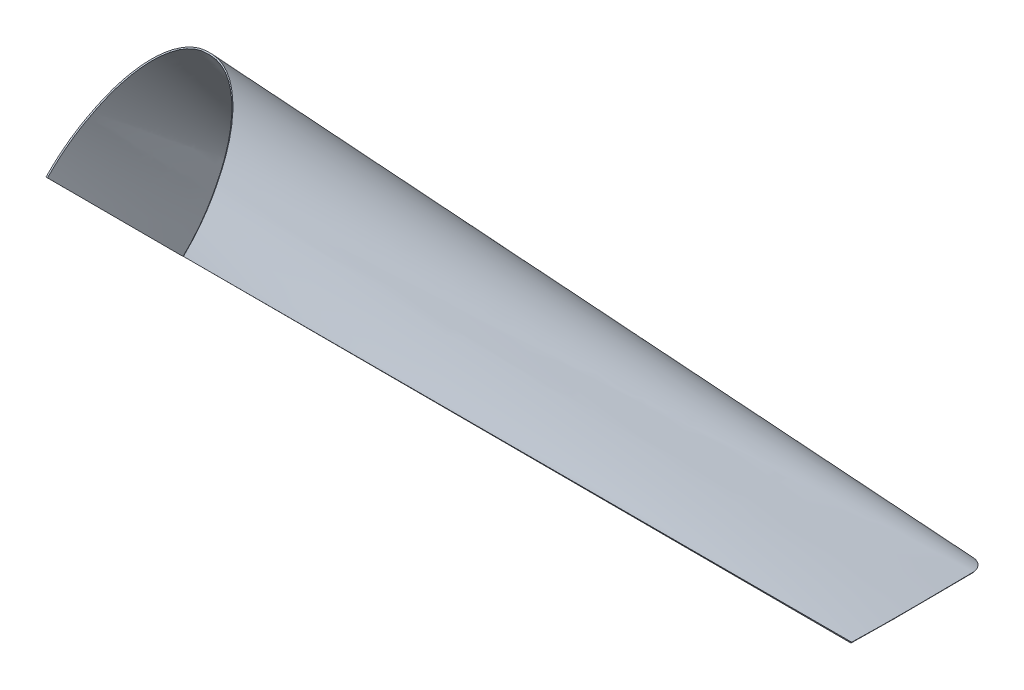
ISO-10303-21;
HEADER;
FILE_DESCRIPTION(('STEP AP214'),'2;1');
FILE_NAME('part.step','',(''),(''),'','','');
FILE_SCHEMA(('AUTOMOTIVE_DESIGN { 1 0 10303 214 1 1 1 1 }'));
ENDSEC;
DATA;
#1=APPLICATION_CONTEXT('core data for automotive mechanical design processes');
#2=APPLICATION_PROTOCOL_DEFINITION('international standard','automotive_design',2000,#1);
#3=PRODUCT_CONTEXT('',#1,'mechanical');
#4=PRODUCT('Part','Part','',(#3));
#5=PRODUCT_RELATED_PRODUCT_CATEGORY('part','',(#4));
#6=PRODUCT_DEFINITION_FORMATION('','',#4);
#7=PRODUCT_DEFINITION_CONTEXT('part definition',#1,'design');
#8=PRODUCT_DEFINITION('design','',#6,#7);
#9=PRODUCT_DEFINITION_SHAPE('','',#8);
#10=(LENGTH_UNIT() NAMED_UNIT(*) SI_UNIT(.MILLI.,.METRE.));
#11=(NAMED_UNIT(*) PLANE_ANGLE_UNIT() SI_UNIT($,.RADIAN.));
#12=(NAMED_UNIT(*) SI_UNIT($,.STERADIAN.) SOLID_ANGLE_UNIT());
#13=UNCERTAINTY_MEASURE_WITH_UNIT(LENGTH_MEASURE(1.E-05),#10,'distance_accuracy_value','');
#14=(GEOMETRIC_REPRESENTATION_CONTEXT(3) GLOBAL_UNCERTAINTY_ASSIGNED_CONTEXT((#13)) GLOBAL_UNIT_ASSIGNED_CONTEXT((#10,
#11,#12)) REPRESENTATION_CONTEXT('',''));
#15=CARTESIAN_POINT('',(0.,0.,0.));
#16=DIRECTION('',(0.,0.,1.));
#17=DIRECTION('',(1.,0.,0.));
#18=AXIS2_PLACEMENT_3D('',#15,#16,#17);
#19=CARTESIAN_POINT('',(-220.305596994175,129.515122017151,129.478908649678));
#20=CARTESIAN_POINT('',(-220.633740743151,137.547874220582,121.185789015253));
#21=CARTESIAN_POINT('',(-219.002450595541,146.345615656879,113.733528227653));
#22=CARTESIAN_POINT('',(-215.303462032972,155.974075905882,107.151210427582));
#23=CARTESIAN_POINT('',(-215.078648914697,156.541488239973,106.76892565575));
#24=CARTESIAN_POINT('',(-214.788634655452,157.251891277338,106.297334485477));
#25=CARTESIAN_POINT('',(-214.730181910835,157.394028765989,106.203329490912));
#26=CARTESIAN_POINT('',(-214.61237748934,157.678413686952,106.015949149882));
#27=CARTESIAN_POINT('',(-214.552761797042,157.821264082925,105.92219611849));
#28=CARTESIAN_POINT('',(-214.374889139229,158.244653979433,105.645109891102));
#29=CARTESIAN_POINT('',(-214.258695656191,158.517552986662,105.467605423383));
#30=CARTESIAN_POINT('',(-214.114134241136,158.853504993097,105.250908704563));
#31=CARTESIAN_POINT('',(-214.070888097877,158.953282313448,105.186906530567));
#32=CARTESIAN_POINT('',(-213.999045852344,159.117757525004,105.082703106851));
#33=CARTESIAN_POINT('',(-213.969473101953,159.184655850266,105.039287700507));
#34=CARTESIAN_POINT('',(-213.900542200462,159.341400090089,104.938407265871));
#35=CARTESIAN_POINT('',(-213.878386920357,159.391744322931,104.905889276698));
#36=CARTESIAN_POINT('',(-213.855353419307,159.444053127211,104.871999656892));
#37=CARTESIAN_POINT('',(-213.849307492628,159.457776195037,104.863085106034));
#38=CARTESIAN_POINT('',(-213.836671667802,159.486460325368,104.844462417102));
#39=CARTESIAN_POINT('',(-213.830353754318,159.500802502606,104.835151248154));
#40=CARTESIAN_POINT('',(-213.811400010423,159.54382936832,104.80721826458));
#41=CARTESIAN_POINT('',(-213.798764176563,159.572514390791,104.78859697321));
#42=CARTESIAN_POINT('',(-213.685041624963,159.830683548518,104.62101155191));
#43=CARTESIAN_POINT('',(-213.583954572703,160.060195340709,104.472090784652));
#44=CARTESIAN_POINT('',(-213.280691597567,160.748806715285,104.02544825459));
#45=CARTESIAN_POINT('',(-213.078513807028,161.207982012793,103.72784585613));
#46=CARTESIAN_POINT('',(-212.825786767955,161.782054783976,103.356007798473));
#47=CARTESIAN_POINT('',(-212.775241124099,161.896874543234,103.281648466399));
#48=CARTESIAN_POINT('',(-212.699422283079,162.069111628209,103.170121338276));
#49=CARTESIAN_POINT('',(-212.674149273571,162.126525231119,103.132947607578));
#50=CARTESIAN_POINT('',(-212.636239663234,162.212647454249,103.077189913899));
#51=CARTESIAN_POINT('',(-212.623603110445,162.241355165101,103.058604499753));
#52=CARTESIAN_POINT('',(-212.604648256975,162.284417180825,103.03072709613));
#53=CARTESIAN_POINT('',(-212.598329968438,162.298771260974,103.021434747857));
#54=CARTESIAN_POINT('',(-212.588852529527,162.320302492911,103.007496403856));
#55=CARTESIAN_POINT('',(-212.585773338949,162.327297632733,103.002966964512));
#56=CARTESIAN_POINT('',(-212.579232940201,162.342157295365,102.993350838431));
#57=CARTESIAN_POINT('',(-212.575566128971,162.350489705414,102.987964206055));
#58=CARTESIAN_POINT('',(-212.548166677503,162.412781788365,102.947806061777));
#59=CARTESIAN_POINT('',(-212.4972378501,162.528631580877,102.873359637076));
#60=CARTESIAN_POINT('',(-212.305321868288,162.965317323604,102.593214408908));
#61=CARTESIAN_POINT('',(-212.282128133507,163.018092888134,102.559359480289));
#62=CARTESIAN_POINT('',(-212.231647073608,163.13295972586,102.485677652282));
#63=CARTESIAN_POINT('',(-212.205549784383,163.192281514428,102.448306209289));
#64=CARTESIAN_POINT('',(-212.122054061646,163.380202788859,102.329640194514));
#65=CARTESIAN_POINT('',(-212.060455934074,163.517128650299,102.243625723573));
#66=CARTESIAN_POINT('',(-211.860299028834,163.95729536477,101.96858942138));
#67=CARTESIAN_POINT('',(-211.706385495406,164.289908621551,101.762590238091));
#68=CARTESIAN_POINT('',(-211.201535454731,165.363808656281,101.103712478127));
#69=CARTESIAN_POINT('',(-210.807506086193,166.181099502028,100.609976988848));
#70=CARTESIAN_POINT('',(-209.999638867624,167.803694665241,99.6521240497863));
#71=CARTESIAN_POINT('',(-209.583863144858,168.613120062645,99.184932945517));
#72=CARTESIAN_POINT('',(-207.447181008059,172.649576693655,96.9078326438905));
#73=CARTESIAN_POINT('',(-205.552853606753,175.844588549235,95.2744917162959));
#74=CARTESIAN_POINT('',(-199.369206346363,185.277063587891,90.9462908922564));
#75=CARTESIAN_POINT('',(-194.579128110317,191.361759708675,88.82340869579));
#76=CARTESIAN_POINT('',(-183.956018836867,202.860401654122,86.136967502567));
#77=CARTESIAN_POINT('',(-178.123359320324,208.27427206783,85.5736697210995));
#78=CARTESIAN_POINT('',(-165.706748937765,218.175422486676,86.0326388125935));
#79=CARTESIAN_POINT('',(-159.123607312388,222.663254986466,87.0547104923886));
#80=CARTESIAN_POINT('',(-148.889568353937,228.510779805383,89.7872355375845));
#81=CARTESIAN_POINT('',(-145.418056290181,230.312539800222,90.8978969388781));
#82=CARTESIAN_POINT('',(-141.682083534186,232.052494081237,92.2915152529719));
#83=CARTESIAN_POINT('',(-141.462145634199,232.154202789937,92.3742781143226));
#84=CARTESIAN_POINT('',(-141.021927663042,232.356328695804,92.5413752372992));
#85=CARTESIAN_POINT('',(-140.801291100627,232.456667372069,92.6256479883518));
#86=CARTESIAN_POINT('',(-140.1486505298,232.751335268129,92.8764939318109));
#87=CARTESIAN_POINT('',(-139.725899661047,232.939309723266,93.0410965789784));
#88=CARTESIAN_POINT('',(-138.962965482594,233.276117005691,93.3427917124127));
#89=CARTESIAN_POINT('',(-138.622417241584,233.424840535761,93.4798395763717));
#90=CARTESIAN_POINT('',(-138.287038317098,233.573181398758,93.6202987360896));
#91=CARTESIAN_POINT('',(-138.224510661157,233.600981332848,93.6468517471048));
#92=CARTESIAN_POINT('',(-138.138493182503,233.639703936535,93.6841401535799));
#93=CARTESIAN_POINT('',(-138.111118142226,233.652115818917,93.696146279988));
#94=CARTESIAN_POINT('',(-138.072148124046,233.669977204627,93.7134937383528));
#95=CARTESIAN_POINT('',(-138.060112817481,233.675965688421,93.7192438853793));
#96=CARTESIAN_POINT('',(-138.033471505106,233.686796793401,93.730084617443));
#97=CARTESIAN_POINT('',(-138.020353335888,233.692129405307,93.7354221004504));
#98=CARTESIAN_POINT('',(-137.904080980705,233.739389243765,93.7827262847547));
#99=CARTESIAN_POINT('',(-137.813464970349,233.776180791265,93.8195608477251));
#100=CARTESIAN_POINT('',(-137.415191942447,233.937692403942,93.9813021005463));
#101=CARTESIAN_POINT('',(-137.271957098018,233.995075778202,94.0389151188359));
#102=CARTESIAN_POINT('',(-137.149694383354,234.043281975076,94.0874751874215));
#103=CARTESIAN_POINT('',(-137.124371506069,234.053038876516,94.0973517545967));
#104=CARTESIAN_POINT('',(-137.076170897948,234.0715690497,94.1161166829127));
#105=CARTESIAN_POINT('',(-137.052274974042,234.080759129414,94.1254216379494));
#106=CARTESIAN_POINT('',(-136.260703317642,234.385537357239,94.4339102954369));
#107=CARTESIAN_POINT('',(-135.497145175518,234.687070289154,94.7369232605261));
#108=CARTESIAN_POINT('',(-133.972342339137,235.293291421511,95.3454606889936));
#109=CARTESIAN_POINT('',(-133.211312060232,235.598331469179,95.6511585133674));
#110=CARTESIAN_POINT('',(-132.427096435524,235.913711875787,95.9670635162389));
#111=CARTESIAN_POINT('',(-132.403332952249,235.923269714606,95.9766370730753));
#112=CARTESIAN_POINT('',(-132.367688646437,235.937607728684,95.9909984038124));
#113=CARTESIAN_POINT('',(-132.355807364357,235.942387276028,95.995785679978));
#114=CARTESIAN_POINT('',(-132.332045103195,235.951946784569,96.005360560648));
#115=CARTESIAN_POINT('',(-132.320671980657,235.956519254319,96.0099406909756));
#116=CARTESIAN_POINT('',(-132.252554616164,235.983979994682,96.0374391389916));
#117=CARTESIAN_POINT('',(-132.158713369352,236.022029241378,96.0755164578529));
#118=CARTESIAN_POINT('',(-131.714552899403,236.203133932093,96.2566450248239));
#119=CARTESIAN_POINT('',(-131.60937784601,236.246032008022,96.299547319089));
#120=CARTESIAN_POINT('',(-131.453141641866,236.309773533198,96.3632932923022));
#121=CARTESIAN_POINT('',(-131.420742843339,236.322895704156,96.3764004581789));
#122=CARTESIAN_POINT('',(-131.355537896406,236.348713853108,96.4024506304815));
#123=CARTESIAN_POINT('',(-131.322107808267,236.361932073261,96.4158735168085));
#124=CARTESIAN_POINT('',(-131.21943717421,236.402463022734,96.4572872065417));
#125=CARTESIAN_POINT('',(-131.147817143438,236.430651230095,96.4864223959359));
#126=CARTESIAN_POINT('',(-130.775147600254,236.576813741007,96.63913487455));
#127=CARTESIAN_POINT('',(-130.430494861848,236.710357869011,96.7837434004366));
#128=CARTESIAN_POINT('',(-129.302679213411,237.140846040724,97.2650624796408));
#129=CARTESIAN_POINT('',(-128.425504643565,237.467775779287,97.6493969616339));
#130=CARTESIAN_POINT('',(-127.096640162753,237.945310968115,98.2476431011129));
#131=CARTESIAN_POINT('',(-126.653362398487,238.101622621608,98.4499455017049));
#132=CARTESIAN_POINT('',(-125.769194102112,238.407635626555,98.8594359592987));
#133=CARTESIAN_POINT('',(-125.327845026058,238.557478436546,99.0667569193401));
#134=CARTESIAN_POINT('',(-124.006104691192,238.997529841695,99.6963514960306));
#135=CARTESIAN_POINT('',(-123.128020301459,239.278261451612,100.126256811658));
#136=CARTESIAN_POINT('',(-120.503808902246,240.082659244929,101.445735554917));
#137=CARTESIAN_POINT('',(-118.767723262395,240.568528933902,102.36507190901));
#138=CARTESIAN_POINT('',(-110.165118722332,242.74734349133,107.149981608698));
#139=CARTESIAN_POINT('',(-103.531960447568,243.688776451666,111.580320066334));
#140=CARTESIAN_POINT('',(-84.7999152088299,244.160725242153,126.285593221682));
#141=CARTESIAN_POINT('',(-73.8686028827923,241.338289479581,137.974879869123));
#142=CARTESIAN_POINT('',(-63.562148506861,234.062262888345,153.623197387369));
#143=CARTESIAN_POINT('',(-61.6687401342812,232.419678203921,156.804696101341));
#144=CARTESIAN_POINT('',(-59.5338669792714,230.134932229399,160.825796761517));
#145=CARTESIAN_POINT('',(-59.1184866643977,229.666407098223,161.632228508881));
#146=CARTESIAN_POINT('',(-58.5132207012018,228.946305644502,162.844808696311));
#147=CARTESIAN_POINT('',(-58.3141184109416,228.702915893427,163.250195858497));
#148=CARTESIAN_POINT('',(-57.9233054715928,228.212457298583,164.058776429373));
#149=CARTESIAN_POINT('',(-57.733037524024,227.96748784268,164.458701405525));
#150=CARTESIAN_POINT('',(-57.3860480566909,227.511820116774,165.196911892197));
#151=CARTESIAN_POINT('',(-57.2292804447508,227.301052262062,165.535314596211));
#152=CARTESIAN_POINT('',(-57.0370351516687,227.036449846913,165.956192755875));
#153=CARTESIAN_POINT('',(-56.9801008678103,226.956833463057,166.082041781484));
#154=CARTESIAN_POINT('',(-56.9199595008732,226.871138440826,166.216432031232));
#155=CARTESIAN_POINT('',(-56.9084842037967,226.854693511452,166.242159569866));
#156=CARTESIAN_POINT('',(-56.886701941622,226.823286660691,166.291164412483));
#157=CARTESIAN_POINT('',(-56.8765535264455,226.80852485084,166.314095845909));
#158=CARTESIAN_POINT('',(-56.8456363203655,226.763422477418,166.384411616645));
#159=CARTESIAN_POINT('',(-56.8263378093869,226.735270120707,166.428300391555));
#160=CARTESIAN_POINT('',(-56.6636521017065,226.497951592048,166.798260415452));
#161=CARTESIAN_POINT('',(-56.5972711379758,226.401154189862,166.949059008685));
#162=CARTESIAN_POINT('',(-56.5454321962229,226.325610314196,167.066613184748));
#163=CARTESIAN_POINT('',(-56.5361079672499,226.312037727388,167.087690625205));
#164=CARTESIAN_POINT('',(-56.5217686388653,226.291180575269,167.120037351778));
#165=CARTESIAN_POINT('',(-56.5159022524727,226.282653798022,167.133244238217));
#166=CARTESIAN_POINT('',(-56.4967938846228,226.25487130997,167.176299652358));
#167=CARTESIAN_POINT('',(-56.4840548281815,226.236349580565,167.205003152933));
#168=CARTESIAN_POINT('',(-56.4458372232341,226.180784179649,167.291113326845));
#169=CARTESIAN_POINT('',(-56.4203582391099,226.143740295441,167.348519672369));
#170=CARTESIAN_POINT('',(-56.3439195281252,226.032607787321,167.520737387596));
#171=CARTESIAN_POINT('',(-56.2929580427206,225.958518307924,167.635547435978));
#172=CARTESIAN_POINT('',(-56.0381386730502,225.588065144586,168.209588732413));
#173=CARTESIAN_POINT('',(-55.8342449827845,225.291684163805,168.668793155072));
#174=CARTESIAN_POINT('',(-55.5283426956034,224.847083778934,169.35755411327));
#175=CARTESIAN_POINT('',(-55.4263649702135,224.698878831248,169.5871334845));
#176=CARTESIAN_POINT('',(-55.2988794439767,224.51361649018,169.874097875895));
#177=CARTESIAN_POINT('',(-55.2734498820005,224.47666323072,169.931335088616));
#178=CARTESIAN_POINT('',(-55.235098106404,224.420931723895,170.017659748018));
#179=CARTESIAN_POINT('',(-55.2213019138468,224.400877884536,170.04873694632));
#180=CARTESIAN_POINT('',(-55.1658915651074,224.320130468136,170.174404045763));
#181=CARTESIAN_POINT('',(-55.1529012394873,224.301196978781,170.203878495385));
#182=CARTESIAN_POINT('',(-55.1221815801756,224.256416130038,170.273608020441));
#183=CARTESIAN_POINT('',(-55.1040166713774,224.230003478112,170.314808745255));
#184=CARTESIAN_POINT('',(-55.0456105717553,224.144676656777,170.446866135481));
#185=CARTESIAN_POINT('',(-55.0002328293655,224.077386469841,170.550712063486));
#186=CARTESIAN_POINT('',(-54.8510430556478,223.853508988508,170.894999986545));
#187=CARTESIAN_POINT('',(-54.7341447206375,223.674868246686,171.168280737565));
#188=CARTESIAN_POINT('',(-54.5559090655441,223.396941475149,171.590372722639));
#189=CARTESIAN_POINT('',(-54.4962588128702,223.303000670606,171.73252915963));
#190=CARTESIAN_POINT('',(-54.3783249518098,223.115175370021,172.015680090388));
#191=CARTESIAN_POINT('',(-54.3198067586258,223.020950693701,172.157201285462));
#192=CARTESIAN_POINT('',(-54.0294615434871,222.548275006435,172.864526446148));
#193=CARTESIAN_POINT('',(-53.8043717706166,222.165167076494,173.429487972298));
#194=CARTESIAN_POINT('',(-50.1004640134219,215.569589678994,183.016497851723));
#195=CARTESIAN_POINT('',(-48.4608235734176,208.115922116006,191.778579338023));
#196=CARTESIAN_POINT('',(-48.7766924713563,199.827074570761,199.782455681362));
#197=CARTESIAN_POINT('',(-221.293229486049,129.606391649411,129.606391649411));
#198=CARTESIAN_POINT('',(-221.625182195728,137.705459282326,121.236285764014));
#199=CARTESIAN_POINT('',(-219.981549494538,146.573622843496,113.710142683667));
#200=CARTESIAN_POINT('',(-216.250889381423,156.278223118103,107.051613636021));
#201=CARTESIAN_POINT('',(-216.024143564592,156.850119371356,106.66485456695));
#202=CARTESIAN_POINT('',(-215.731625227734,157.566132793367,106.187681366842));
#203=CARTESIAN_POINT('',(-215.672667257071,157.709392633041,106.092560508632));
#204=CARTESIAN_POINT('',(-215.553843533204,157.996022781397,105.902949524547));
#205=CARTESIAN_POINT('',(-215.493704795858,158.140014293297,105.808061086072));
#206=CARTESIAN_POINT('',(-215.314433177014,158.566448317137,105.528001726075));
#207=CARTESIAN_POINT('',(-215.197476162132,158.841003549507,105.348941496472));
#208=CARTESIAN_POINT('',(-215.051381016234,159.180185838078,105.129045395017));
#209=CARTESIAN_POINT('',(-215.007572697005,159.281138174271,105.06386240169));
#210=CARTESIAN_POINT('',(-214.93398689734,159.44915109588,104.955932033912));
#211=CARTESIAN_POINT('',(-214.904876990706,159.515173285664,104.913677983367));
#212=CARTESIAN_POINT('',(-214.835924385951,159.672081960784,104.813068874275));
#213=CARTESIAN_POINT('',(-214.813755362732,159.722529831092,104.780721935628));
#214=CARTESIAN_POINT('',(-214.790701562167,159.774991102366,104.747084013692));
#215=CARTESIAN_POINT('',(-214.784648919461,159.788764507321,104.738252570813));
#216=CARTESIAN_POINT('',(-214.771999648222,159.817549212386,104.719795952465));
#217=CARTESIAN_POINT('',(-214.765675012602,159.831941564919,104.710567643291));
#218=CARTESIAN_POINT('',(-214.746701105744,159.875118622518,104.68288271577));
#219=CARTESIAN_POINT('',(-214.734051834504,159.903903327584,104.664426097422));
#220=CARTESIAN_POINT('',(-214.620208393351,160.162965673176,104.498316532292));
#221=CARTESIAN_POINT('',(-214.519014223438,160.393243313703,104.35066358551));
#222=CARTESIAN_POINT('',(-214.215431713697,161.084076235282,103.907704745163));
#223=CARTESIAN_POINT('',(-214.013043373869,161.544631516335,103.612398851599));
#224=CARTESIAN_POINT('',(-213.760057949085,162.120325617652,103.243266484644));
#225=CARTESIAN_POINT('',(-213.709460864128,162.235464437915,103.169440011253));
#226=CARTESIAN_POINT('',(-213.633565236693,162.40817266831,103.058700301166));
#227=CARTESIAN_POINT('',(-213.608266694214,162.465742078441,103.02178706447));
#228=CARTESIAN_POINT('',(-213.570318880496,162.552096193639,102.966417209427));
#229=CARTESIAN_POINT('',(-213.557669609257,162.580880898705,102.947960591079));
#230=CARTESIAN_POINT('',(-213.538695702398,162.624057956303,102.920275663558));
#231=CARTESIAN_POINT('',(-213.532371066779,162.638450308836,102.911047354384));
#232=CARTESIAN_POINT('',(-213.522884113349,162.660038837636,102.897204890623));
#233=CARTESIAN_POINT('',(-213.519801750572,162.667053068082,102.892707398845));
#234=CARTESIAN_POINT('',(-213.51325501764,162.68195082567,102.883155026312));
#235=CARTESIAN_POINT('',(-213.509585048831,162.690302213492,102.877800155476));
#236=CARTESIAN_POINT('',(-213.482170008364,162.752687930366,102.837798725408));
#237=CARTESIAN_POINT('',(-213.431229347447,162.868608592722,102.763470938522));
#238=CARTESIAN_POINT('',(-213.239302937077,163.305356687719,102.483430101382));
#239=CARTESIAN_POINT('',(-213.216108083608,163.358138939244,102.449586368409));
#240=CARTESIAN_POINT('',(-213.165624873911,163.473018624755,102.37592605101));
#241=CARTESIAN_POINT('',(-213.138578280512,163.5343376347,102.336690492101));
#242=CARTESIAN_POINT('',(-213.053467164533,163.725622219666,102.214898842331));
#243=CARTESIAN_POINT('',(-212.990955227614,163.864417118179,102.12714472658));
#244=CARTESIAN_POINT('',(-212.788294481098,164.309654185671,101.847379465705));
#245=CARTESIAN_POINT('',(-212.633020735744,164.644948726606,101.63886540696));
#246=CARTESIAN_POINT('',(-212.12420890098,165.726536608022,100.972720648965));
#247=CARTESIAN_POINT('',(-211.727717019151,166.548450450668,100.474541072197));
#248=CARTESIAN_POINT('',(-210.913324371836,168.182734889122,99.5052054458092));
#249=CARTESIAN_POINT('',(-210.49417219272,168.997953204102,99.0322234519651));
#250=CARTESIAN_POINT('',(-208.340018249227,173.063118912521,96.7259170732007));
#251=CARTESIAN_POINT('',(-206.429837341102,176.28028870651,95.0684034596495));
#252=CARTESIAN_POINT('',(-200.191952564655,185.776746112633,90.6651576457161));
#253=CARTESIAN_POINT('',(-195.356906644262,191.900981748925,88.488720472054));
#254=CARTESIAN_POINT('',(-184.617802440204,203.468441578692,85.6897025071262));
#255=CARTESIAN_POINT('',(-178.713744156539,208.911665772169,85.0671217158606));
#256=CARTESIAN_POINT('',(-166.120515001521,218.849563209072,85.4115528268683));
#257=CARTESIAN_POINT('',(-159.431344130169,223.3442364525,86.3785647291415));
#258=CARTESIAN_POINT('',(-149.021678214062,229.174178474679,89.048079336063));
#259=CARTESIAN_POINT('',(-145.489137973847,230.965481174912,90.1410836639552));
#260=CARTESIAN_POINT('',(-141.688099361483,232.68946198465,91.520637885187));
#261=CARTESIAN_POINT('',(-141.464333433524,232.790213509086,91.6025904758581));
#262=CARTESIAN_POINT('',(-141.016459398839,232.990390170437,91.7681014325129));
#263=CARTESIAN_POINT('',(-140.792331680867,233.089823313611,91.8516678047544));
#264=CARTESIAN_POINT('',(-140.129802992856,233.381893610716,92.1005499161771));
#265=CARTESIAN_POINT('',(-139.701256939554,233.56830144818,92.2640484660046));
#266=CARTESIAN_POINT('',(-138.926058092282,233.901764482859,92.5635326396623));
#267=CARTESIAN_POINT('',(-138.579405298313,234.048819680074,92.6995182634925));
#268=CARTESIAN_POINT('',(-138.232031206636,234.193829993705,92.838137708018));
#269=CARTESIAN_POINT('',(-138.166853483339,234.220891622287,92.86429346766));
#270=CARTESIAN_POINT('',(-138.076184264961,234.258306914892,92.9009092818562));
#271=CARTESIAN_POINT('',(-138.047144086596,234.270249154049,92.9126782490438));
#272=CARTESIAN_POINT('',(-138.00543962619,234.287334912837,92.9296440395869));
#273=CARTESIAN_POINT('',(-137.991872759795,234.292879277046,92.9351769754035));
#274=CARTESIAN_POINT('',(-137.965256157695,234.303745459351,92.9460431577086));
#275=CARTESIAN_POINT('',(-137.952150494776,234.309095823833,92.9513935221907));
#276=CARTESIAN_POINT('',(-137.835992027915,234.356517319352,92.9988150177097));
#277=CARTESIAN_POINT('',(-137.745486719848,234.393465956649,93.0357636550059));
#278=CARTESIAN_POINT('',(-137.347806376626,234.55581827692,93.1981159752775));
#279=CARTESIAN_POINT('',(-137.205169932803,234.614049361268,93.2563470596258));
#280=CARTESIAN_POINT('',(-137.083844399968,234.663580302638,93.3058780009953));
#281=CARTESIAN_POINT('',(-137.058840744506,234.673788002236,93.3160857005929));
#282=CARTESIAN_POINT('',(-137.011271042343,234.693208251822,93.335505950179));
#283=CARTESIAN_POINT('',(-136.987686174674,234.702836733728,93.3451344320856));
#284=CARTESIAN_POINT('',(-136.206233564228,235.021863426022,93.664161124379));
#285=CARTESIAN_POINT('',(-135.448461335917,235.331222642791,93.9735203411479));
#286=CARTESIAN_POINT('',(-133.932916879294,235.949941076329,94.5922387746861));
#287=CARTESIAN_POINT('',(-133.175144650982,236.259300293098,94.9015979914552));
#288=CARTESIAN_POINT('',(-132.393692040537,236.578326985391,95.2206246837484));
#289=CARTESIAN_POINT('',(-132.370011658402,236.587994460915,95.2302921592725));
#290=CARTESIAN_POINT('',(-132.3344910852,236.602495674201,95.2447933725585));
#291=CARTESIAN_POINT('',(-132.322650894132,236.607329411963,95.2496271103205));
#292=CARTESIAN_POINT('',(-132.298970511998,236.616996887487,95.2592945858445));
#293=CARTESIAN_POINT('',(-132.287638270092,236.621623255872,95.2639209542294));
#294=CARTESIAN_POINT('',(-132.219722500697,236.649349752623,95.2916474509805));
#295=CARTESIAN_POINT('',(-132.126032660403,236.687598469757,95.3298961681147));
#296=CARTESIAN_POINT('',(-131.682001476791,236.868873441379,95.5111711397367));
#297=CARTESIAN_POINT('',(-131.576849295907,236.911801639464,95.5540993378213));
#298=CARTESIAN_POINT('',(-131.420637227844,236.9755749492,95.6178726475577));
#299=CARTESIAN_POINT('',(-131.388004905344,236.988911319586,95.6311804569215));
#300=CARTESIAN_POINT('',(-131.321286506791,237.016069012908,95.6584981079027));
#301=CARTESIAN_POINT('',(-131.287135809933,237.029924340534,95.6725267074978));
#302=CARTESIAN_POINT('',(-131.182392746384,237.072285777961,95.7156876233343));
#303=CARTESIAN_POINT('',(-131.109509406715,237.101587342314,95.7458950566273));
#304=CARTESIAN_POINT('',(-130.730933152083,237.252945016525,95.9036435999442));
#305=CARTESIAN_POINT('',(-130.38276156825,237.389550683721,96.0513188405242));
#306=CARTESIAN_POINT('',(-129.245077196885,237.828524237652,96.5412606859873));
#307=CARTESIAN_POINT('',(-128.362394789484,238.160048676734,96.9304434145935));
#308=CARTESIAN_POINT('',(-127.023080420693,238.646040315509,97.5379973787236));
#309=CARTESIAN_POINT('',(-126.576028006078,238.805365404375,97.7436890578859));
#310=CARTESIAN_POINT('',(-125.684542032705,239.117137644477,98.1598120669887));
#311=CARTESIAN_POINT('',(-125.239535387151,239.269818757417,98.3704773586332));
#312=CARTESIAN_POINT('',(-123.906828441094,239.718260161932,99.0101866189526));
#313=CARTESIAN_POINT('',(-123.021441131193,240.004418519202,99.4469439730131));
#314=CARTESIAN_POINT('',(-120.375362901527,240.824590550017,100.787285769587));
#315=CARTESIAN_POINT('',(-118.624755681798,241.320301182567,101.720939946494));
#316=CARTESIAN_POINT('',(-109.950034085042,243.544896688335,106.579224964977));
#317=CARTESIAN_POINT('',(-103.26086321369,244.511908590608,111.073898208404));
#318=CARTESIAN_POINT('',(-84.3710194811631,245.02855525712,125.98074436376));
#319=CARTESIAN_POINT('',(-73.3480155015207,242.19380098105,137.815743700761));
#320=CARTESIAN_POINT('',(-62.9515408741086,234.855057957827,153.643172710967));
#321=CARTESIAN_POINT('',(-61.0413599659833,233.197544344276,156.860342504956));
#322=CARTESIAN_POINT('',(-58.8872060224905,230.891237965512,160.925508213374));
#323=CARTESIAN_POINT('',(-58.4680538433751,230.418255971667,161.740726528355));
#324=CARTESIAN_POINT('',(-57.8572593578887,229.691254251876,162.966439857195));
#325=CARTESIAN_POINT('',(-57.6562507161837,229.445416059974,163.376400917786));
#326=CARTESIAN_POINT('',(-57.2620926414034,228.950549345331,164.193096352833));
#327=CARTESIAN_POINT('',(-57.0704330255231,228.703694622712,164.596440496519));
#328=CARTESIAN_POINT('',(-56.7206849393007,228.24421886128,165.341484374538));
#329=CARTESIAN_POINT('',(-56.5625964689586,228.031597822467,165.68318410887));
#330=CARTESIAN_POINT('',(-56.3676913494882,227.763148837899,166.110772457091));
#331=CARTESIAN_POINT('',(-56.3097609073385,227.682079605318,166.239141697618));
#332=CARTESIAN_POINT('',(-56.2479212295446,227.593844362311,166.37786882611));
#333=CARTESIAN_POINT('',(-56.2360819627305,227.576852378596,166.4045275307));
#334=CARTESIAN_POINT('',(-56.2135051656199,227.544243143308,166.455570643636));
#335=CARTESIAN_POINT('',(-56.2028463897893,227.528702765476,166.47981387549));
#336=CARTESIAN_POINT('',(-56.1719415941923,227.483609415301,166.550140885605));
#337=CARTESIAN_POINT('',(-56.1526515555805,227.455463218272,166.594037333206));
#338=CARTESIAN_POINT('',(-55.9900437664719,227.218201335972,166.964067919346));
#339=CARTESIAN_POINT('',(-55.9237439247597,227.121462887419,167.114939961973));
#340=CARTESIAN_POINT('',(-55.8720340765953,227.046012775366,167.232610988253));
#341=CARTESIAN_POINT('',(-55.8627541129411,227.032472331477,167.253728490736));
#342=CARTESIAN_POINT('',(-55.8485040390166,227.011679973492,167.286155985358));
#343=CARTESIAN_POINT('',(-55.8426825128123,227.003185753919,167.299403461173));
#344=CARTESIAN_POINT('',(-55.8237086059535,226.975500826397,167.342580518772));
#345=CARTESIAN_POINT('',(-55.8110593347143,226.957044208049,167.371365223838));
#346=CARTESIAN_POINT('',(-55.7731115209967,226.901674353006,167.457719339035));
#347=CARTESIAN_POINT('',(-55.7478129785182,226.864761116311,167.515288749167));
#348=CARTESIAN_POINT('',(-55.6719173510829,226.754021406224,167.687996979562));
#349=CARTESIAN_POINT('',(-55.6213202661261,226.680194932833,167.803135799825));
#350=CARTESIAN_POINT('',(-55.3683348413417,226.311062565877,168.378829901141));
#351=CARTESIAN_POINT('',(-55.1659465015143,226.015756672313,168.839385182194));
#352=CARTESIAN_POINT('',(-54.8623639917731,225.572797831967,169.530218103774));
#353=CARTESIAN_POINT('',(-54.7611698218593,225.425144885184,169.760495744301));
#354=CARTESIAN_POINT('',(-54.6346771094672,225.240578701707,170.048342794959));
#355=CARTESIAN_POINT('',(-54.6094467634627,225.203764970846,170.105757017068));
#356=CARTESIAN_POINT('',(-54.571394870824,225.1482432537,170.192347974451));
#357=CARTESIAN_POINT('',(-54.5576990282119,225.128259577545,170.223514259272));
#358=CARTESIAN_POINT('',(-54.502422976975,225.047605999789,170.34930054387));
#359=CARTESIAN_POINT('',(-54.489459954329,225.02869158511,170.378799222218));
#360=CARTESIAN_POINT('',(-54.4587959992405,224.98394964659,170.448578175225));
#361=CARTESIAN_POINT('',(-54.4407003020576,224.957626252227,170.489676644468));
#362=CARTESIAN_POINT('',(-54.3811370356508,224.870296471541,170.625639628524));
#363=CARTESIAN_POINT('',(-54.335242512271,224.802069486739,170.731339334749));
#364=CARTESIAN_POINT('',(-54.1846696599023,224.575639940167,171.08071110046));
#365=CARTESIAN_POINT('',(-54.0671020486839,224.39568878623,171.356655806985));
#366=CARTESIAN_POINT('',(-53.8876430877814,224.115356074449,171.78351614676));
#367=CARTESIAN_POINT('',(-53.8275346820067,224.020511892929,171.927438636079));
#368=CARTESIAN_POINT('',(-53.7087109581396,223.830900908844,172.214068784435));
#369=CARTESIAN_POINT('',(-53.6497529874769,223.735780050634,172.35732862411));
#370=CARTESIAN_POINT('',(-53.3572346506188,223.258606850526,173.073342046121));
#371=CARTESIAN_POINT('',(-53.1304888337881,222.871847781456,173.645238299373));
#372=CARTESIAN_POINT('',(-49.3998287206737,216.213318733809,183.34983857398));
#373=CARTESIAN_POINT('',(-47.7561960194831,208.687175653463,192.218002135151));
#374=CARTESIAN_POINT('',(-48.0881487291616,200.317069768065,200.317069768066));
#375=B_SPLINE_SURFACE_WITH_KNOTS('',1,3,((#19,#20,#21,#22,#23,#24,#25,#26,#27,#28,#29,#30,#31,
#32,#33,#34,#35,#36,#37,#38,#39,#40,#41,#42,#43,#44,#45,#46,#47,#48,#49,#50,#51,#52,#53,#54,#55,
#56,#57,#58,#59,#60,#61,#62,#63,#64,#65,#66,#67,#68,#69,#70,#71,#72,#73,#74,#75,#76,#77,#78,#79,
#80,#81,#82,#83,#84,#85,#86,#87,#88,#89,#90,#91,#92,#93,#94,#95,#96,#97,#98,#99,#100,#101,#102,
#103,#104,#105,#106,#107,#108,#109,#110,#111,#112,#113,#114,#115,#116,#117,#118,#119,#120,#121,
#122,#123,#124,#125,#126,#127,#128,#129,#130,#131,#132,#133,#134,#135,#136,#137,#138,#139,#140,
#141,#142,#143,#144,#145,#146,#147,#148,#149,#150,#151,#152,#153,#154,#155,#156,#157,#158,#159,
#160,#161,#162,#163,#164,#165,#166,#167,#168,#169,#170,#171,#172,#173,#174,#175,#176,#177,#178,
#179,#180,#181,#182,#183,#184,#185,#186,#187,#188,#189,#190,#191,#192,#193,#194,#195,#196),
(#197,#198,#199,#200,#201,#202,#203,#204,#205,#206,#207,#208,#209,#210,#211,#212,#213,#214,#215,
#216,#217,#218,#219,#220,#221,#222,#223,#224,#225,#226,#227,#228,#229,#230,#231,#232,#233,#234,
#235,#236,#237,#238,#239,#240,#241,#242,#243,#244,#245,#246,#247,#248,#249,#250,#251,#252,#253,
#254,#255,#256,#257,#258,#259,#260,#261,#262,#263,#264,#265,#266,#267,#268,#269,#270,#271,#272,
#273,#274,#275,#276,#277,#278,#279,#280,#281,#282,#283,#284,#285,#286,#287,#288,#289,#290,#291,
#292,#293,#294,#295,#296,#297,#298,#299,#300,#301,#302,#303,#304,#305,#306,#307,#308,#309,#310,
#311,#312,#313,#314,#315,#316,#317,#318,#319,#320,#321,#322,#323,#324,#325,#326,#327,#328,#329,
#330,#331,#332,#333,#334,#335,#336,#337,#338,#339,#340,#341,#342,#343,#344,#345,#346,#347,#348,
#349,#350,#351,#352,#353,#354,#355,#356,#357,#358,#359,#360,#361,#362,#363,#364,#365,#366,#367,
#368,#369,#370,#371,#372,#373,#374)),.UNSPECIFIED.,.F.,.F.,.F.,(2,2),(4,2,2,2,2,2,2,2,2,2,2,2,2,
2,2,2,2,2,2,2,2,2,2,2,2,2,2,2,2,2,2,2,2,2,2,2,2,2,2,2,2,2,2,2,2,2,2,2,2,2,2,2,2,2,2,2,2,2,2,2,2,
2,2,2,2,2,2,2,2,2,2,2,2,2,2,2,2,2,2,2,2,2,2,2,2,2,2,2,4),(0.,1.),(0.,0.125,0.1328125,
0.134765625,0.13671875,0.140625,0.142578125,0.14453125,0.1484375,0.150390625,0.15234375,0.15625,
0.1875,0.25,0.265625,0.2734375,0.27734375,0.279296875,0.2802734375,0.28125,0.28515625,
0.28564453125,0.2861328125,0.287109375,0.2890625,0.29296875,0.296875,0.3125,0.34375,0.375,
0.40625,0.421875,0.4228515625,0.423828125,0.42578125,0.427734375,0.42822265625,0.428466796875,
0.4285888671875,0.4287109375,0.4296875,0.43359375,0.435546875,0.4375,0.5,0.5625,0.564453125,
0.5654296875,0.56640625,0.5703125,0.5712890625,0.571533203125,0.57177734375,0.572265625,
0.57421875,0.578125,0.580078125,0.58203125,0.5859375,0.59375,0.625,0.6875,0.703125,0.70703125,
0.708984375,0.7109375,0.712890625,0.7138671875,0.714111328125,0.71435546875,0.71484375,0.71875,
0.720703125,0.72265625,0.7265625,0.734375,0.75,0.8125,0.84375,0.8515625,0.85546875,0.8564453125,
0.857421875,0.859375,0.86328125,0.865234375,0.8671875,0.875,1.),.UNSPECIFIED.);
#376=CARTESIAN_POINT('',(-48.0881487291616,200.317069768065,200.317069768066));
#377=CARTESIAN_POINT('',(-48.7766924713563,199.827074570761,199.782455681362));
#378=B_SPLINE_CURVE_WITH_KNOTS('',1,(#376,#377),.UNSPECIFIED.,.F.,.F.,(2,2),(0.,1.),.UNSPECIFIED.);
#379=CARTESIAN_POINT('',(-48.0881487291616,200.317069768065,200.317069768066));
#380=VERTEX_POINT('',#379);
#381=CARTESIAN_POINT('',(-48.7766924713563,199.827074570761,199.782455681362));
#382=VERTEX_POINT('',#381);
#383=EDGE_CURVE('E15',#380,#382,#378,.T.);
#384=CARTESIAN_POINT('',(-48.0881487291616,200.317069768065,200.317069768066));
#385=CARTESIAN_POINT('',(-47.7561960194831,208.687175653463,192.218002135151));
#386=CARTESIAN_POINT('',(-49.3998287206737,216.213318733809,183.34983857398));
#387=CARTESIAN_POINT('',(-53.1304888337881,222.871847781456,173.645238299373));
#388=CARTESIAN_POINT('',(-53.3572346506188,223.258606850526,173.073342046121));
#389=CARTESIAN_POINT('',(-53.6497529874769,223.735780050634,172.35732862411));
#390=CARTESIAN_POINT('',(-53.7087109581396,223.830900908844,172.214068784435));
#391=CARTESIAN_POINT('',(-53.8275346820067,224.020511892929,171.927438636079));
#392=CARTESIAN_POINT('',(-53.8876430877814,224.115356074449,171.78351614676));
#393=CARTESIAN_POINT('',(-54.0671020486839,224.39568878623,171.356655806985));
#394=CARTESIAN_POINT('',(-54.1846696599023,224.575639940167,171.08071110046));
#395=CARTESIAN_POINT('',(-54.335242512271,224.802069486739,170.731339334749));
#396=CARTESIAN_POINT('',(-54.3811370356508,224.870296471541,170.625639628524));
#397=CARTESIAN_POINT('',(-54.4407003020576,224.957626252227,170.489676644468));
#398=CARTESIAN_POINT('',(-54.4587959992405,224.98394964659,170.448578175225));
#399=CARTESIAN_POINT('',(-54.489459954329,225.02869158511,170.378799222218));
#400=CARTESIAN_POINT('',(-54.502422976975,225.047605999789,170.34930054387));
#401=CARTESIAN_POINT('',(-54.5576990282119,225.128259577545,170.223514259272));
#402=CARTESIAN_POINT('',(-54.571394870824,225.1482432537,170.192347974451));
#403=CARTESIAN_POINT('',(-54.6094467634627,225.203764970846,170.105757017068));
#404=CARTESIAN_POINT('',(-54.6346771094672,225.240578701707,170.048342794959));
#405=CARTESIAN_POINT('',(-54.7611698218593,225.425144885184,169.760495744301));
#406=CARTESIAN_POINT('',(-54.8623639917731,225.572797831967,169.530218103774));
#407=CARTESIAN_POINT('',(-55.1659465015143,226.015756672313,168.839385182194));
#408=CARTESIAN_POINT('',(-55.3683348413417,226.311062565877,168.378829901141));
#409=CARTESIAN_POINT('',(-55.6213202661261,226.680194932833,167.803135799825));
#410=CARTESIAN_POINT('',(-55.6719173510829,226.754021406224,167.687996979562));
#411=CARTESIAN_POINT('',(-55.7478129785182,226.864761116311,167.515288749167));
#412=CARTESIAN_POINT('',(-55.7731115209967,226.901674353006,167.457719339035));
#413=CARTESIAN_POINT('',(-55.8110593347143,226.957044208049,167.371365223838));
#414=CARTESIAN_POINT('',(-55.8237086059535,226.975500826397,167.342580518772));
#415=CARTESIAN_POINT('',(-55.8426825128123,227.003185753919,167.299403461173));
#416=CARTESIAN_POINT('',(-55.8485040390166,227.011679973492,167.286155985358));
#417=CARTESIAN_POINT('',(-55.8627541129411,227.032472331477,167.253728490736));
#418=CARTESIAN_POINT('',(-55.8720340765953,227.046012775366,167.232610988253));
#419=CARTESIAN_POINT('',(-55.9237439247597,227.121462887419,167.114939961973));
#420=CARTESIAN_POINT('',(-55.9900437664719,227.218201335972,166.964067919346));
#421=CARTESIAN_POINT('',(-56.1526515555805,227.455463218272,166.594037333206));
#422=CARTESIAN_POINT('',(-56.1719415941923,227.483609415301,166.550140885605));
#423=CARTESIAN_POINT('',(-56.2028463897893,227.528702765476,166.47981387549));
#424=CARTESIAN_POINT('',(-56.2135051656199,227.544243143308,166.455570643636));
#425=CARTESIAN_POINT('',(-56.2360819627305,227.576852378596,166.4045275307));
#426=CARTESIAN_POINT('',(-56.2479212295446,227.593844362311,166.37786882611));
#427=CARTESIAN_POINT('',(-56.3097609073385,227.682079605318,166.239141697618));
#428=CARTESIAN_POINT('',(-56.3676913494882,227.763148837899,166.110772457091));
#429=CARTESIAN_POINT('',(-56.5625964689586,228.031597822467,165.68318410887));
#430=CARTESIAN_POINT('',(-56.7206849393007,228.24421886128,165.341484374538));
#431=CARTESIAN_POINT('',(-57.0704330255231,228.703694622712,164.596440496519));
#432=CARTESIAN_POINT('',(-57.2620926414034,228.950549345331,164.193096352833));
#433=CARTESIAN_POINT('',(-57.6562507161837,229.445416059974,163.376400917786));
#434=CARTESIAN_POINT('',(-57.8572593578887,229.691254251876,162.966439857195));
#435=CARTESIAN_POINT('',(-58.4680538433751,230.418255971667,161.740726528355));
#436=CARTESIAN_POINT('',(-58.8872060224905,230.891237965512,160.925508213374));
#437=CARTESIAN_POINT('',(-61.0413599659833,233.197544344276,156.860342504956));
#438=CARTESIAN_POINT('',(-62.9515408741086,234.855057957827,153.643172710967));
#439=CARTESIAN_POINT('',(-73.3480155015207,242.19380098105,137.815743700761));
#440=CARTESIAN_POINT('',(-84.3710194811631,245.02855525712,125.98074436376));
#441=CARTESIAN_POINT('',(-103.26086321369,244.511908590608,111.073898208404));
#442=CARTESIAN_POINT('',(-109.950034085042,243.544896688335,106.579224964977));
#443=CARTESIAN_POINT('',(-118.624755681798,241.320301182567,101.720939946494));
#444=CARTESIAN_POINT('',(-120.375362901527,240.824590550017,100.787285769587));
#445=CARTESIAN_POINT('',(-123.021441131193,240.004418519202,99.4469439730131));
#446=CARTESIAN_POINT('',(-123.906828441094,239.718260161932,99.0101866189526));
#447=CARTESIAN_POINT('',(-125.239535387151,239.269818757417,98.3704773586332));
#448=CARTESIAN_POINT('',(-125.684542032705,239.117137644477,98.1598120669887));
#449=CARTESIAN_POINT('',(-126.576028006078,238.805365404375,97.7436890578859));
#450=CARTESIAN_POINT('',(-127.023080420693,238.646040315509,97.5379973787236));
#451=CARTESIAN_POINT('',(-128.362394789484,238.160048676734,96.9304434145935));
#452=CARTESIAN_POINT('',(-129.245077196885,237.828524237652,96.5412606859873));
#453=CARTESIAN_POINT('',(-130.38276156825,237.389550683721,96.0513188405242));
#454=CARTESIAN_POINT('',(-130.730933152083,237.252945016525,95.9036435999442));
#455=CARTESIAN_POINT('',(-131.109509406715,237.101587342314,95.7458950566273));
#456=CARTESIAN_POINT('',(-131.182392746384,237.072285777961,95.7156876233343));
#457=CARTESIAN_POINT('',(-131.287135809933,237.029924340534,95.6725267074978));
#458=CARTESIAN_POINT('',(-131.321286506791,237.016069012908,95.6584981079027));
#459=CARTESIAN_POINT('',(-131.388004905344,236.988911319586,95.6311804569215));
#460=CARTESIAN_POINT('',(-131.420637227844,236.9755749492,95.6178726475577));
#461=CARTESIAN_POINT('',(-131.576849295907,236.911801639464,95.5540993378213));
#462=CARTESIAN_POINT('',(-131.682001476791,236.868873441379,95.5111711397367));
#463=CARTESIAN_POINT('',(-132.126032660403,236.687598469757,95.3298961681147));
#464=CARTESIAN_POINT('',(-132.219722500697,236.649349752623,95.2916474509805));
#465=CARTESIAN_POINT('',(-132.287638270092,236.621623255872,95.2639209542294));
#466=CARTESIAN_POINT('',(-132.298970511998,236.616996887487,95.2592945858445));
#467=CARTESIAN_POINT('',(-132.322650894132,236.607329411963,95.2496271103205));
#468=CARTESIAN_POINT('',(-132.3344910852,236.602495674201,95.2447933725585));
#469=CARTESIAN_POINT('',(-132.370011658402,236.587994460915,95.2302921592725));
#470=CARTESIAN_POINT('',(-132.393692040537,236.578326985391,95.2206246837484));
#471=CARTESIAN_POINT('',(-133.175144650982,236.259300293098,94.9015979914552));
#472=CARTESIAN_POINT('',(-133.932916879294,235.949941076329,94.5922387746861));
#473=CARTESIAN_POINT('',(-135.448461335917,235.331222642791,93.9735203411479));
#474=CARTESIAN_POINT('',(-136.206233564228,235.021863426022,93.664161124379));
#475=CARTESIAN_POINT('',(-136.987686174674,234.702836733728,93.3451344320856));
#476=CARTESIAN_POINT('',(-137.011271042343,234.693208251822,93.335505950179));
#477=CARTESIAN_POINT('',(-137.058840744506,234.673788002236,93.3160857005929));
#478=CARTESIAN_POINT('',(-137.083844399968,234.663580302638,93.3058780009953));
#479=CARTESIAN_POINT('',(-137.205169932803,234.614049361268,93.2563470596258));
#480=CARTESIAN_POINT('',(-137.347806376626,234.55581827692,93.1981159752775));
#481=CARTESIAN_POINT('',(-137.745486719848,234.393465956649,93.0357636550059));
#482=CARTESIAN_POINT('',(-137.835992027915,234.356517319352,92.9988150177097));
#483=CARTESIAN_POINT('',(-137.952150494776,234.309095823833,92.9513935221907));
#484=CARTESIAN_POINT('',(-137.965256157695,234.303745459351,92.9460431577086));
#485=CARTESIAN_POINT('',(-137.991872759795,234.292879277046,92.9351769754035));
#486=CARTESIAN_POINT('',(-138.00543962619,234.287334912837,92.9296440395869));
#487=CARTESIAN_POINT('',(-138.047144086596,234.270249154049,92.9126782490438));
#488=CARTESIAN_POINT('',(-138.076184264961,234.258306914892,92.9009092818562));
#489=CARTESIAN_POINT('',(-138.166853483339,234.220891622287,92.86429346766));
#490=CARTESIAN_POINT('',(-138.232031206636,234.193829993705,92.838137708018));
#491=CARTESIAN_POINT('',(-138.579405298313,234.048819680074,92.6995182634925));
#492=CARTESIAN_POINT('',(-138.926058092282,233.901764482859,92.5635326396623));
#493=CARTESIAN_POINT('',(-139.701256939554,233.56830144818,92.2640484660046));
#494=CARTESIAN_POINT('',(-140.129802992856,233.381893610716,92.1005499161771));
#495=CARTESIAN_POINT('',(-140.792331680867,233.089823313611,91.8516678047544));
#496=CARTESIAN_POINT('',(-141.016459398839,232.990390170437,91.7681014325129));
#497=CARTESIAN_POINT('',(-141.464333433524,232.790213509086,91.6025904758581));
#498=CARTESIAN_POINT('',(-141.688099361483,232.68946198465,91.520637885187));
#499=CARTESIAN_POINT('',(-145.489137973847,230.965481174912,90.1410836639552));
#500=CARTESIAN_POINT('',(-149.021678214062,229.174178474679,89.048079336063));
#501=CARTESIAN_POINT('',(-159.431344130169,223.3442364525,86.3785647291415));
#502=CARTESIAN_POINT('',(-166.120515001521,218.849563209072,85.4115528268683));
#503=CARTESIAN_POINT('',(-178.713744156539,208.911665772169,85.0671217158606));
#504=CARTESIAN_POINT('',(-184.617802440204,203.468441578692,85.6897025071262));
#505=CARTESIAN_POINT('',(-195.356906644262,191.900981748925,88.488720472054));
#506=CARTESIAN_POINT('',(-200.191952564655,185.776746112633,90.6651576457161));
#507=CARTESIAN_POINT('',(-206.429837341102,176.28028870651,95.0684034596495));
#508=CARTESIAN_POINT('',(-208.340018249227,173.063118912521,96.7259170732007));
#509=CARTESIAN_POINT('',(-210.49417219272,168.997953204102,99.0322234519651));
#510=CARTESIAN_POINT('',(-210.913324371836,168.182734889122,99.5052054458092));
#511=CARTESIAN_POINT('',(-211.727717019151,166.548450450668,100.474541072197));
#512=CARTESIAN_POINT('',(-212.12420890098,165.726536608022,100.972720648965));
#513=CARTESIAN_POINT('',(-212.633020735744,164.644948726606,101.63886540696));
#514=CARTESIAN_POINT('',(-212.788294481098,164.309654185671,101.847379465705));
#515=CARTESIAN_POINT('',(-212.990955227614,163.864417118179,102.12714472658));
#516=CARTESIAN_POINT('',(-213.053467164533,163.725622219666,102.214898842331));
#517=CARTESIAN_POINT('',(-213.138578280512,163.5343376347,102.336690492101));
#518=CARTESIAN_POINT('',(-213.165624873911,163.473018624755,102.37592605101));
#519=CARTESIAN_POINT('',(-213.216108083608,163.358138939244,102.449586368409));
#520=CARTESIAN_POINT('',(-213.239302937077,163.305356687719,102.483430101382));
#521=CARTESIAN_POINT('',(-213.431229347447,162.868608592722,102.763470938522));
#522=CARTESIAN_POINT('',(-213.482170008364,162.752687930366,102.837798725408));
#523=CARTESIAN_POINT('',(-213.509585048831,162.690302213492,102.877800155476));
#524=CARTESIAN_POINT('',(-213.51325501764,162.68195082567,102.883155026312));
#525=CARTESIAN_POINT('',(-213.519801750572,162.667053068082,102.892707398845));
#526=CARTESIAN_POINT('',(-213.522884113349,162.660038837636,102.897204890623));
#527=CARTESIAN_POINT('',(-213.532371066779,162.638450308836,102.911047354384));
#528=CARTESIAN_POINT('',(-213.538695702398,162.624057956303,102.920275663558));
#529=CARTESIAN_POINT('',(-213.557669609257,162.580880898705,102.947960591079));
#530=CARTESIAN_POINT('',(-213.570318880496,162.552096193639,102.966417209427));
#531=CARTESIAN_POINT('',(-213.608266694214,162.465742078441,103.02178706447));
#532=CARTESIAN_POINT('',(-213.633565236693,162.40817266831,103.058700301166));
#533=CARTESIAN_POINT('',(-213.709460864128,162.235464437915,103.169440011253));
#534=CARTESIAN_POINT('',(-213.760057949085,162.120325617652,103.243266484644));
#535=CARTESIAN_POINT('',(-214.013043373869,161.544631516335,103.612398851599));
#536=CARTESIAN_POINT('',(-214.215431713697,161.084076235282,103.907704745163));
#537=CARTESIAN_POINT('',(-214.519014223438,160.393243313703,104.35066358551));
#538=CARTESIAN_POINT('',(-214.620208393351,160.162965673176,104.498316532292));
#539=CARTESIAN_POINT('',(-214.734051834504,159.903903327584,104.664426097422));
#540=CARTESIAN_POINT('',(-214.746701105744,159.875118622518,104.68288271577));
#541=CARTESIAN_POINT('',(-214.765675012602,159.831941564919,104.710567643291));
#542=CARTESIAN_POINT('',(-214.771999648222,159.817549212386,104.719795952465));
#543=CARTESIAN_POINT('',(-214.784648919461,159.788764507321,104.738252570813));
#544=CARTESIAN_POINT('',(-214.790701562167,159.774991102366,104.747084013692));
#545=CARTESIAN_POINT('',(-214.813755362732,159.722529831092,104.780721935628));
#546=CARTESIAN_POINT('',(-214.835924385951,159.672081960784,104.813068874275));
#547=CARTESIAN_POINT('',(-214.904876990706,159.515173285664,104.913677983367));
#548=CARTESIAN_POINT('',(-214.93398689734,159.44915109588,104.955932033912));
#549=CARTESIAN_POINT('',(-215.007572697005,159.281138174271,105.06386240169));
#550=CARTESIAN_POINT('',(-215.051381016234,159.180185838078,105.129045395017));
#551=CARTESIAN_POINT('',(-215.197476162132,158.841003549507,105.348941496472));
#552=CARTESIAN_POINT('',(-215.314433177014,158.566448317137,105.528001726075));
#553=CARTESIAN_POINT('',(-215.493704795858,158.140014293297,105.808061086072));
#554=CARTESIAN_POINT('',(-215.553843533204,157.996022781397,105.902949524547));
#555=CARTESIAN_POINT('',(-215.672667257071,157.709392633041,106.092560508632));
#556=CARTESIAN_POINT('',(-215.731625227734,157.566132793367,106.187681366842));
#557=CARTESIAN_POINT('',(-216.024143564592,156.850119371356,106.66485456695));
#558=CARTESIAN_POINT('',(-216.250889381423,156.278223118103,107.051613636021));
#559=CARTESIAN_POINT('',(-219.981549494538,146.573622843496,113.710142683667));
#560=CARTESIAN_POINT('',(-221.625182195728,137.705459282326,121.236285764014));
#561=CARTESIAN_POINT('',(-221.293229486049,129.606391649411,129.606391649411));
#562=B_SPLINE_CURVE_WITH_KNOTS('',3,(#384,#385,#386,#387,#388,#389,#390,#391,#392,#393,#394,
#395,#396,#397,#398,#399,#400,#401,#402,#403,#404,#405,#406,#407,#408,#409,#410,#411,#412,#413,
#414,#415,#416,#417,#418,#419,#420,#421,#422,#423,#424,#425,#426,#427,#428,#429,#430,#431,#432,
#433,#434,#435,#436,#437,#438,#439,#440,#441,#442,#443,#444,#445,#446,#447,#448,#449,#450,#451,
#452,#453,#454,#455,#456,#457,#458,#459,#460,#461,#462,#463,#464,#465,#466,#467,#468,#469,#470,
#471,#472,#473,#474,#475,#476,#477,#478,#479,#480,#481,#482,#483,#484,#485,#486,#487,#488,#489,
#490,#491,#492,#493,#494,#495,#496,#497,#498,#499,#500,#501,#502,#503,#504,#505,#506,#507,#508,
#509,#510,#511,#512,#513,#514,#515,#516,#517,#518,#519,#520,#521,#522,#523,#524,#525,#526,#527,
#528,#529,#530,#531,#532,#533,#534,#535,#536,#537,#538,#539,#540,#541,#542,#543,#544,#545,#546,
#547,#548,#549,#550,#551,#552,#553,#554,#555,#556,#557,#558,#559,#560,#561),.UNSPECIFIED.,.F.,
.F.,(4,2,2,2,2,2,2,2,2,2,2,2,2,2,2,2,2,2,2,2,2,2,2,2,2,2,2,2,2,2,2,2,2,2,2,2,2,2,2,2,2,2,2,2,2,
2,2,2,2,2,2,2,2,2,2,2,2,2,2,2,2,2,2,2,2,2,2,2,2,2,2,2,2,2,2,2,2,2,2,2,2,2,2,2,2,2,2,2,4),(0.,
0.125,0.1328125,0.134765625,0.13671875,0.140625,0.142578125,0.1435546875,0.14453125,0.1484375,
0.15625,0.1875,0.25,0.265625,0.2734375,0.27734375,0.279296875,0.28125,0.28515625,0.28564453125,
0.285888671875,0.2861328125,0.287109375,0.2890625,0.291015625,0.29296875,0.296875,0.3125,0.375,
0.40625,0.4140625,0.41796875,0.419921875,0.421875,0.42578125,0.427734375,0.42822265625,
0.428466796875,0.4287109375,0.4296875,0.43359375,0.4345703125,0.435546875,0.4375,0.5,0.5625,
0.564453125,0.56640625,0.5703125,0.5712890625,0.5714111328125,0.571533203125,0.57177734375,
0.572265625,0.57421875,0.576171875,0.5771484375,0.578125,0.59375,0.625,0.65625,0.6875,0.703125,
0.70703125,0.7109375,0.712890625,0.7138671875,0.71435546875,0.71484375,0.71875,0.7197265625,
0.720703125,0.72265625,0.7265625,0.734375,0.75,0.8125,0.84375,0.84765625,0.849609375,0.8515625,
0.85546875,0.857421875,0.859375,0.86328125,0.865234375,0.8671875,0.875,1.),.UNSPECIFIED.);
#563=CARTESIAN_POINT('',(-221.293229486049,129.606391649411,129.606391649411));
#564=VERTEX_POINT('',#563);
#565=EDGE_CURVE('E361',#380,#564,#562,.T.);
#566=CARTESIAN_POINT('',(-221.293229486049,129.606391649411,129.606391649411));
#567=CARTESIAN_POINT('',(-220.305596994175,129.515122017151,129.478908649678));
#568=B_SPLINE_CURVE_WITH_KNOTS('',1,(#566,#567),.UNSPECIFIED.,.F.,.F.,(2,2),(0.,1.),.UNSPECIFIED.);
#569=CARTESIAN_POINT('',(-220.305596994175,129.515122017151,129.478908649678));
#570=VERTEX_POINT('',#569);
#571=EDGE_CURVE('E193',#564,#570,#568,.T.);
#572=CARTESIAN_POINT('',(-48.7766924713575,199.827074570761,199.782455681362));
#573=CARTESIAN_POINT('',(-48.7372317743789,200.861869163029,198.78325950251));
#574=CARTESIAN_POINT('',(-48.7282492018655,201.885055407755,197.770843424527));
#575=CARTESIAN_POINT('',(-48.7710977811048,203.903667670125,195.724210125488));
#576=CARTESIAN_POINT('',(-48.8227994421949,204.899148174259,194.690043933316));
#577=CARTESIAN_POINT('',(-48.9865824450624,206.860742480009,192.601859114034));
#578=CARTESIAN_POINT('',(-49.0985719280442,207.826898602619,191.547873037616));
#579=CARTESIAN_POINT('',(-49.3824574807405,209.728255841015,189.422011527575));
#580=CARTESIAN_POINT('',(-49.5542978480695,210.663484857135,188.350153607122));
#581=CARTESIAN_POINT('',(-49.9574272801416,212.501401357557,186.190497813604));
#582=CARTESIAN_POINT('',(-50.1886955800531,213.404100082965,185.102705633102));
#583=CARTESIAN_POINT('',(-50.7102136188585,215.175357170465,182.913151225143));
#584=CARTESIAN_POINT('',(-51.0004766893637,216.043907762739,181.811385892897));
#585=CARTESIAN_POINT('',(-51.6395495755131,217.745331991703,179.595766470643));
#586=CARTESIAN_POINT('',(-51.9884063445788,218.578176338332,178.481903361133));
#587=CARTESIAN_POINT('',(-52.5549932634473,219.798941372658,176.804273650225));
#588=CARTESIAN_POINT('',(-52.7511862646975,220.201315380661,176.243630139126));
#589=CARTESIAN_POINT('',(-53.158044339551,220.996551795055,175.120042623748));
#590=CARTESIAN_POINT('',(-53.3687215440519,221.389405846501,174.557097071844));
#591=CARTESIAN_POINT('',(-53.695463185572,221.971230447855,173.711384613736));
#592=CARTESIAN_POINT('',(-53.8062082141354,222.164000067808,173.429158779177));
#593=CARTESIAN_POINT('',(-54.0312856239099,222.547086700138,172.864223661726));
#594=CARTESIAN_POINT('',(-54.1456199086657,222.737402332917,172.581514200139));
#595=CARTESIAN_POINT('',(-54.3778591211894,223.115434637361,172.015809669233));
#596=CARTESIAN_POINT('',(-54.4957641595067,223.303151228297,171.732814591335));
#597=CARTESIAN_POINT('',(-54.6732341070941,223.579891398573,171.312523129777));
#598=CARTESIAN_POINT('',(-54.7315348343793,223.669897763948,171.175337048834));
#599=CARTESIAN_POINT('',(-54.8432510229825,223.8409574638,170.913929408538));
#600=CARTESIAN_POINT('',(-54.8966067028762,223.922052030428,170.789709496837));
#601=CARTESIAN_POINT('',(-55.0732605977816,224.186588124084,170.38250900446));
#602=CARTESIAN_POINT('',(-55.1988223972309,224.368413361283,170.099466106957));
#603=CARTESIAN_POINT('',(-55.4263623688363,224.698712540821,169.587022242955));
#604=CARTESIAN_POINT('',(-55.5283431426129,224.847040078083,169.357525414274));
#605=CARTESIAN_POINT('',(-55.7322770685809,225.143527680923,168.898408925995));
#606=CARTESIAN_POINT('',(-55.8342302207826,225.291687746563,168.668789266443));
#607=CARTESIAN_POINT('',(-56.0381335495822,225.588052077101,168.20957793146));
#608=CARTESIAN_POINT('',(-56.1400837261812,225.736256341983,167.979986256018));
#609=CARTESIAN_POINT('',(-56.2929493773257,225.958513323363,167.635540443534));
#610=CARTESIAN_POINT('',(-56.3438946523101,226.032590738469,167.520715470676));
#611=CARTESIAN_POINT('',(-56.4508890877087,226.188107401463,167.279818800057));
#612=CARTESIAN_POINT('',(-56.5069462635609,226.269552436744,167.153754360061));
#613=CARTESIAN_POINT('',(-56.5899267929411,226.390438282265,166.965778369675));
#614=CARTESIAN_POINT('',(-56.617072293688,226.430035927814,166.904066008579));
#615=CARTESIAN_POINT('',(-56.6988989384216,226.549375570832,166.718029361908));
#616=CARTESIAN_POINT('',(-56.7535804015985,226.629095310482,166.593691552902));
#617=CARTESIAN_POINT('',(-56.8493091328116,226.768809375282,166.376110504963));
#618=CARTESIAN_POINT('',(-56.8903565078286,226.828766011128,166.282843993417));
#619=CARTESIAN_POINT('',(-56.9875515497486,226.967705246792,166.065043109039));
#620=CARTESIAN_POINT('',(-57.0441554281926,227.046339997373,165.940490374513));
#621=CARTESIAN_POINT('',(-57.1713339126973,227.221184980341,165.662316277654));
#622=CARTESIAN_POINT('',(-57.2420943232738,227.317226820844,165.508675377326));
#623=CARTESIAN_POINT('',(-57.394819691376,227.522274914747,165.179299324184));
#624=CARTESIAN_POINT('',(-57.4769344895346,227.631162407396,165.003559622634));
#625=CARTESIAN_POINT('',(-57.7433533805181,227.981057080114,164.4367411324));
#626=CARTESIAN_POINT('',(-57.9296073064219,228.220499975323,164.045609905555));
#627=CARTESIAN_POINT('',(-58.3143515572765,228.703069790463,163.249846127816));
#628=CARTESIAN_POINT('',(-58.5130423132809,228.946038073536,162.845214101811));
#629=CARTESIAN_POINT('',(-58.9164848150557,229.426135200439,162.036867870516));
#630=CARTESIAN_POINT('',(-59.1212229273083,229.663275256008,161.633153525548));
#631=CARTESIAN_POINT('',(-59.5365537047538,230.131784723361,160.826773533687));
#632=CARTESIAN_POINT('',(-59.7471329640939,230.363165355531,160.424107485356));
#633=CARTESIAN_POINT('',(-60.3869582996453,231.04792162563,159.218964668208));
#634=CARTESIAN_POINT('',(-60.8255164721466,231.493368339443,158.416890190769));
#635=CARTESIAN_POINT('',(-61.7253539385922,232.360951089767,156.817703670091));
#636=CARTESIAN_POINT('',(-62.1865427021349,232.783167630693,156.020584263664));
#637=CARTESIAN_POINT('',(-63.1310956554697,233.604235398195,154.431803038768));
#638=CARTESIAN_POINT('',(-63.6143796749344,234.003160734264,153.640131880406));
#639=CARTESIAN_POINT('',(-64.6025578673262,234.77758304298,152.062768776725));
#640=CARTESIAN_POINT('',(-65.1073815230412,235.153147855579,151.27706595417));
#641=CARTESIAN_POINT('',(-66.1380798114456,235.880787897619,149.712153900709));
#642=CARTESIAN_POINT('',(-66.6638928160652,236.232924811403,148.932932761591));
#643=CARTESIAN_POINT('',(-67.736009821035,236.913646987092,147.381500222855));
#644=CARTESIAN_POINT('',(-68.2822603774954,237.242287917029,146.609276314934));
#645=CARTESIAN_POINT('',(-69.3946934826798,237.87595597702,145.072353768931));
#646=CARTESIAN_POINT('',(-69.9608301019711,238.181032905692,144.30764241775));
#647=CARTESIAN_POINT('',(-71.1124767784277,238.767510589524,142.786260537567));
#648=CARTESIAN_POINT('',(-71.6979477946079,239.048955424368,142.0295774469));
#649=CARTESIAN_POINT('',(-72.8877052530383,239.588106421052,140.524767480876));
#650=CARTESIAN_POINT('',(-73.4919589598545,239.845851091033,139.776628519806));
#651=CARTESIAN_POINT('',(-74.7187242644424,240.337539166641,138.28942207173));
#652=CARTESIAN_POINT('',(-75.3412088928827,240.57151564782,137.550343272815));
#653=CARTESIAN_POINT('',(-76.6038789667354,241.015604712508,136.081772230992));
#654=CARTESIAN_POINT('',(-77.2440427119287,241.225745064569,135.352269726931));
#655=CARTESIAN_POINT('',(-78.5415143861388,241.622099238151,133.903366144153));
#656=CARTESIAN_POINT('',(-79.1988054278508,241.80833562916,133.18395611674));
#657=CARTESIAN_POINT('',(-80.5299754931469,242.1568192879,131.755752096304));
#658=CARTESIAN_POINT('',(-81.2038420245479,242.319084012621,131.046950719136));
#659=CARTESIAN_POINT('',(-82.5676072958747,242.619561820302,129.640478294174));
#660=CARTESIAN_POINT('',(-83.2574975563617,242.757787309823,128.942801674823));
#661=CARTESIAN_POINT('',(-84.6527549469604,243.010124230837,127.559092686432));
#662=CARTESIAN_POINT('',(-85.3581172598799,243.124243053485,126.873056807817));
#663=CARTESIAN_POINT('',(-86.7837638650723,243.328304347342,125.513142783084));
#664=CARTESIAN_POINT('',(-87.5040466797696,243.418249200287,124.839263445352));
#665=CARTESIAN_POINT('',(-88.958979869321,243.573900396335,123.504175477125));
#666=CARTESIAN_POINT('',(-89.6936318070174,243.639604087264,122.842968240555));
#667=CARTESIAN_POINT('',(-91.1767493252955,243.746710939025,121.533736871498));
#668=CARTESIAN_POINT('',(-91.9252192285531,243.788106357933,120.885717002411));
#669=CARTESIAN_POINT('',(-93.4354193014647,243.84653477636,119.603372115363));
#670=CARTESIAN_POINT('',(-94.1971562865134,243.863554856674,118.969054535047));
#671=CARTESIAN_POINT('',(-95.7333377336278,243.873170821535,117.714625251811));
#672=CARTESIAN_POINT('',(-96.5077912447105,243.865748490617,117.094524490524));
#673=CARTESIAN_POINT('',(-98.0688535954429,243.826417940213,115.869039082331));
#674=CARTESIAN_POINT('',(-98.8554734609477,243.794486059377,115.263669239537));
#675=CARTESIAN_POINT('',(-100.440317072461,243.706074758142,114.068155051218));
#676=CARTESIAN_POINT('',(-101.238553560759,243.649566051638,113.47802976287));
#677=CARTESIAN_POINT('',(-102.846079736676,243.511939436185,112.313513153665));
#678=CARTESIAN_POINT('',(-103.655383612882,243.430786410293,111.739145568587));
#679=CARTESIAN_POINT('',(-105.28449471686,243.243809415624,110.606651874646));
#680=CARTESIAN_POINT('',(-106.104317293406,243.137944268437,110.048554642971));
#681=CARTESIAN_POINT('',(-107.753916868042,242.901481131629,108.949108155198));
#682=CARTESIAN_POINT('',(-108.583710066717,242.770835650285,108.407793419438));
#683=CARTESIAN_POINT('',(-110.252702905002,242.484749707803,107.342417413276));
#684=CARTESIAN_POINT('',(-111.09191925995,242.329255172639,106.818396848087));
#685=CARTESIAN_POINT('',(-112.779211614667,241.993408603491,105.788113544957));
#686=CARTESIAN_POINT('',(-113.627304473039,241.812995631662,105.281898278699));
#687=CARTESIAN_POINT('',(-115.331803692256,241.427249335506,104.287729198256));
#688=CARTESIAN_POINT('',(-116.188226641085,241.221847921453,103.799830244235));
#689=CARTESIAN_POINT('',(-117.908842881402,240.786060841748,102.842795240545));
#690=CARTESIAN_POINT('',(-118.773052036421,240.555599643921,102.373722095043));
#691=CARTESIAN_POINT('',(-120.508692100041,240.069630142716,101.454843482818));
#692=CARTESIAN_POINT('',(-121.38013761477,239.814038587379,101.005109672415));
#693=CARTESIAN_POINT('',(-123.129728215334,239.277738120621,100.125397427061));
#694=CARTESIAN_POINT('',(-124.007886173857,238.996937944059,99.6955000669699));
#695=CARTESIAN_POINT('',(-125.328313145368,238.557321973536,99.0665353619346));
#696=CARTESIAN_POINT('',(-125.769668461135,238.40746929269,98.8592207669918));
#697=CARTESIAN_POINT('',(-126.432440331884,238.178085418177,98.5522602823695));
#698=CARTESIAN_POINT('',(-126.653666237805,238.100792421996,98.4505282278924));
#699=CARTESIAN_POINT('',(-127.096451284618,237.944623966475,98.2483912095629));
#700=CARTESIAN_POINT('',(-127.318010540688,237.865747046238,98.1479876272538));
#701=CARTESIAN_POINT('',(-127.975390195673,237.629552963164,97.8520276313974));
#702=CARTESIAN_POINT('',(-128.411282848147,237.47012049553,97.6583172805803));
#703=CARTESIAN_POINT('',(-129.249561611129,237.158929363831,97.2904809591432));
#704=CARTESIAN_POINT('',(-129.65192678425,237.007533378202,97.1160005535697));
#705=CARTESIAN_POINT('',(-130.233997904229,236.785362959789,96.8676084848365));
#706=CARTESIAN_POINT('',(-130.413492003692,236.716418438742,96.791562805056));
#707=CARTESIAN_POINT('',(-130.753039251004,236.585022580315,96.6491419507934));
#708=CARTESIAN_POINT('',(-130.913073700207,236.522684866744,96.5826180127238));
#709=CARTESIAN_POINT('',(-131.144781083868,236.431857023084,96.4876654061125));
#710=CARTESIAN_POINT('',(-131.216313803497,236.403738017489,96.4585393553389));
#711=CARTESIAN_POINT('',(-131.353448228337,236.349521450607,96.4032389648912));
#712=CARTESIAN_POINT('',(-131.419043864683,236.323452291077,96.3770220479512));
#713=CARTESIAN_POINT('',(-131.542184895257,236.273651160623,96.3271250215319));
#714=CARTESIAN_POINT('',(-131.599784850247,236.249997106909,96.3035017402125));
#715=CARTESIAN_POINT('',(-131.706068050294,236.206556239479,96.2600763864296));
#716=CARTESIAN_POINT('',(-131.754733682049,236.186744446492,96.240255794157));
#717=CARTESIAN_POINT('',(-131.971193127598,236.098510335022,96.1519993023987));
#718=CARTESIAN_POINT('',(-132.1388308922,236.029873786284,96.083390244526));
#719=CARTESIAN_POINT('',(-132.354955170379,235.942684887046,95.9960889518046));
#720=CARTESIAN_POINT('',(-132.402908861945,235.923421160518,95.9767909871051));
#721=CARTESIAN_POINT('',(-132.641015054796,235.827753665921,95.8809542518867));
#722=CARTESIAN_POINT('',(-132.83113798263,235.751312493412,95.8043803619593));
#723=CARTESIAN_POINT('',(-133.211517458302,235.598612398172,95.6513783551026));
#724=CARTESIAN_POINT('',(-133.401774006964,235.522353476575,95.5749502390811));
#725=CARTESIAN_POINT('',(-133.972710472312,235.293802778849,95.3458378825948));
#726=CARTESIAN_POINT('',(-134.353551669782,235.141739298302,95.1933278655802));
#727=CARTESIAN_POINT('',(-135.115950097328,234.838616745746,94.8890503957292));
#728=CARTESIAN_POINT('',(-135.497507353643,234.687557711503,94.7372829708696));
#729=CARTESIAN_POINT('',(-136.070714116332,234.462251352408,94.5105230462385));
#730=CARTESIAN_POINT('',(-136.261933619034,234.38736082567,94.4350828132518));
#731=CARTESIAN_POINT('',(-136.549063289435,234.275476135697,94.3222226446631));
#732=CARTESIAN_POINT('',(-136.644825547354,234.238255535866,94.2846517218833));
#733=CARTESIAN_POINT('',(-136.836461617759,234.163981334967,94.2096182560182));
#734=CARTESIAN_POINT('',(-136.93233543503,234.126927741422,94.1721557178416));
#735=CARTESIAN_POINT('',(-137.08240808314,234.069163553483,94.1136829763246));
#736=CARTESIAN_POINT('',(-137.136553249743,234.048370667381,94.0926205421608));
#737=CARTESIAN_POINT('',(-137.251589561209,234.003211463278,94.0470886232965));
#738=CARTESIAN_POINT('',(-137.312409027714,233.978740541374,94.0225417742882));
#739=CARTESIAN_POINT('',(-137.424141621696,233.933736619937,93.9774091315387));
#740=CARTESIAN_POINT('',(-137.475059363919,233.913209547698,93.9568275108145));
#741=CARTESIAN_POINT('',(-137.595277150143,233.864647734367,93.9081567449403));
#742=CARTESIAN_POINT('',(-137.664558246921,233.836585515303,93.8800473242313));
#743=CARTESIAN_POINT('',(-137.776451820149,233.791179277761,93.8345832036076));
#744=CARTESIAN_POINT('',(-137.819082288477,233.773860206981,93.8172463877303));
#745=CARTESIAN_POINT('',(-137.885260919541,233.747036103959,93.790380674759));
#746=CARTESIAN_POINT('',(-137.908793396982,233.737509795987,93.7808368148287));
#747=CARTESIAN_POINT('',(-137.95730380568,233.717702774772,93.7610315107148));
#748=CARTESIAN_POINT('',(-137.982275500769,233.707413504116,93.7507639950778));
#749=CARTESIAN_POINT('',(-138.020610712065,233.692125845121,93.735395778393));
#750=CARTESIAN_POINT('',(-138.033838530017,233.686941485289,93.7301632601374));
#751=CARTESIAN_POINT('',(-138.059738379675,233.675824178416,93.7191683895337));
#752=CARTESIAN_POINT('',(-138.072410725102,233.669891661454,93.7134063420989));
#753=CARTESIAN_POINT('',(-138.09842889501,233.657895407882,93.7017640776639));
#754=CARTESIAN_POINT('',(-138.111779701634,233.651837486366,93.6958899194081));
#755=CARTESIAN_POINT('',(-138.139135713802,233.639446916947,93.6839042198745));
#756=CARTESIAN_POINT('',(-138.153142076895,233.633114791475,93.677794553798));
#757=CARTESIAN_POINT('',(-138.229215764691,233.598839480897,93.6447914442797));
#758=CARTESIAN_POINT('',(-138.291603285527,233.571151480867,93.6183772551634));
#759=CARTESIAN_POINT('',(-138.42542745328,233.511983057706,93.5623513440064));
#760=CARTESIAN_POINT('',(-138.496901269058,233.48051763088,93.5328131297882));
#761=CARTESIAN_POINT('',(-138.647864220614,233.414144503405,93.4709330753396));
#762=CARTESIAN_POINT('',(-138.727373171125,233.379237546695,93.438638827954));
#763=CARTESIAN_POINT('',(-138.893418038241,233.306306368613,93.3715992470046));
#764=CARTESIAN_POINT('',(-138.979963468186,233.268275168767,93.3368851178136));
#765=CARTESIAN_POINT('',(-139.159140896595,233.189434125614,93.2653680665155));
#766=CARTESIAN_POINT('',(-139.251777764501,233.148614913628,93.2285877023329));
#767=CARTESIAN_POINT('',(-139.757444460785,232.925393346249,93.0286042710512));
#768=CARTESIAN_POINT('',(-140.170812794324,232.741437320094,92.8679827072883));
#769=CARTESIAN_POINT('',(-141.023507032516,232.356221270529,92.5402306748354));
#770=CARTESIAN_POINT('',(-141.462774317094,232.154613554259,92.3733554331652));
#771=CARTESIAN_POINT('',(-142.121485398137,231.847861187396,92.1275905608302));
#772=CARTESIAN_POINT('',(-142.341075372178,231.744862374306,92.0464085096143));
#773=CARTESIAN_POINT('',(-142.779896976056,231.537597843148,91.885601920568));
#774=CARTESIAN_POINT('',(-142.9991287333,231.433333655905,91.8059757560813));
#775=CARTESIAN_POINT('',(-143.655925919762,231.118805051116,91.5695838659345));
#776=CARTESIAN_POINT('',(-144.093304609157,230.906473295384,91.4150393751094));
#777=CARTESIAN_POINT('',(-144.966541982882,230.476801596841,91.1122320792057));
#778=CARTESIAN_POINT('',(-145.402401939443,230.259472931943,90.9639569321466));
#779=CARTESIAN_POINT('',(-146.272539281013,229.819873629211,90.6736868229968));
#780=CARTESIAN_POINT('',(-146.706818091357,229.597613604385,90.5316800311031));
#781=CARTESIAN_POINT('',(-148.006006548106,228.924133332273,90.115451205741));
#782=CARTESIAN_POINT('',(-148.869715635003,228.465008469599,89.8501721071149));
#783=CARTESIAN_POINT('',(-150.590064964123,227.527744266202,89.3447212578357));
#784=CARTESIAN_POINT('',(-151.446719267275,227.049675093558,89.1044669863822));
#785=CARTESIAN_POINT('',(-153.152486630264,226.075033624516,88.6490211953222));
#786=CARTESIAN_POINT('',(-154.001614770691,225.578522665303,88.43375496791));
#787=CARTESIAN_POINT('',(-155.691823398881,224.56751555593,88.0282529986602));
#788=CARTESIAN_POINT('',(-156.532919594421,224.053072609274,87.837950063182));
#789=CARTESIAN_POINT('',(-158.206557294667,223.006710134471,87.48234168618));
#790=CARTESIAN_POINT('',(-159.039114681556,222.47483638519,87.316976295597));
#791=CARTESIAN_POINT('',(-160.695157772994,221.394117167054,87.011211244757));
#792=CARTESIAN_POINT('',(-161.518659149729,220.845310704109,86.8707585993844));
#793=CARTESIAN_POINT('',(-163.156065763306,219.731227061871,86.6147866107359));
#794=CARTESIAN_POINT('',(-163.969986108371,219.165982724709,86.4992209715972));
#795=CARTESIAN_POINT('',(-165.587698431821,218.019521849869,86.2929892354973));
#796=CARTESIAN_POINT('',(-166.391504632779,217.438332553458,86.2022832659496));
#797=CARTESIAN_POINT('',(-167.988449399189,216.260478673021,86.0457350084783));
#798=CARTESIAN_POINT('',(-168.781601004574,215.663836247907,85.9798590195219));
#799=CARTESIAN_POINT('',(-170.356690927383,214.455572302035,85.8729322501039));
#800=CARTESIAN_POINT('',(-171.138640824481,213.843968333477,85.8318537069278));
#801=CARTESIAN_POINT('',(-172.690776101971,212.606277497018,85.7744803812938));
#802=CARTESIAN_POINT('',(-173.460971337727,211.980204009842,85.7581635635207));
#803=CARTESIAN_POINT('',(-174.98904131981,210.714070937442,85.7502690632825));
#804=CARTESIAN_POINT('',(-175.74692394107,210.074020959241,85.7586748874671));
#805=CARTESIAN_POINT('',(-177.249808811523,208.78043277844,85.8001777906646));
#806=CARTESIAN_POINT('',(-177.994816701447,208.126900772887,85.8332637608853));
#807=CARTESIAN_POINT('',(-179.471389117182,206.806847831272,85.924075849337));
#808=CARTESIAN_POINT('',(-180.202956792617,206.140330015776,85.981796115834));
#809=CARTESIAN_POINT('',(-181.652083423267,204.794806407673,86.1218225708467));
#810=CARTESIAN_POINT('',(-182.36964277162,204.115800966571,86.2041280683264));
#811=CARTESIAN_POINT('',(-183.790185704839,202.745804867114,86.3932678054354));
#812=CARTESIAN_POINT('',(-184.493166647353,202.054812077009,86.5001064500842));
#813=CARTESIAN_POINT('',(-185.883984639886,200.661345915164,86.7382525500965));
#814=CARTESIAN_POINT('',(-186.571815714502,199.958868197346,86.8695694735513));
#815=CARTESIAN_POINT('',(-187.931765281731,198.542938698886,87.156609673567));
#816=CARTESIAN_POINT('',(-188.603874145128,197.829480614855,87.3123474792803));
#817=CARTESIAN_POINT('',(-189.931810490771,196.392098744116,87.6481646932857));
#818=CARTESIAN_POINT('',(-190.587624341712,195.668166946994,87.8282637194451));
#819=CARTESIAN_POINT('',(-191.882402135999,194.210347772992,88.2127365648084));
#820=CARTESIAN_POINT('',(-192.521348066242,193.476450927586,88.4171351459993));
#821=CARTESIAN_POINT('',(-193.781822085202,191.999213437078,88.8501384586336));
#822=CARTESIAN_POINT('',(-194.403327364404,191.255862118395,89.0787731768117));
#823=CARTESIAN_POINT('',(-195.628353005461,189.760228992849,89.5601785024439));
#824=CARTESIAN_POINT('',(-196.231845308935,189.007935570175,89.8129844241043));
#825=CARTESIAN_POINT('',(-197.420278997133,187.494932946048,90.3426604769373));
#826=CARTESIAN_POINT('',(-198.005186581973,186.734211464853,90.6195713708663));
#827=CARTESIAN_POINT('',(-199.155886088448,185.20486867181,91.1973844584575));
#828=CARTESIAN_POINT('',(-199.721637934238,184.436234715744,91.4983329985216));
#829=CARTESIAN_POINT('',(-200.833462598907,182.891584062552,92.1241473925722));
#830=CARTESIAN_POINT('',(-201.379488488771,182.115554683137,92.4490653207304));
#831=CARTESIAN_POINT('',(-202.451299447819,180.556631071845,93.1227436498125));
#832=CARTESIAN_POINT('',(-202.977030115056,179.773724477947,93.4715620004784));
#833=CARTESIAN_POINT('',(-204.007690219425,178.201565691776,94.192965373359));
#834=CARTESIAN_POINT('',(-204.51255711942,177.412301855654,94.5656143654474));
#835=CARTESIAN_POINT('',(-205.500931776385,175.827946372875,95.3346033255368));
#836=CARTESIAN_POINT('',(-205.984368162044,175.032844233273,95.7310134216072));
#837=CARTESIAN_POINT('',(-206.929322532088,173.437338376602,96.5474456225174));
#838=CARTESIAN_POINT('',(-207.390759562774,172.63692582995,96.9675441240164));
#839=CARTESIAN_POINT('',(-208.291169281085,171.031295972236,97.8312841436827));
#840=CARTESIAN_POINT('',(-208.730050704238,170.226071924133,98.2750084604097));
#841=CARTESIAN_POINT('',(-209.370421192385,169.016340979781,98.9574647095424));
#842=CARTESIAN_POINT('',(-209.581195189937,168.612160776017,99.1881281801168));
#843=CARTESIAN_POINT('',(-209.996902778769,167.802782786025,99.6553073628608));
#844=CARTESIAN_POINT('',(-210.201822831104,167.397584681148,99.8918345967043));
#845=CARTESIAN_POINT('',(-210.604072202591,166.589719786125,100.368784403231));
#846=CARTESIAN_POINT('',(-210.801440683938,166.187052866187,100.609173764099));
#847=CARTESIAN_POINT('',(-211.089903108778,165.590342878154,100.968819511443));
#848=CARTESIAN_POINT('',(-211.183097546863,165.396258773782,101.086332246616));
#849=CARTESIAN_POINT('',(-211.363735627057,165.017406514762,101.316749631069));
#850=CARTESIAN_POINT('',(-211.451240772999,164.832637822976,101.429605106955));
#851=CARTESIAN_POINT('',(-211.61899512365,164.475808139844,101.648534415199));
#852=CARTESIAN_POINT('',(-211.699329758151,164.303746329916,101.754541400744));
#853=CARTESIAN_POINT('',(-211.851168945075,163.975736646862,101.957569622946));
#854=CARTESIAN_POINT('',(-211.922795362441,163.819790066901,102.054501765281));
#855=CARTESIAN_POINT('',(-212.055735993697,163.527568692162,102.23710865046));
#856=CARTESIAN_POINT('',(-212.117211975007,163.391292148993,102.322662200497));
#857=CARTESIAN_POINT('',(-212.204262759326,163.195094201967,102.446519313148));
#858=CARTESIAN_POINT('',(-212.23062092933,163.135248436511,102.484390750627));
#859=CARTESIAN_POINT('',(-212.280184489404,163.022556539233,102.556335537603));
#860=CARTESIAN_POINT('',(-212.303409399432,162.969684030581,102.590354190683));
#861=CARTESIAN_POINT('',(-212.385764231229,162.78224036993,102.710812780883));
#862=CARTESIAN_POINT('',(-212.444957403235,162.647588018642,102.797082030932));
#863=CARTESIAN_POINT('',(-212.526112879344,162.462960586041,102.91558905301));
#864=CARTESIAN_POINT('',(-212.548103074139,162.41293169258,102.947723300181));
#865=CARTESIAN_POINT('',(-212.621645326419,162.245717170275,103.055475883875));
#866=CARTESIAN_POINT('',(-212.673165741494,162.128735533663,103.131431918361));
#867=CARTESIAN_POINT('',(-212.775235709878,161.896909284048,103.281706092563));
#868=CARTESIAN_POINT('',(-212.825784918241,161.782066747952,103.356027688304));
#869=CARTESIAN_POINT('',(-212.977426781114,161.437586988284,103.579070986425));
#870=CARTESIAN_POINT('',(-213.078513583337,161.207997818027,103.727871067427));
#871=CARTESIAN_POINT('',(-213.280690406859,160.7488367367,104.025496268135));
#872=CARTESIAN_POINT('',(-213.381780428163,160.519264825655,104.174321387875));
#873=CARTESIAN_POINT('',(-213.533410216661,160.174966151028,104.397654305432));
#874=CARTESIAN_POINT('',(-213.583952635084,160.06020972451,104.472114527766));
#875=CARTESIAN_POINT('',(-213.685043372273,159.830682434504,104.621008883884));
#876=CARTESIAN_POINT('',(-213.735591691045,159.715911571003,104.695443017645));
#877=CARTESIAN_POINT('',(-213.811758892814,159.54302177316,104.807777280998));
#878=CARTESIAN_POINT('',(-213.837386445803,159.484858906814,104.84560371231));
#879=CARTESIAN_POINT('',(-213.96328179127,159.198937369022,105.030643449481));
#880=CARTESIAN_POINT('',(-214.063796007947,158.970047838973,105.175943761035));
#881=CARTESIAN_POINT('',(-214.215198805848,158.618873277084,105.402139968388));
#882=CARTESIAN_POINT('',(-214.267503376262,158.496330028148,105.481685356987));
#883=CARTESIAN_POINT('',(-214.377865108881,158.236648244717,105.650644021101));
#884=CARTESIAN_POINT('',(-214.435863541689,158.099513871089,105.740101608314));
#885=CARTESIAN_POINT('',(-214.612907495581,157.678105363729,106.015875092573));
#886=CARTESIAN_POINT('',(-214.730663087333,157.393879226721,106.203097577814));
#887=CARTESIAN_POINT('',(-214.962620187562,156.825721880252,106.580221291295));
#888=CARTESIAN_POINT('',(-215.076821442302,156.541790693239,106.770122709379));
#889=CARTESIAN_POINT('',(-215.301623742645,155.974409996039,107.152392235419));
#890=CARTESIAN_POINT('',(-215.412226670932,155.690960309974,107.344758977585));
#891=CARTESIAN_POINT('',(-215.738534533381,154.841585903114,107.925412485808));
#892=CARTESIAN_POINT('',(-215.948909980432,154.276215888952,108.317531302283));
#893=CARTESIAN_POINT('',(-216.355137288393,153.147805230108,109.111378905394));
#894=CARTESIAN_POINT('',(-216.551001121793,152.584763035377,109.513099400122));
#895=CARTESIAN_POINT('',(-217.116562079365,150.899974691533,110.732033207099));
#896=CARTESIAN_POINT('',(-217.46467587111,149.781402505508,111.563814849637));
#897=CARTESIAN_POINT('',(-218.102143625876,147.556497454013,113.263416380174));
#898=CARTESIAN_POINT('',(-218.391543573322,146.450155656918,114.13120741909));
#899=CARTESIAN_POINT('',(-218.911211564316,144.251595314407,115.901227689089));
#900=CARTESIAN_POINT('',(-219.141492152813,143.159373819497,116.803449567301));
#901=CARTESIAN_POINT('',(-219.542520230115,140.99102011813,118.640673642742));
#902=CARTESIAN_POINT('',(-219.713246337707,139.914893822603,119.575687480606));
#903=CARTESIAN_POINT('',(-219.994778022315,137.780668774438,121.476855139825));
#904=CARTESIAN_POINT('',(-220.105527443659,136.722587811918,122.443037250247));
#905=CARTESIAN_POINT('',(-220.266707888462,134.626397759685,124.404904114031));
#906=CARTESIAN_POINT('',(-220.317046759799,133.588321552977,125.400631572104));
#907=CARTESIAN_POINT('',(-220.357052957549,131.534062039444,127.419938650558));
#908=CARTESIAN_POINT('',(-220.346590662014,130.517930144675,128.443573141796));
#909=CARTESIAN_POINT('',(-220.305596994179,129.515122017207,129.478908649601));
#910=B_SPLINE_CURVE_WITH_KNOTS('',3,(#572,#573,#574,#575,#576,#577,#578,#579,#580,#581,#582,
#583,#584,#585,#586,#587,#588,#589,#590,#591,#592,#593,#594,#595,#596,#597,#598,#599,#600,#601,
#602,#603,#604,#605,#606,#607,#608,#609,#610,#611,#612,#613,#614,#615,#616,#617,#618,#619,#620,
#621,#622,#623,#624,#625,#626,#627,#628,#629,#630,#631,#632,#633,#634,#635,#636,#637,#638,#639,
#640,#641,#642,#643,#644,#645,#646,#647,#648,#649,#650,#651,#652,#653,#654,#655,#656,#657,#658,
#659,#660,#661,#662,#663,#664,#665,#666,#667,#668,#669,#670,#671,#672,#673,#674,#675,#676,#677,
#678,#679,#680,#681,#682,#683,#684,#685,#686,#687,#688,#689,#690,#691,#692,#693,#694,#695,#696,
#697,#698,#699,#700,#701,#702,#703,#704,#705,#706,#707,#708,#709,#710,#711,#712,#713,#714,#715,
#716,#717,#718,#719,#720,#721,#722,#723,#724,#725,#726,#727,#728,#729,#730,#731,#732,#733,#734,
#735,#736,#737,#738,#739,#740,#741,#742,#743,#744,#745,#746,#747,#748,#749,#750,#751,#752,#753,
#754,#755,#756,#757,#758,#759,#760,#761,#762,#763,#764,#765,#766,#767,#768,#769,#770,#771,#772,
#773,#774,#775,#776,#777,#778,#779,#780,#781,#782,#783,#784,#785,#786,#787,#788,#789,#790,#791,
#792,#793,#794,#795,#796,#797,#798,#799,#800,#801,#802,#803,#804,#805,#806,#807,#808,#809,#810,
#811,#812,#813,#814,#815,#816,#817,#818,#819,#820,#821,#822,#823,#824,#825,#826,#827,#828,#829,
#830,#831,#832,#833,#834,#835,#836,#837,#838,#839,#840,#841,#842,#843,#844,#845,#846,#847,#848,
#849,#850,#851,#852,#853,#854,#855,#856,#857,#858,#859,#860,#861,#862,#863,#864,#865,#866,#867,
#868,#869,#870,#871,#872,#873,#874,#875,#876,#877,#878,#879,#880,#881,#882,#883,#884,#885,#886,
#887,#888,#889,#890,#891,#892,#893,#894,#895,#896,#897,#898,#899,#900,#901,#902,#903,#904,#905,
#906,#907,#908,#909),.UNSPECIFIED.,.F.,.F.,(4,2,2,2,2,2,2,2,2,2,2,2,2,2,2,2,2,2,2,2,2,2,2,2,2,2,
2,2,2,2,2,2,2,2,2,2,2,2,2,2,2,2,2,2,2,2,2,2,2,2,2,2,2,2,2,2,2,2,2,2,2,2,2,2,2,2,2,2,2,2,2,2,2,2,
2,2,2,2,2,2,2,2,2,2,2,2,2,2,2,2,2,2,2,2,2,2,2,2,2,2,2,2,2,2,2,2,2,2,2,2,2,2,2,2,2,2,2,2,2,2,2,2,
2,2,2,2,2,2,2,2,2,2,2,2,2,2,2,2,2,2,2,2,2,2,2,2,2,2,2,2,2,2,2,2,2,2,2,2,2,2,2,2,2,2,2,2,2,2,4),
(0.,4.31659554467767,8.62399686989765,12.9248536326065,17.2217182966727,21.5170836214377,
25.8134206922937,30.1132171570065,32.2653633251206,34.4193344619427,35.4971280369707,
36.5755032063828,37.6539117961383,38.1762915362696,38.6492384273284,39.7264547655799,
40.6014619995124,41.4764689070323,42.3514755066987,42.7889786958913,43.2696143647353,
43.5041761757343,43.9766682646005,44.3313535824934,44.8047395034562,45.3882870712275,
46.0556310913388,47.5405290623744,49.0767413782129,50.6097211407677,52.1394341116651,
55.1895504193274,58.2283274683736,61.256839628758,64.2761012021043,67.2870699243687,
70.2906507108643,73.2876996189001,76.2790280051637,79.2654068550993,82.2475712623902,
85.2262250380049,88.2020454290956,91.1756879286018,94.1477911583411,97.118981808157,
100.089879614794,103.06110236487,106.033270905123,109.00701414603,111.982974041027,
114.961810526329,117.944206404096,120.930872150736,123.922550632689,126.920021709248,
129.924106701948,132.935672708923,135.955636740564,138.984969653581,142.024699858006,
145.075916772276,146.606240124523,147.372639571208,148.139781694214,149.648537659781,
151.040382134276,151.660691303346,152.213223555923,152.459806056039,152.685694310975,
152.885486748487,153.05396075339,153.635061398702,153.800552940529,154.456816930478,
155.113084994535,156.425640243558,157.738244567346,158.394583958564,158.722769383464,
159.050969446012,159.236084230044,159.446085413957,159.621979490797,159.861555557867,
160.009072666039,160.090436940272,160.177128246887,160.22253166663,160.267909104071,
160.315295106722,160.364916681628,160.584476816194,160.834954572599,161.112888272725,
161.415003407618,161.738121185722,163.178429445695,164.71232563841,165.479632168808,
166.246088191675,167.776515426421,169.303774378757,170.828015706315,173.867932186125,
176.897483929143,179.917731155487,182.929674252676,185.93425717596,188.932371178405,
191.924858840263,194.91251836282,197.896108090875,200.876351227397,203.85394070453,
206.829544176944,209.803809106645,212.777367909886,215.750843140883,218.724852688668,
221.700014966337,224.676954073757,227.65630491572,230.638718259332,233.624865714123,
236.615444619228,239.611182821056,242.612843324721,245.62122880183,248.63718593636,
251.661609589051,254.695446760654,257.739700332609,260.795432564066,262.328002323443,
263.863868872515,265.390220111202,266.126061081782,266.826624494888,267.479050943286,
268.070324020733,268.587063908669,268.813765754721,269.014836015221,269.526400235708,
269.71658839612,270.162653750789,270.600157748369,271.475166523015,272.350176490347,
272.787681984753,273.22518785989,273.447076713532,274.314483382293,274.780010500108,
275.301115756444,276.381516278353,277.461993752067,278.541896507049,280.700105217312,
282.856513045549,287.164894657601,291.469888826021,295.773968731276,300.079592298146,
304.389240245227,308.705453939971,313.03087273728),.UNSPECIFIED.);
#911=EDGE_CURVE('E246',#382,#570,#910,.T.);
#912=ORIENTED_EDGE('',*,*,#383,.F.);
#913=ORIENTED_EDGE('',*,*,#565,.T.);
#914=ORIENTED_EDGE('',*,*,#571,.T.);
#915=ORIENTED_EDGE('',*,*,#911,.F.);
#916=EDGE_LOOP('',(#912,#913,#914,#915));
#917=FACE_BOUND('',#916,.T.);
#918=ADVANCED_FACE('F179',(#917),#375,.F.);
#919=CARTESIAN_POINT('',(-220.305596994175,129.515122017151,129.478908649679));
#920=CARTESIAN_POINT('',(-229.873440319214,86.28268996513,86.3068403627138));
#921=CARTESIAN_POINT('',(-239.443799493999,43.047051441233,43.1385357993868));
#922=CARTESIAN_POINT('',(-249.018867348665,-0.191621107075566,-0.0256918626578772));
#923=CARTESIAN_POINT('',(-221.293229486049,129.606391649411,129.606391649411));
#924=CARTESIAN_POINT('',(-230.8621529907,86.404261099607,86.404261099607));
#925=CARTESIAN_POINT('',(-240.43107649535,43.2021305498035,43.2021305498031));
#926=CARTESIAN_POINT('',(-250.,0.,-1.02695629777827E-12));
#927=B_SPLINE_SURFACE_WITH_KNOTS('',1,3,((#919,#920,#921,#922),(#923,#924,#925,#926)),
.UNSPECIFIED.,.F.,.F.,.F.,(2,2),(4,4),(0.,1.),(-0.0927627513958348,0.0927627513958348),.UNSPECIFIED.);
#928=CARTESIAN_POINT('',(-221.293229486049,129.606391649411,129.606391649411));
#929=CARTESIAN_POINT('',(-230.8621529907,86.404261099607,86.404261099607));
#930=CARTESIAN_POINT('',(-240.43107649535,43.2021305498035,43.2021305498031));
#931=CARTESIAN_POINT('',(-250.,0.,-1.02695629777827E-12));
#932=B_SPLINE_CURVE_WITH_KNOTS('',3,(#928,#929,#930,#931),.UNSPECIFIED.,.F.,.F.,(4,4),
(-0.0927627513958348,0.0927627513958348),.UNSPECIFIED.);
#933=CARTESIAN_POINT('',(-250.,0.,-9.78384040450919E-13));
#934=VERTEX_POINT('',#933);
#935=EDGE_CURVE('E229',#564,#934,#932,.T.);
#936=CARTESIAN_POINT('',(-250.,0.,-1.02695629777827E-12));
#937=CARTESIAN_POINT('',(-249.018867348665,-0.191621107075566,-0.0256918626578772));
#938=B_SPLINE_CURVE_WITH_KNOTS('',1,(#936,#937),.UNSPECIFIED.,.F.,.F.,(2,2),(0.,1.),.UNSPECIFIED.);
#939=CARTESIAN_POINT('',(-249.018867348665,-0.191621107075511,-0.0256918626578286));
#940=VERTEX_POINT('',#939);
#941=EDGE_CURVE('E223',#934,#940,#938,.T.);
#942=CARTESIAN_POINT('',(-220.305596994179,129.515122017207,129.478908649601));
#943=CARTESIAN_POINT('',(-221.50157749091,124.111068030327,124.082400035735));
#944=CARTESIAN_POINT('',(-222.697598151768,118.706964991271,118.685949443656));
#945=CARTESIAN_POINT('',(-225.089727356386,107.898660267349,107.893166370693));
#946=CARTESIAN_POINT('',(-226.285835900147,102.494458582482,102.49683388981));
#947=CARTESIAN_POINT('',(-228.678148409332,91.68595609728,91.7042891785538));
#948=CARTESIAN_POINT('',(-229.874352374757,86.2816552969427,86.3080769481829));
#949=CARTESIAN_POINT('',(-232.266863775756,75.4729545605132,75.5157745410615));
#950=CARTESIAN_POINT('',(-233.463171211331,70.0685546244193,70.1196843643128));
#951=CARTESIAN_POINT('',(-235.855897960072,59.2596559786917,59.3276275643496));
#952=CARTESIAN_POINT('',(-237.052317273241,53.8551572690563,53.931660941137));
#953=CARTESIAN_POINT('',(-239.445276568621,43.0460619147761,43.1398523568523));
#954=CARTESIAN_POINT('',(-240.641816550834,37.6414652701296,37.7440103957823));
#955=CARTESIAN_POINT('',(-243.035026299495,26.8321753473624,26.9524518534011));
#956=CARTESIAN_POINT('',(-244.231696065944,21.4274820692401,21.5567352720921));
#957=CARTESIAN_POINT('',(-246.625174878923,10.618000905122,10.7654275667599));
#958=CARTESIAN_POINT('',(-247.821983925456,5.21321301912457,5.36983644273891));
#959=CARTESIAN_POINT('',(-249.018867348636,-0.191621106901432,-0.0256918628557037));
#960=B_SPLINE_CURVE_WITH_KNOTS('',3,(#942,#943,#944,#945,#946,#947,#948,#949,#950,#951,#952,
#953,#954,#955,#956,#957,#958,#959),.UNSPECIFIED.,.F.,.F.,(4,2,2,2,2,2,2,2,4),(0.,
23.1906935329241,46.3813873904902,69.5720815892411,92.7627761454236,115.953471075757,
139.144166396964,162.334862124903,185.525558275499),.UNSPECIFIED.);
#961=EDGE_CURVE('E227',#570,#940,#960,.T.);
#962=ORIENTED_EDGE('',*,*,#571,.F.);
#963=ORIENTED_EDGE('',*,*,#935,.T.);
#964=ORIENTED_EDGE('',*,*,#941,.T.);
#965=ORIENTED_EDGE('',*,*,#961,.F.);
#966=EDGE_LOOP('',(#962,#963,#964,#965));
#967=FACE_BOUND('',#966,.T.);
#968=ADVANCED_FACE('F226',(#967),#927,.T.);
#969=CARTESIAN_POINT('',(-249.018867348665,-0.191621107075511,-0.0256918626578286));
#970=CARTESIAN_POINT('',(-249.402559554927,-0.188736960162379,-14.69981728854));
#971=CARTESIAN_POINT('',(-249.562283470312,-0.19960218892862,-29.1054331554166));
#972=CARTESIAN_POINT('',(-249.497806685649,-0.218484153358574,-44.6290885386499));
#973=CARTESIAN_POINT('',(-249.493153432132,-0.219622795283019,-45.5430450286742));
#974=CARTESIAN_POINT('',(-249.484884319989,-0.221370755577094,-46.915353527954));
#975=CARTESIAN_POINT('',(-249.48190847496,-0.221966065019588,-47.3737023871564));
#976=CARTESIAN_POINT('',(-249.475548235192,-0.223138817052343,-48.2876816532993));
#977=CARTESIAN_POINT('',(-249.472179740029,-0.223710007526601,-48.7413246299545));
#978=CARTESIAN_POINT('',(-249.467021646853,-0.224516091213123,-49.3957459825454));
#979=CARTESIAN_POINT('',(-249.465284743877,-0.224776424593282,-49.6095458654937));
#980=CARTESIAN_POINT('',(-249.461806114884,-0.225278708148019,-50.0249579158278));
#981=CARTESIAN_POINT('',(-249.460033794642,-0.225269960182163,-50.2264396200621));
#982=CARTESIAN_POINT('',(-249.454934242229,-0.225454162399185,-50.8156723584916));
#983=CARTESIAN_POINT('',(-249.451690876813,-0.225513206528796,-51.1888920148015));
#984=CARTESIAN_POINT('',(-249.445293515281,-0.225595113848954,-51.9241300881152));
#985=CARTESIAN_POINT('',(-249.442123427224,-0.225624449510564,-52.2881647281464));
#986=CARTESIAN_POINT('',(-249.435761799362,-0.225691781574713,-53.018922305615));
#987=CARTESIAN_POINT('',(-249.432580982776,-0.225725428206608,-53.3843010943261));
#988=CARTESIAN_POINT('',(-249.403953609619,-0.226028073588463,-56.6727101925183));
#989=CARTESIAN_POINT('',(-249.378506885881,-0.226295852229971,-59.59574050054));
#990=CARTESIAN_POINT('',(-249.302166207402,-0.227095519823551,-68.3648314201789));
#991=CARTESIAN_POINT('',(-249.251271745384,-0.2276237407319,-74.2108920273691));
#992=CARTESIAN_POINT('',(-249.187652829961,-0.228278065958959,-81.5184677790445));
#993=CARTESIAN_POINT('',(-249.174929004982,-0.228408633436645,-82.9799829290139));
#994=CARTESIAN_POINT('',(-249.155843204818,-0.228604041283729,-85.1722556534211));
#995=CARTESIAN_POINT('',(-249.149481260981,-0.228669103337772,-85.9030132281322));
#996=CARTESIAN_POINT('',(-249.139938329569,-0.228766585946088,-86.9991495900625));
#997=CARTESIAN_POINT('',(-249.136757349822,-0.228799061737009,-87.3645283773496));
#998=CARTESIAN_POINT('',(-249.131985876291,-0.228847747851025,-87.9125965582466));
#999=CARTESIAN_POINT('',(-249.130395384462,-0.228863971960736,-88.0952859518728));
#1000=CARTESIAN_POINT('',(-249.1272143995,-0.228896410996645,-88.4606647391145));
#1001=CARTESIAN_POINT('',(-249.12561390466,-0.228908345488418,-88.6443848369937));
#1002=CARTESIAN_POINT('',(-249.120925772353,-0.228992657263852,-89.1838638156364));
#1003=CARTESIAN_POINT('',(-249.117974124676,-0.229124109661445,-89.5256222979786));
#1004=CARTESIAN_POINT('',(-249.115458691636,-0.229612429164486,-89.8270604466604));
#1005=CARTESIAN_POINT('',(-249.115190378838,-0.22967139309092,-89.8594002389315));
#1006=CARTESIAN_POINT('',(-249.114678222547,-0.229799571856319,-89.9215547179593));
#1007=CARTESIAN_POINT('',(-249.114882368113,-0.23180819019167,-89.9498309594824));
#1008=CARTESIAN_POINT('',(-249.11489320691,-0.235988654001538,-90.0342593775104));
#1009=CARTESIAN_POINT('',(-249.114809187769,-0.239042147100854,-90.0871781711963));
#1010=CARTESIAN_POINT('',(-249.114318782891,-0.249006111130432,-90.237141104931));
#1011=CARTESIAN_POINT('',(-249.113687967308,-0.256762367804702,-90.3253521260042));
#1012=CARTESIAN_POINT('',(-249.110889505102,-0.282250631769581,-90.5661885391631));
#1013=CARTESIAN_POINT('',(-249.108065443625,-0.302080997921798,-90.6950281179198));
#1014=CARTESIAN_POINT('',(-249.093487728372,-0.330921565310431,-90.961787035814));
#1015=CARTESIAN_POINT('',(-249.083445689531,-0.344661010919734,-91.0945169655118));
#1016=CARTESIAN_POINT('',(-249.019355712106,-0.410098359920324,-91.7546802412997));
#1017=CARTESIAN_POINT('',(-248.923408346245,-0.451952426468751,-92.2718027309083));
#1018=CARTESIAN_POINT('',(-248.503519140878,-0.554709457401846,-93.7762945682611));
#1019=CARTESIAN_POINT('',(-248.046717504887,-0.594116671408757,-94.716282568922));
#1020=CARTESIAN_POINT('',(-246.839996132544,-0.648562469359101,-96.3839602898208));
#1021=CARTESIAN_POINT('',(-246.09113828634,-0.66313697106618,-97.1115139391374));
#1022=CARTESIAN_POINT('',(-244.379422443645,-0.677587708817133,-98.2756823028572));
#1023=CARTESIAN_POINT('',(-243.416766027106,-0.677227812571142,-98.7123419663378));
#1024=CARTESIAN_POINT('',(-241.870767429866,-0.664316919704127,-99.096105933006));
#1025=CARTESIAN_POINT('',(-241.338422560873,-0.657878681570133,-99.1788780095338));
#1026=CARTESIAN_POINT('',(-240.759664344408,-0.648293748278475,-99.2145208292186));
#1027=CARTESIAN_POINT('',(-240.725571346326,-0.647719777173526,-99.2164252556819));
#1028=CARTESIAN_POINT('',(-240.657290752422,-0.646551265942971,-99.2198477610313));
#1029=CARTESIAN_POINT('',(-240.630918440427,-0.644222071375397,-99.2194580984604));
#1030=CARTESIAN_POINT('',(-240.492422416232,-0.638762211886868,-99.219972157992));
#1031=CARTESIAN_POINT('',(-240.321155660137,-0.637439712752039,-99.2221419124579));
#1032=CARTESIAN_POINT('',(-239.563015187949,-0.636080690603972,-99.2256793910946));
#1033=CARTESIAN_POINT('',(-238.976357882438,-0.635915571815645,-99.2270788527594));
#1034=CARTESIAN_POINT('',(-237.814464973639,-0.635763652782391,-99.2278379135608));
#1035=CARTESIAN_POINT('',(-237.560642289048,-0.635739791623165,-99.2279436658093));
#1036=CARTESIAN_POINT('',(-237.144539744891,-0.635710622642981,-99.2280303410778));
#1037=CARTESIAN_POINT('',(-236.999944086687,-0.635702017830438,-99.2280472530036));
#1038=CARTESIAN_POINT('',(-236.698428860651,-0.635686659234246,-99.2280567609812));
#1039=CARTESIAN_POINT('',(-236.541052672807,-0.635687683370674,-99.2280536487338));
#1040=CARTESIAN_POINT('',(-235.73769080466,-0.635705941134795,-99.2280686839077));
#1041=CARTESIAN_POINT('',(-235.032049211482,-0.635718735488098,-99.22807922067));
#1042=CARTESIAN_POINT('',(-231.23297165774,-0.635774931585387,-99.228125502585));
#1043=CARTESIAN_POINT('',(-227.326926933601,-0.635795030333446,-99.2281420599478));
#1044=CARTESIAN_POINT('',(-221.010391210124,-0.635812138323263,-99.2281561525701));
#1045=CARTESIAN_POINT('',(-218.82863452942,-0.635815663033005,-99.2281590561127));
#1046=CARTESIAN_POINT('',(-214.453082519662,-0.635822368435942,-99.2281645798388));
#1047=CARTESIAN_POINT('',(-212.264318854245,-0.635825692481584,-99.2281673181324));
#1048=CARTESIAN_POINT('',(-140.050684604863,-0.635935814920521,-99.2282580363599));
#1049=CARTESIAN_POINT('',(-70.0253423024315,-0.636042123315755,-99.2283456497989));
#1050=CARTESIAN_POINT('',(70.0253423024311,-0.636253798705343,-99.2285201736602));
#1051=CARTESIAN_POINT('',(140.050684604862,-0.636359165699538,-99.2286070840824));
#1052=CARTESIAN_POINT('',(212.264318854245,-0.636467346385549,-99.2286963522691));
#1053=CARTESIAN_POINT('',(214.452610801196,-0.636470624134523,-99.2286990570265));
#1054=CARTESIAN_POINT('',(217.735048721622,-0.636475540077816,-99.2287031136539));
#1055=CARTESIAN_POINT('',(218.829194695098,-0.636477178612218,-99.2287044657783));
#1056=CARTESIAN_POINT('',(221.017486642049,-0.636480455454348,-99.2287071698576));
#1057=CARTESIAN_POINT('',(222.114141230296,-0.636482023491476,-99.2287084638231));
#1058=CARTESIAN_POINT('',(227.541831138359,-0.636491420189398,-99.2287162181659));
#1059=CARTESIAN_POINT('',(231.689609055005,-0.636504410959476,-99.2287269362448));
#1060=CARTESIAN_POINT('',(235.25977314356,-0.636565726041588,-99.2287775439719));
#1061=CARTESIAN_POINT('',(235.893078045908,-0.636580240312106,-99.2287895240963));
#1062=CARTESIAN_POINT('',(236.562368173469,-0.636601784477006,-99.2288073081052));
#1063=CARTESIAN_POINT('',(236.689362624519,-0.636619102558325,-99.2288255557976));
#1064=CARTESIAN_POINT('',(236.935977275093,-0.636730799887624,-99.2288956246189));
#1065=CARTESIAN_POINT('',(237.055324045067,-0.636790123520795,-99.2289206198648));
#1066=CARTESIAN_POINT('',(237.40189254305,-0.636979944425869,-99.2289667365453));
#1067=CARTESIAN_POINT('',(237.617642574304,-0.637122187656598,-99.2289588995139));
#1068=CARTESIAN_POINT('',(238.625373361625,-0.637936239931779,-99.2287480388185));
#1069=CARTESIAN_POINT('',(239.20438420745,-0.638838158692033,-99.2279603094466));
#1070=CARTESIAN_POINT('',(240.046744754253,-0.642712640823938,-99.2265224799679));
#1071=CARTESIAN_POINT('',(240.31030863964,-0.64552341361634,-99.2256733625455));
#1072=CARTESIAN_POINT('',(240.569105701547,-0.655696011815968,-99.2287239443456));
#1073=CARTESIAN_POINT('',(240.632413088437,-0.660250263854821,-99.2306280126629));
#1074=CARTESIAN_POINT('',(240.7304877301,-0.671623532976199,-99.236575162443));
#1075=CARTESIAN_POINT('',(240.765018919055,-0.678597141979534,-99.2408660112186));
#1076=CARTESIAN_POINT('',(240.830605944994,-0.688378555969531,-99.24531635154));
#1077=CARTESIAN_POINT('',(240.864715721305,-0.689710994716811,-99.24378177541));
#1078=CARTESIAN_POINT('',(240.933138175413,-0.69377434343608,-99.2417477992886));
#1079=CARTESIAN_POINT('',(240.96731511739,-0.695770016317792,-99.240526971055));
#1080=CARTESIAN_POINT('',(241.069738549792,-0.701652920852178,-99.2362549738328));
#1081=CARTESIAN_POINT('',(241.137877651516,-0.705436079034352,-99.2325942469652));
#1082=CARTESIAN_POINT('',(241.341828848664,-0.716398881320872,-99.2191916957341));
#1083=CARTESIAN_POINT('',(241.477174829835,-0.723192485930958,-99.2070289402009));
#1084=CARTESIAN_POINT('',(241.881054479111,-0.742242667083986,-99.1610235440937));
#1085=CARTESIAN_POINT('',(242.147428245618,-0.753177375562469,-99.1176587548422));
#1086=CARTESIAN_POINT('',(243.461028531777,-0.801307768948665,-98.8400093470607));
#1087=CARTESIAN_POINT('',(244.452846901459,-0.820394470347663,-98.4229832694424));
#1088=CARTESIAN_POINT('',(246.228624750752,-0.846289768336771,-97.278567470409));
#1089=CARTESIAN_POINT('',(247.012891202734,-0.852295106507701,-96.5513763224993));
#1090=CARTESIAN_POINT('',(248.294240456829,-0.856018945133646,-94.8667234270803));
#1091=CARTESIAN_POINT('',(248.791454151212,-0.853676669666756,-93.9091314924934));
#1092=CARTESIAN_POINT('',(249.264512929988,-0.840999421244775,-92.3601120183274));
#1093=CARTESIAN_POINT('',(249.376748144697,-0.835184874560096,-91.8250181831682));
#1094=CARTESIAN_POINT('',(249.454330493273,-0.824894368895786,-91.139249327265));
#1095=CARTESIAN_POINT('',(249.466711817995,-0.82268233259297,-91.0012514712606));
#1096=CARTESIAN_POINT('',(249.480472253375,-0.819104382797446,-90.7931142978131));
#1097=CARTESIAN_POINT('',(249.484415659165,-0.817969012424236,-90.7235082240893));
#1098=CARTESIAN_POINT('',(249.489888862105,-0.815105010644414,-90.5842329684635));
#1099=CARTESIAN_POINT('',(249.491347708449,-0.813309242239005,-90.5137907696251));
#1100=CARTESIAN_POINT('',(249.493320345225,-0.809921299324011,-90.3546246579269));
#1101=CARTESIAN_POINT('',(249.493852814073,-0.80835092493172,-90.2658614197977));
#1102=CARTESIAN_POINT('',(249.494354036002,-0.806458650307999,-90.1078497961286));
#1103=CARTESIAN_POINT('',(249.494461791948,-0.805898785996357,-90.0510522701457));
#1104=CARTESIAN_POINT('',(249.494546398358,-0.804912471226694,-89.9274937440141));
#1105=CARTESIAN_POINT('',(249.494975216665,-0.804835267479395,-89.8593530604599));
#1106=CARTESIAN_POINT('',(249.49829838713,-0.805001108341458,-89.5043298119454));
#1107=CARTESIAN_POINT('',(249.501280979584,-0.80506209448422,-89.1720468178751));
#1108=CARTESIAN_POINT('',(249.505952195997,-0.805109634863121,-88.6441728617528));
#1109=CARTESIAN_POINT('',(249.507542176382,-0.805118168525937,-88.4633066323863));
#1110=CARTESIAN_POINT('',(249.510739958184,-0.805131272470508,-88.0989155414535));
#1111=CARTESIAN_POINT('',(249.51234423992,-0.805136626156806,-87.9159158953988));
#1112=CARTESIAN_POINT('',(249.517150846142,-0.805154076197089,-87.3678480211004));
#1113=CARTESIAN_POINT('',(249.520355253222,-0.805165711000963,-87.0024694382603));
#1114=CARTESIAN_POINT('',(249.529968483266,-0.805200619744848,-85.9063336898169));
#1115=CARTESIAN_POINT('',(249.536377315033,-0.805223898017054,-85.1755765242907));
#1116=CARTESIAN_POINT('',(249.555603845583,-0.805293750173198,-82.9833050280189));
#1117=CARTESIAN_POINT('',(249.568421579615,-0.805340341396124,-81.5217906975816));
#1118=CARTESIAN_POINT('',(249.632510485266,-0.805573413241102,-74.2142190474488));
#1119=CARTESIAN_POINT('',(249.68378236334,-0.805760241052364,-68.3681617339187));
#1120=CARTESIAN_POINT('',(249.760691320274,-0.806041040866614,-59.5990757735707));
#1121=CARTESIAN_POINT('',(249.786327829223,-0.806134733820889,-56.6760471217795));
#1122=CARTESIAN_POINT('',(249.81837370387,-0.806251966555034,-53.0222613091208));
#1123=CARTESIAN_POINT('',(249.824782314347,-0.806275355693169,-52.2915603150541));
#1124=CARTESIAN_POINT('',(249.834396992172,-0.806310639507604,-51.1953388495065));
#1125=CARTESIAN_POINT('',(249.837610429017,-0.806323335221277,-50.8290982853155));
#1126=CARTESIAN_POINT('',(249.842817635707,-0.806384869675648,-50.2420256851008));
#1127=CARTESIAN_POINT('',(249.844664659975,-0.806432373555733,-50.0391793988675));
#1128=CARTESIAN_POINT('',(249.848311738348,-0.80643925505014,-49.6188323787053));
#1129=CARTESIAN_POINT('',(249.850140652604,-0.806451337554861,-49.403252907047));
#1130=CARTESIAN_POINT('',(249.855591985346,-0.806505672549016,-48.7449658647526));
#1131=CARTESIAN_POINT('',(249.85917895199,-0.806565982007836,-48.2907097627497));
#1132=CARTESIAN_POINT('',(249.865988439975,-0.806696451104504,-47.3762940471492));
#1133=CARTESIAN_POINT('',(249.869192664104,-0.806764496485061,-46.9179008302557));
#1134=CARTESIAN_POINT('',(249.878151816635,-0.806978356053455,-45.5452343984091));
#1135=CARTESIAN_POINT('',(249.883274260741,-0.807133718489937,-44.631037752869));
#1136=CARTESIAN_POINT('',(249.955886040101,-0.809993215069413,-29.1032741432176));
#1137=CARTESIAN_POINT('',(249.806335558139,-0.81604039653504,-14.6934005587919));
#1138=CARTESIAN_POINT('',(249.435471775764,-0.825281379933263,-0.0147826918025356));
#1139=CARTESIAN_POINT('',(-250.,0.,-9.78384040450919E-13));
#1140=CARTESIAN_POINT('',(-250.384511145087,0.,-14.6838882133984));
#1141=CARTESIAN_POINT('',(-250.54236366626,0.,-29.0999049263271));
#1142=CARTESIAN_POINT('',(-250.47363556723,0.,-44.6340224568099));
#1143=CARTESIAN_POINT('',(-250.46872344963,0.,-45.5485922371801));
#1144=CARTESIAN_POINT('',(-250.460052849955,0.,-46.9218170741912));
#1145=CARTESIAN_POINT('',(-250.456939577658,0.,-47.3804747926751));
#1146=CARTESIAN_POINT('',(-250.450307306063,0.,-48.2950486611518));
#1147=CARTESIAN_POINT('',(-250.446805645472,0.,-48.7489779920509));
#1148=CARTESIAN_POINT('',(-250.44145833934,0.,-49.4038550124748));
#1149=CARTESIAN_POINT('',(-250.439660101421,0.,-49.617811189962));
#1150=CARTESIAN_POINT('',(-250.436062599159,0.,-50.0335544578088));
#1151=CARTESIAN_POINT('',(-250.434293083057,0.,-50.234941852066));
#1152=CARTESIAN_POINT('',(-250.429150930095,0.,-50.8241742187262));
#1153=CARTESIAN_POINT('',(-250.425893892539,0.,-51.197393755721));
#1154=CARTESIAN_POINT('',(-250.419477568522,0.,-51.9326316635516));
#1155=CARTESIAN_POINT('',(-250.416300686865,0.,-52.2966662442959));
#1156=CARTESIAN_POINT('',(-250.409923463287,0.,-53.0274236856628));
#1157=CARTESIAN_POINT('',(-250.406734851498,0.,-53.3928024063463));
#1158=CARTESIAN_POINT('',(-250.378037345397,0.,-56.6812108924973));
#1159=CARTESIAN_POINT('',(-250.352528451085,0.,-59.6042406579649));
#1160=CARTESIAN_POINT('',(-250.27600176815,0.,-68.3733299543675));
#1161=CARTESIAN_POINT('',(-250.224983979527,0.,-74.2193894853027));
#1162=CARTESIAN_POINT('',(-250.161211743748,0.,-81.5269638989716));
#1163=CARTESIAN_POINT('',(-250.148457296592,0.,-82.9884787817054));
#1164=CARTESIAN_POINT('',(-250.129325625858,0.,-85.1807511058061));
#1165=CARTESIAN_POINT('',(-250.12294840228,0.,-85.911508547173));
#1166=CARTESIAN_POINT('',(-250.113382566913,0.,-87.0076447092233));
#1167=CARTESIAN_POINT('',(-250.110193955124,0.,-87.3730234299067));
#1168=CARTESIAN_POINT('',(-250.105411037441,0.,-87.9210915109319));
#1169=CARTESIAN_POINT('',(-250.103816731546,0.,-88.1037808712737));
#1170=CARTESIAN_POINT('',(-250.100628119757,0.,-88.4691595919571));
#1171=CARTESIAN_POINT('',(-250.099024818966,0.,-88.652879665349));
#1172=CARTESIAN_POINT('',(-250.094316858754,0.,-89.1923584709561));
#1173=CARTESIAN_POINT('',(-250.09133438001,0.,-89.5341166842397));
#1174=CARTESIAN_POINT('',(-250.088703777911,0.,-89.8355538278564));
#1175=CARTESIAN_POINT('',(-250.088421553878,0.,-89.8678934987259));
#1176=CARTESIAN_POINT('',(-250.087879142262,0.,-89.9300477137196));
#1177=CARTESIAN_POINT('',(-250.087591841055,0.,-89.9600642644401));
#1178=CARTESIAN_POINT('',(-250.08655818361,0.,-90.0480591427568));
#1179=CARTESIAN_POINT('',(-250.085689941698,0.,-90.1035921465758));
#1180=CARTESIAN_POINT('',(-250.082539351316,0.,-90.2621392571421));
#1181=CARTESIAN_POINT('',(-250.079711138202,0.,-90.357101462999));
#1182=CARTESIAN_POINT('',(-250.068975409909,0.,-90.6204912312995));
#1183=CARTESIAN_POINT('',(-250.058816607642,0.,-90.7674446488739));
#1184=CARTESIAN_POINT('',(-250.032136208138,0.,-91.0610584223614));
#1185=CARTESIAN_POINT('',(-250.015621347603,0.,-91.2069468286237));
#1186=CARTESIAN_POINT('',(-249.917521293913,0.,-91.9314519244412));
#1187=CARTESIAN_POINT('',(-249.789358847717,0.,-92.4952578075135));
#1188=CARTESIAN_POINT('',(-249.269170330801,0.,-94.1260508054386));
#1189=CARTESIAN_POINT('',(-248.741443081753,0.,-95.1324132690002));
#1190=CARTESIAN_POINT('',(-247.395297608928,0.,-96.9129120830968));
#1191=CARTESIAN_POINT('',(-246.576879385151,0.,-97.687048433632));
#1192=CARTESIAN_POINT('',(-244.72053079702,0.,-98.9325346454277));
#1193=CARTESIAN_POINT('',(-243.682600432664,0.,-99.403884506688));
#1194=CARTESIAN_POINT('',(-242.014454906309,0.,-99.8308991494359));
#1195=CARTESIAN_POINT('',(-241.43986473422,0.,-99.9265690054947));
#1196=CARTESIAN_POINT('',(-240.81438887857,0.,-99.9739474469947));
#1197=CARTESIAN_POINT('',(-240.777541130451,0.,-99.9765348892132));
#1198=CARTESIAN_POINT('',(-240.703737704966,0.,-99.9813085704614));
#1199=CARTESIAN_POINT('',(-240.666878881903,0.,-99.983494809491));
#1200=CARTESIAN_POINT('',(-240.505004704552,0.,-99.9894484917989));
#1201=CARTESIAN_POINT('',(-240.328689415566,0.,-99.9926109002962));
#1202=CARTESIAN_POINT('',(-239.564959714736,0.,-99.9973050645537));
#1203=CARTESIAN_POINT('',(-238.977545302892,0.,-99.998836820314));
#1204=CARTESIAN_POINT('',(-237.814902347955,0.,-99.9997215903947));
#1205=CARTESIAN_POINT('',(-237.560955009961,0.,-99.9998470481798));
#1206=CARTESIAN_POINT('',(-237.144691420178,0.,-99.9999577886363));
#1207=CARTESIAN_POINT('',(-237.000046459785,0.,-99.9999817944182));
#1208=CARTESIAN_POINT('',(-236.698439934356,0.,-100.000003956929));
#1209=CARTESIAN_POINT('',(-236.541052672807,0.,-100.));
#1210=CARTESIAN_POINT('',(-235.73769080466,0.,-100.));
#1211=CARTESIAN_POINT('',(-235.032049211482,0.,-100.));
#1212=CARTESIAN_POINT('',(-231.23297165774,0.,-100.));
#1213=CARTESIAN_POINT('',(-227.326926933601,0.,-100.));
#1214=CARTESIAN_POINT('',(-221.010391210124,0.,-100.));
#1215=CARTESIAN_POINT('',(-218.82863452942,0.,-100.));
#1216=CARTESIAN_POINT('',(-214.453082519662,0.,-100.));
#1217=CARTESIAN_POINT('',(-212.264318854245,0.,-100.));
#1218=CARTESIAN_POINT('',(-140.050684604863,0.,-100.));
#1219=CARTESIAN_POINT('',(-70.0253423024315,0.,-100.));
#1220=CARTESIAN_POINT('',(70.0253423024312,0.,-100.));
#1221=CARTESIAN_POINT('',(140.050684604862,0.,-100.));
#1222=CARTESIAN_POINT('',(212.264318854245,0.,-100.));
#1223=CARTESIAN_POINT('',(214.452610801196,0.,-100.));
#1224=CARTESIAN_POINT('',(217.735048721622,0.,-100.));
#1225=CARTESIAN_POINT('',(218.829194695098,0.,-100.));
#1226=CARTESIAN_POINT('',(221.017486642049,0.,-100.));
#1227=CARTESIAN_POINT('',(222.114141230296,0.,-100.));
#1228=CARTESIAN_POINT('',(227.541831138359,0.,-100.));
#1229=CARTESIAN_POINT('',(231.689609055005,0.,-100.));
#1230=CARTESIAN_POINT('',(235.25977314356,0.,-100.));
#1231=CARTESIAN_POINT('',(235.893078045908,0.,-100.));
#1232=CARTESIAN_POINT('',(236.562368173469,0.,-100.));
#1233=CARTESIAN_POINT('',(236.689376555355,0.,-100.000003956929));
#1234=CARTESIAN_POINT('',(236.936101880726,0.,-99.9999817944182));
#1235=CARTESIAN_POINT('',(237.05550746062,0.,-99.9999577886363));
#1236=CARTESIAN_POINT('',(237.402264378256,0.,-99.9998470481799));
#1237=CARTESIAN_POINT('',(237.618155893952,0.,-99.9997215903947));
#1238=CARTESIAN_POINT('',(238.626700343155,0.,-99.998836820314));
#1239=CARTESIAN_POINT('',(239.206613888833,0.,-99.9973050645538));
#1240=CARTESIAN_POINT('',(240.05303047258,0.,-99.9926109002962));
#1241=CARTESIAN_POINT('',(240.31953351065,0.,-99.9894484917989));
#1242=CARTESIAN_POINT('',(240.589555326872,0.,-99.983494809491));
#1243=CARTESIAN_POINT('',(240.657940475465,0.,-99.9813085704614));
#1244=CARTESIAN_POINT('',(240.769020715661,0.,-99.9765348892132));
#1245=CARTESIAN_POINT('',(240.811715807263,0.,-99.9739474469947));
#1246=CARTESIAN_POINT('',(240.888970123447,0.,-99.9683735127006));
#1247=CARTESIAN_POINT('',(240.924711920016,0.,-99.965387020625));
#1248=CARTESIAN_POINT('',(240.998074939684,0.,-99.9590171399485));
#1249=CARTESIAN_POINT('',(241.034700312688,0.,-99.9556337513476));
#1250=CARTESIAN_POINT('',(241.144404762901,0.,-99.9448914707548));
#1251=CARTESIAN_POINT('',(241.217312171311,0.,-99.9369404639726));
#1252=CARTESIAN_POINT('',(241.435321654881,0.,-99.9107448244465));
#1253=CARTESIAN_POINT('',(241.579710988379,0.,-99.8901575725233));
#1254=CARTESIAN_POINT('',(242.009819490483,0.,-99.8192320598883));
#1255=CARTESIAN_POINT('',(242.292479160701,0.,-99.7597300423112));
#1256=CARTESIAN_POINT('',(243.682600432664,0.,-99.403884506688));
#1257=CARTESIAN_POINT('',(244.72053079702,0.,-98.9325346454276));
#1258=CARTESIAN_POINT('',(246.576879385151,0.,-97.687048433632));
#1259=CARTESIAN_POINT('',(247.395297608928,0.,-96.9129120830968));
#1260=CARTESIAN_POINT('',(248.741443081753,0.,-95.1324132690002));
#1261=CARTESIAN_POINT('',(249.269170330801,0.,-94.1260508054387));
#1262=CARTESIAN_POINT('',(249.789358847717,0.,-92.4952578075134));
#1263=CARTESIAN_POINT('',(249.917521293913,0.,-91.9314519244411));
#1264=CARTESIAN_POINT('',(250.015621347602,0.,-91.2069468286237));
#1265=CARTESIAN_POINT('',(250.032136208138,0.,-91.0610584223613));
#1266=CARTESIAN_POINT('',(250.052146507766,0.,-90.8408480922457));
#1267=CARTESIAN_POINT('',(250.058020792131,0.,-90.7674614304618));
#1268=CARTESIAN_POINT('',(250.068174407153,0.,-90.619128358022));
#1269=CARTESIAN_POINT('',(250.072461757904,0.,-90.5432629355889));
#1270=CARTESIAN_POINT('',(250.079562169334,0.,-90.3741716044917));
#1271=CARTESIAN_POINT('',(250.082375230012,0.,-90.2809456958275));
#1272=CARTESIAN_POINT('',(250.08556757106,0.,-90.1176144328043));
#1273=CARTESIAN_POINT('',(250.086460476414,0.,-90.0592552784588));
#1274=CARTESIAN_POINT('',(250.087916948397,0.,-89.9329608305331));
#1275=CARTESIAN_POINT('',(250.088450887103,0.,-89.8645322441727));
#1276=CARTESIAN_POINT('',(250.091549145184,0.,-89.5095070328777));
#1277=CARTESIAN_POINT('',(250.094448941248,0.,-89.1772233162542));
#1278=CARTESIAN_POINT('',(250.099055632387,0.,-88.6493487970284));
#1279=CARTESIAN_POINT('',(250.100634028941,0.,-88.4684824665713));
#1280=CARTESIAN_POINT('',(250.10381402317,0.,-88.1040912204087));
#1281=CARTESIAN_POINT('',(250.105411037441,0.,-87.9210915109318));
#1282=CARTESIAN_POINT('',(250.110193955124,0.,-87.3730234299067));
#1283=CARTESIAN_POINT('',(250.113382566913,0.,-87.0076447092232));
#1284=CARTESIAN_POINT('',(250.12294840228,0.,-85.9115085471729));
#1285=CARTESIAN_POINT('',(250.129325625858,0.,-85.180751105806));
#1286=CARTESIAN_POINT('',(250.148457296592,0.,-82.9884787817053));
#1287=CARTESIAN_POINT('',(250.161211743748,0.,-81.5269638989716));
#1288=CARTESIAN_POINT('',(250.224983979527,0.,-74.2193894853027));
#1289=CARTESIAN_POINT('',(250.27600176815,0.,-68.3733299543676));
#1290=CARTESIAN_POINT('',(250.352528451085,0.,-59.6042406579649));
#1291=CARTESIAN_POINT('',(250.378037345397,0.,-56.6812108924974));
#1292=CARTESIAN_POINT('',(250.409923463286,0.,-53.0274236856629));
#1293=CARTESIAN_POINT('',(250.416300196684,0.,-52.2967224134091));
#1294=CARTESIAN_POINT('',(250.425866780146,0.,-51.2005005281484));
#1295=CARTESIAN_POINT('',(250.429062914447,0.,-50.8342598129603));
#1296=CARTESIAN_POINT('',(250.434186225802,0.,-50.2471864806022));
#1297=CARTESIAN_POINT('',(250.43596798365,0.,-50.0443963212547));
#1298=CARTESIAN_POINT('',(250.439607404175,0.,-49.623849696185));
#1299=CARTESIAN_POINT('',(250.441420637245,0.,-49.4081752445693));
#1300=CARTESIAN_POINT('',(250.446800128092,0.,-48.7496102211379));
#1301=CARTESIAN_POINT('',(250.450306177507,0.,-48.2951779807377));
#1302=CARTESIAN_POINT('',(250.456940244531,0.,-47.3803983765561));
#1303=CARTESIAN_POINT('',(250.460052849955,0.,-46.9218170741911));
#1304=CARTESIAN_POINT('',(250.468723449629,0.,-45.5485922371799));
#1305=CARTESIAN_POINT('',(250.473635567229,0.,-44.6340224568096));
#1306=CARTESIAN_POINT('',(250.542363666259,0.,-29.0999049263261));
#1307=CARTESIAN_POINT('',(250.384511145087,0.,-14.6838882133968));
#1308=CARTESIAN_POINT('',(250.,0.,8.88178419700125E-13));
#1309=B_SPLINE_SURFACE_WITH_KNOTS('',1,3,((#969,#970,#971,#972,#973,#974,#975,#976,#977,#978,
#979,#980,#981,#982,#983,#984,#985,#986,#987,#988,#989,#990,#991,#992,#993,#994,#995,#996,#997,
#998,#999,#1000,#1001,#1002,#1003,#1004,#1005,#1006,#1007,#1008,#1009,#1010,#1011,#1012,#1013,
#1014,#1015,#1016,#1017,#1018,#1019,#1020,#1021,#1022,#1023,#1024,#1025,#1026,#1027,#1028,#1029,
#1030,#1031,#1032,#1033,#1034,#1035,#1036,#1037,#1038,#1039,#1040,#1041,#1042,#1043,#1044,#1045,
#1046,#1047,#1048,#1049,#1050,#1051,#1052,#1053,#1054,#1055,#1056,#1057,#1058,#1059,#1060,#1061,
#1062,#1063,#1064,#1065,#1066,#1067,#1068,#1069,#1070,#1071,#1072,#1073,#1074,#1075,#1076,#1077,
#1078,#1079,#1080,#1081,#1082,#1083,#1084,#1085,#1086,#1087,#1088,#1089,#1090,#1091,#1092,#1093,
#1094,#1095,#1096,#1097,#1098,#1099,#1100,#1101,#1102,#1103,#1104,#1105,#1106,#1107,#1108,#1109,
#1110,#1111,#1112,#1113,#1114,#1115,#1116,#1117,#1118,#1119,#1120,#1121,#1122,#1123,#1124,#1125,
#1126,#1127,#1128,#1129,#1130,#1131,#1132,#1133,#1134,#1135,#1136,#1137,#1138),(#1139,#1140,
#1141,#1142,#1143,#1144,#1145,#1146,#1147,#1148,#1149,#1150,#1151,#1152,#1153,#1154,#1155,#1156,
#1157,#1158,#1159,#1160,#1161,#1162,#1163,#1164,#1165,#1166,#1167,#1168,#1169,#1170,#1171,#1172,
#1173,#1174,#1175,#1176,#1177,#1178,#1179,#1180,#1181,#1182,#1183,#1184,#1185,#1186,#1187,#1188,
#1189,#1190,#1191,#1192,#1193,#1194,#1195,#1196,#1197,#1198,#1199,#1200,#1201,#1202,#1203,#1204,
#1205,#1206,#1207,#1208,#1209,#1210,#1211,#1212,#1213,#1214,#1215,#1216,#1217,#1218,#1219,#1220,
#1221,#1222,#1223,#1224,#1225,#1226,#1227,#1228,#1229,#1230,#1231,#1232,#1233,#1234,#1235,#1236,
#1237,#1238,#1239,#1240,#1241,#1242,#1243,#1244,#1245,#1246,#1247,#1248,#1249,#1250,#1251,#1252,
#1253,#1254,#1255,#1256,#1257,#1258,#1259,#1260,#1261,#1262,#1263,#1264,#1265,#1266,#1267,#1268,
#1269,#1270,#1271,#1272,#1273,#1274,#1275,#1276,#1277,#1278,#1279,#1280,#1281,#1282,#1283,#1284,
#1285,#1286,#1287,#1288,#1289,#1290,#1291,#1292,#1293,#1294,#1295,#1296,#1297,#1298,#1299,#1300,
#1301,#1302,#1303,#1304,#1305,#1306,#1307,#1308)),.UNSPECIFIED.,.F.,.F.,.F.,(2,2),(4,2,2,2,2,2,
2,2,2,2,2,2,2,2,2,2,2,2,2,2,2,2,2,2,2,2,2,2,2,2,2,2,2,2,2,2,2,2,2,2,2,2,2,2,2,2,2,2,2,2,2,2,2,2,
2,2,2,2,2,2,2,2,2,2,2,2,2,2,2,2,2,2,2,2,2,2,2,2,2,2,2,2,2,2,4),(0.,1.),(0.,0.125,0.1328125,
0.13671875,0.140625,0.142578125,0.14453125,0.1484375,0.15234375,0.15625,0.1875,0.25,0.265625,
0.2734375,0.27734375,0.279296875,0.28125,0.28515625,0.28564453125,0.2861328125,0.287109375,
0.2890625,0.29296875,0.296875,0.3125,0.34375,0.375,0.40625,0.421875,0.4228515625,0.423828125,
0.42578125,0.427734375,0.42822265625,0.428466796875,0.4287109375,0.4296875,0.43359375,
0.435546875,0.4375,0.5,0.5625,0.564453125,0.5654296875,0.56640625,0.5703125,0.5712890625,
0.571533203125,0.57177734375,0.572265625,0.57421875,0.576171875,0.5771484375,0.578125,
0.5791015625,0.580078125,0.58203125,0.5859375,0.59375,0.625,0.65625,0.6875,0.703125,0.70703125,
0.708984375,0.7109375,0.712890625,0.7138671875,0.71484375,0.71875,0.720703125,0.72265625,
0.7265625,0.734375,0.75,0.8125,0.84375,0.8515625,0.85546875,0.857421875,0.859375,0.86328125,
0.8671875,0.875,1.),.UNSPECIFIED.);
#1310=CARTESIAN_POINT('',(-250.,0.,-9.78384040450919E-13));
#1311=CARTESIAN_POINT('',(-250.384511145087,0.,-14.6838882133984));
#1312=CARTESIAN_POINT('',(-250.54236366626,0.,-29.0999049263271));
#1313=CARTESIAN_POINT('',(-250.47363556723,0.,-44.6340224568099));
#1314=CARTESIAN_POINT('',(-250.46872344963,0.,-45.5485922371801));
#1315=CARTESIAN_POINT('',(-250.460052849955,0.,-46.9218170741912));
#1316=CARTESIAN_POINT('',(-250.456939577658,0.,-47.3804747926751));
#1317=CARTESIAN_POINT('',(-250.450307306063,0.,-48.2950486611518));
#1318=CARTESIAN_POINT('',(-250.446805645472,0.,-48.7489779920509));
#1319=CARTESIAN_POINT('',(-250.44145833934,0.,-49.4038550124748));
#1320=CARTESIAN_POINT('',(-250.439660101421,0.,-49.617811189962));
#1321=CARTESIAN_POINT('',(-250.436062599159,0.,-50.0335544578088));
#1322=CARTESIAN_POINT('',(-250.434293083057,0.,-50.234941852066));
#1323=CARTESIAN_POINT('',(-250.429150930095,0.,-50.8241742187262));
#1324=CARTESIAN_POINT('',(-250.425893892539,0.,-51.197393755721));
#1325=CARTESIAN_POINT('',(-250.419477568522,0.,-51.9326316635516));
#1326=CARTESIAN_POINT('',(-250.416300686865,0.,-52.2966662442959));
#1327=CARTESIAN_POINT('',(-250.409923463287,0.,-53.0274236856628));
#1328=CARTESIAN_POINT('',(-250.406734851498,0.,-53.3928024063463));
#1329=CARTESIAN_POINT('',(-250.378037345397,0.,-56.6812108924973));
#1330=CARTESIAN_POINT('',(-250.352528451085,0.,-59.6042406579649));
#1331=CARTESIAN_POINT('',(-250.27600176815,0.,-68.3733299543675));
#1332=CARTESIAN_POINT('',(-250.224983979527,0.,-74.2193894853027));
#1333=CARTESIAN_POINT('',(-250.161211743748,0.,-81.5269638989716));
#1334=CARTESIAN_POINT('',(-250.148457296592,0.,-82.9884787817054));
#1335=CARTESIAN_POINT('',(-250.129325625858,0.,-85.1807511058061));
#1336=CARTESIAN_POINT('',(-250.12294840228,0.,-85.911508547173));
#1337=CARTESIAN_POINT('',(-250.113382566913,0.,-87.0076447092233));
#1338=CARTESIAN_POINT('',(-250.110193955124,0.,-87.3730234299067));
#1339=CARTESIAN_POINT('',(-250.105411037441,0.,-87.9210915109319));
#1340=CARTESIAN_POINT('',(-250.103816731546,0.,-88.1037808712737));
#1341=CARTESIAN_POINT('',(-250.100628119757,0.,-88.4691595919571));
#1342=CARTESIAN_POINT('',(-250.099024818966,0.,-88.652879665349));
#1343=CARTESIAN_POINT('',(-250.094316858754,0.,-89.1923584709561));
#1344=CARTESIAN_POINT('',(-250.09133438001,0.,-89.5341166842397));
#1345=CARTESIAN_POINT('',(-250.088703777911,0.,-89.8355538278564));
#1346=CARTESIAN_POINT('',(-250.088421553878,0.,-89.8678934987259));
#1347=CARTESIAN_POINT('',(-250.087879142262,0.,-89.9300477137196));
#1348=CARTESIAN_POINT('',(-250.087591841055,0.,-89.9600642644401));
#1349=CARTESIAN_POINT('',(-250.08655818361,0.,-90.0480591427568));
#1350=CARTESIAN_POINT('',(-250.085689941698,0.,-90.1035921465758));
#1351=CARTESIAN_POINT('',(-250.082539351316,0.,-90.2621392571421));
#1352=CARTESIAN_POINT('',(-250.079711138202,0.,-90.357101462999));
#1353=CARTESIAN_POINT('',(-250.068975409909,0.,-90.6204912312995));
#1354=CARTESIAN_POINT('',(-250.058816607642,0.,-90.7674446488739));
#1355=CARTESIAN_POINT('',(-250.032136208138,0.,-91.0610584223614));
#1356=CARTESIAN_POINT('',(-250.015621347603,0.,-91.2069468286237));
#1357=CARTESIAN_POINT('',(-249.917521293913,0.,-91.9314519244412));
#1358=CARTESIAN_POINT('',(-249.789358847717,0.,-92.4952578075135));
#1359=CARTESIAN_POINT('',(-249.269170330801,0.,-94.1260508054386));
#1360=CARTESIAN_POINT('',(-248.741443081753,0.,-95.1324132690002));
#1361=CARTESIAN_POINT('',(-247.395297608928,0.,-96.9129120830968));
#1362=CARTESIAN_POINT('',(-246.576879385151,0.,-97.687048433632));
#1363=CARTESIAN_POINT('',(-244.72053079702,0.,-98.9325346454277));
#1364=CARTESIAN_POINT('',(-243.682600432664,0.,-99.403884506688));
#1365=CARTESIAN_POINT('',(-242.014454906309,0.,-99.8308991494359));
#1366=CARTESIAN_POINT('',(-241.43986473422,0.,-99.9265690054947));
#1367=CARTESIAN_POINT('',(-240.81438887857,0.,-99.9739474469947));
#1368=CARTESIAN_POINT('',(-240.777541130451,0.,-99.9765348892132));
#1369=CARTESIAN_POINT('',(-240.703737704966,0.,-99.9813085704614));
#1370=CARTESIAN_POINT('',(-240.666878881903,0.,-99.983494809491));
#1371=CARTESIAN_POINT('',(-240.505004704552,0.,-99.9894484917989));
#1372=CARTESIAN_POINT('',(-240.328689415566,0.,-99.9926109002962));
#1373=CARTESIAN_POINT('',(-239.564959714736,0.,-99.9973050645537));
#1374=CARTESIAN_POINT('',(-238.977545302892,0.,-99.998836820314));
#1375=CARTESIAN_POINT('',(-237.814902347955,0.,-99.9997215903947));
#1376=CARTESIAN_POINT('',(-237.560955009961,0.,-99.9998470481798));
#1377=CARTESIAN_POINT('',(-237.144691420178,0.,-99.9999577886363));
#1378=CARTESIAN_POINT('',(-237.000046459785,0.,-99.9999817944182));
#1379=CARTESIAN_POINT('',(-236.698439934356,0.,-100.000003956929));
#1380=CARTESIAN_POINT('',(-236.541052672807,0.,-100.));
#1381=CARTESIAN_POINT('',(-235.73769080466,0.,-100.));
#1382=CARTESIAN_POINT('',(-235.032049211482,0.,-100.));
#1383=CARTESIAN_POINT('',(-231.23297165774,0.,-100.));
#1384=CARTESIAN_POINT('',(-227.326926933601,0.,-100.));
#1385=CARTESIAN_POINT('',(-221.010391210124,0.,-100.));
#1386=CARTESIAN_POINT('',(-218.82863452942,0.,-100.));
#1387=CARTESIAN_POINT('',(-214.453082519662,0.,-100.));
#1388=CARTESIAN_POINT('',(-212.264318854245,0.,-100.));
#1389=CARTESIAN_POINT('',(-140.050684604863,0.,-100.));
#1390=CARTESIAN_POINT('',(-70.0253423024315,0.,-100.));
#1391=CARTESIAN_POINT('',(70.0253423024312,0.,-100.));
#1392=CARTESIAN_POINT('',(140.050684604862,0.,-100.));
#1393=CARTESIAN_POINT('',(212.264318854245,0.,-100.));
#1394=CARTESIAN_POINT('',(214.452610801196,0.,-100.));
#1395=CARTESIAN_POINT('',(217.735048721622,0.,-100.));
#1396=CARTESIAN_POINT('',(218.829194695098,0.,-100.));
#1397=CARTESIAN_POINT('',(221.017486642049,0.,-100.));
#1398=CARTESIAN_POINT('',(222.114141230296,0.,-100.));
#1399=CARTESIAN_POINT('',(227.541831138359,0.,-100.));
#1400=CARTESIAN_POINT('',(231.689609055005,0.,-100.));
#1401=CARTESIAN_POINT('',(235.25977314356,0.,-100.));
#1402=CARTESIAN_POINT('',(235.893078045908,0.,-100.));
#1403=CARTESIAN_POINT('',(236.562368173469,0.,-100.));
#1404=CARTESIAN_POINT('',(236.689376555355,0.,-100.000003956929));
#1405=CARTESIAN_POINT('',(236.936101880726,0.,-99.9999817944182));
#1406=CARTESIAN_POINT('',(237.05550746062,0.,-99.9999577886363));
#1407=CARTESIAN_POINT('',(237.402264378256,0.,-99.9998470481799));
#1408=CARTESIAN_POINT('',(237.618155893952,0.,-99.9997215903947));
#1409=CARTESIAN_POINT('',(238.626700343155,0.,-99.998836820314));
#1410=CARTESIAN_POINT('',(239.206613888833,0.,-99.9973050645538));
#1411=CARTESIAN_POINT('',(240.05303047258,0.,-99.9926109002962));
#1412=CARTESIAN_POINT('',(240.31953351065,0.,-99.9894484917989));
#1413=CARTESIAN_POINT('',(240.589555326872,0.,-99.983494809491));
#1414=CARTESIAN_POINT('',(240.657940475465,0.,-99.9813085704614));
#1415=CARTESIAN_POINT('',(240.769020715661,0.,-99.9765348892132));
#1416=CARTESIAN_POINT('',(240.811715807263,0.,-99.9739474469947));
#1417=CARTESIAN_POINT('',(240.888970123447,0.,-99.9683735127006));
#1418=CARTESIAN_POINT('',(240.924711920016,0.,-99.965387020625));
#1419=CARTESIAN_POINT('',(240.998074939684,0.,-99.9590171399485));
#1420=CARTESIAN_POINT('',(241.034700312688,0.,-99.9556337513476));
#1421=CARTESIAN_POINT('',(241.144404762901,0.,-99.9448914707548));
#1422=CARTESIAN_POINT('',(241.217312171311,0.,-99.9369404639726));
#1423=CARTESIAN_POINT('',(241.435321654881,0.,-99.9107448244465));
#1424=CARTESIAN_POINT('',(241.579710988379,0.,-99.8901575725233));
#1425=CARTESIAN_POINT('',(242.009819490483,0.,-99.8192320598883));
#1426=CARTESIAN_POINT('',(242.292479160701,0.,-99.7597300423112));
#1427=CARTESIAN_POINT('',(243.682600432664,0.,-99.403884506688));
#1428=CARTESIAN_POINT('',(244.72053079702,0.,-98.9325346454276));
#1429=CARTESIAN_POINT('',(246.576879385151,0.,-97.687048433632));
#1430=CARTESIAN_POINT('',(247.395297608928,0.,-96.9129120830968));
#1431=CARTESIAN_POINT('',(248.741443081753,0.,-95.1324132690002));
#1432=CARTESIAN_POINT('',(249.269170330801,0.,-94.1260508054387));
#1433=CARTESIAN_POINT('',(249.789358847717,0.,-92.4952578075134));
#1434=CARTESIAN_POINT('',(249.917521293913,0.,-91.9314519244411));
#1435=CARTESIAN_POINT('',(250.015621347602,0.,-91.2069468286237));
#1436=CARTESIAN_POINT('',(250.032136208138,0.,-91.0610584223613));
#1437=CARTESIAN_POINT('',(250.052146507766,0.,-90.8408480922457));
#1438=CARTESIAN_POINT('',(250.058020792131,0.,-90.7674614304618));
#1439=CARTESIAN_POINT('',(250.068174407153,0.,-90.619128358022));
#1440=CARTESIAN_POINT('',(250.072461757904,0.,-90.5432629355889));
#1441=CARTESIAN_POINT('',(250.079562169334,0.,-90.3741716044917));
#1442=CARTESIAN_POINT('',(250.082375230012,0.,-90.2809456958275));
#1443=CARTESIAN_POINT('',(250.08556757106,0.,-90.1176144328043));
#1444=CARTESIAN_POINT('',(250.086460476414,0.,-90.0592552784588));
#1445=CARTESIAN_POINT('',(250.087916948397,0.,-89.9329608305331));
#1446=CARTESIAN_POINT('',(250.088450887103,0.,-89.8645322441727));
#1447=CARTESIAN_POINT('',(250.091549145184,0.,-89.5095070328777));
#1448=CARTESIAN_POINT('',(250.094448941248,0.,-89.1772233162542));
#1449=CARTESIAN_POINT('',(250.099055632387,0.,-88.6493487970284));
#1450=CARTESIAN_POINT('',(250.100634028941,0.,-88.4684824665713));
#1451=CARTESIAN_POINT('',(250.10381402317,0.,-88.1040912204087));
#1452=CARTESIAN_POINT('',(250.105411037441,0.,-87.9210915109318));
#1453=CARTESIAN_POINT('',(250.110193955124,0.,-87.3730234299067));
#1454=CARTESIAN_POINT('',(250.113382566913,0.,-87.0076447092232));
#1455=CARTESIAN_POINT('',(250.12294840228,0.,-85.9115085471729));
#1456=CARTESIAN_POINT('',(250.129325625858,0.,-85.180751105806));
#1457=CARTESIAN_POINT('',(250.148457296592,0.,-82.9884787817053));
#1458=CARTESIAN_POINT('',(250.161211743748,0.,-81.5269638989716));
#1459=CARTESIAN_POINT('',(250.224983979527,0.,-74.2193894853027));
#1460=CARTESIAN_POINT('',(250.27600176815,0.,-68.3733299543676));
#1461=CARTESIAN_POINT('',(250.352528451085,0.,-59.6042406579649));
#1462=CARTESIAN_POINT('',(250.378037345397,0.,-56.6812108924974));
#1463=CARTESIAN_POINT('',(250.409923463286,0.,-53.0274236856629));
#1464=CARTESIAN_POINT('',(250.416300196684,0.,-52.2967224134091));
#1465=CARTESIAN_POINT('',(250.425866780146,0.,-51.2005005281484));
#1466=CARTESIAN_POINT('',(250.429062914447,0.,-50.8342598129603));
#1467=CARTESIAN_POINT('',(250.434186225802,0.,-50.2471864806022));
#1468=CARTESIAN_POINT('',(250.43596798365,0.,-50.0443963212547));
#1469=CARTESIAN_POINT('',(250.439607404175,0.,-49.623849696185));
#1470=CARTESIAN_POINT('',(250.441420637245,0.,-49.4081752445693));
#1471=CARTESIAN_POINT('',(250.446800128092,0.,-48.7496102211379));
#1472=CARTESIAN_POINT('',(250.450306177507,0.,-48.2951779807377));
#1473=CARTESIAN_POINT('',(250.456940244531,0.,-47.3803983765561));
#1474=CARTESIAN_POINT('',(250.460052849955,0.,-46.9218170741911));
#1475=CARTESIAN_POINT('',(250.468723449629,0.,-45.5485922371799));
#1476=CARTESIAN_POINT('',(250.473635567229,0.,-44.6340224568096));
#1477=CARTESIAN_POINT('',(250.542363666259,0.,-29.0999049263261));
#1478=CARTESIAN_POINT('',(250.384511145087,0.,-14.6838882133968));
#1479=CARTESIAN_POINT('',(250.,0.,8.88178419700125E-13));
#1480=B_SPLINE_CURVE_WITH_KNOTS('',3,(#1310,#1311,#1312,#1313,#1314,#1315,#1316,#1317,#1318,
#1319,#1320,#1321,#1322,#1323,#1324,#1325,#1326,#1327,#1328,#1329,#1330,#1331,#1332,#1333,#1334,
#1335,#1336,#1337,#1338,#1339,#1340,#1341,#1342,#1343,#1344,#1345,#1346,#1347,#1348,#1349,#1350,
#1351,#1352,#1353,#1354,#1355,#1356,#1357,#1358,#1359,#1360,#1361,#1362,#1363,#1364,#1365,#1366,
#1367,#1368,#1369,#1370,#1371,#1372,#1373,#1374,#1375,#1376,#1377,#1378,#1379,#1380,#1381,#1382,
#1383,#1384,#1385,#1386,#1387,#1388,#1389,#1390,#1391,#1392,#1393,#1394,#1395,#1396,#1397,#1398,
#1399,#1400,#1401,#1402,#1403,#1404,#1405,#1406,#1407,#1408,#1409,#1410,#1411,#1412,#1413,#1414,
#1415,#1416,#1417,#1418,#1419,#1420,#1421,#1422,#1423,#1424,#1425,#1426,#1427,#1428,#1429,#1430,
#1431,#1432,#1433,#1434,#1435,#1436,#1437,#1438,#1439,#1440,#1441,#1442,#1443,#1444,#1445,#1446,
#1447,#1448,#1449,#1450,#1451,#1452,#1453,#1454,#1455,#1456,#1457,#1458,#1459,#1460,#1461,#1462,
#1463,#1464,#1465,#1466,#1467,#1468,#1469,#1470,#1471,#1472,#1473,#1474,#1475,#1476,#1477,#1478,
#1479),.UNSPECIFIED.,.F.,.F.,(4,2,2,2,2,2,2,2,2,2,2,2,2,2,2,2,2,2,2,2,2,2,2,2,2,2,2,2,2,2,2,2,2,
2,2,2,2,2,2,2,2,2,2,2,2,2,2,2,2,2,2,2,2,2,2,2,2,2,2,2,2,2,2,2,2,2,2,2,2,2,2,2,2,2,2,2,2,2,2,2,2,
2,2,2,4),(0.,0.125,0.1328125,0.13671875,0.140625,0.142578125,0.14453125,0.1484375,0.15234375,
0.15625,0.1875,0.25,0.265625,0.2734375,0.27734375,0.279296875,0.28125,0.28515625,0.28564453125,
0.2861328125,0.287109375,0.2890625,0.29296875,0.296875,0.3125,0.34375,0.375,0.40625,0.421875,
0.4228515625,0.423828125,0.42578125,0.427734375,0.42822265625,0.428466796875,0.4287109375,
0.4296875,0.43359375,0.435546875,0.4375,0.5,0.5625,0.564453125,0.5654296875,0.56640625,
0.5703125,0.5712890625,0.571533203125,0.57177734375,0.572265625,0.57421875,0.576171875,
0.5771484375,0.578125,0.5791015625,0.580078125,0.58203125,0.5859375,0.59375,0.625,0.65625,
0.6875,0.703125,0.70703125,0.708984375,0.7109375,0.712890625,0.7138671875,0.71484375,0.71875,
0.720703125,0.72265625,0.7265625,0.734375,0.75,0.8125,0.84375,0.8515625,0.85546875,0.857421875,
0.859375,0.86328125,0.8671875,0.875,1.),.UNSPECIFIED.);
#1481=CARTESIAN_POINT('',(250.,0.,8.88178419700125E-13));
#1482=VERTEX_POINT('',#1481);
#1483=EDGE_CURVE('E248',#934,#1482,#1480,.T.);
#1484=CARTESIAN_POINT('',(250.,0.,8.88178419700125E-13));
#1485=CARTESIAN_POINT('',(249.435471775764,-0.825281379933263,-0.0147826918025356));
#1486=B_SPLINE_CURVE_WITH_KNOTS('',1,(#1484,#1485),.UNSPECIFIED.,.F.,.F.,(2,2),(0.,1.),.UNSPECIFIED.);
#1487=CARTESIAN_POINT('',(249.435471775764,-0.825281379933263,-0.0147826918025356));
#1488=VERTEX_POINT('',#1487);
#1489=EDGE_CURVE('E236',#1482,#1488,#1486,.T.);
#1490=CARTESIAN_POINT('',(-249.018867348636,-0.191621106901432,-0.0256918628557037));
#1491=CARTESIAN_POINT('',(-249.114489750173,-0.190902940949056,-3.67958227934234));
#1492=CARTESIAN_POINT('',(-249.196520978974,-0.191048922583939,-7.33383077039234));
#1493=CARTESIAN_POINT('',(-249.332549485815,-0.192851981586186,-14.6235596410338));
#1494=CARTESIAN_POINT('',(-249.386692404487,-0.194501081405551,-18.2590373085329));
#1495=CARTESIAN_POINT('',(-249.46706402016,-0.199087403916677,-25.526022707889));
#1496=CARTESIAN_POINT('',(-249.493325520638,-0.202023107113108,-29.1575300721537));
#1497=CARTESIAN_POINT('',(-249.511964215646,-0.207199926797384,-34.6079358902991));
#1498=CARTESIAN_POINT('',(-249.514711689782,-0.209056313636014,-36.4268053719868));
#1499=CARTESIAN_POINT('',(-249.513330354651,-0.213058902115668,-40.0690992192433));
#1500=CARTESIAN_POINT('',(-249.509184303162,-0.215205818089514,-41.8925235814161));
#1501=CARTESIAN_POINT('',(-249.497797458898,-0.218459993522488,-44.629931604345));
#1502=CARTESIAN_POINT('',(-249.493131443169,-0.219551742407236,-45.5439269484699));
#1503=CARTESIAN_POINT('',(-249.482194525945,-0.222014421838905,-47.3644857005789));
#1504=CARTESIAN_POINT('',(-249.475936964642,-0.223383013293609,-48.2710491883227));
#1505=CARTESIAN_POINT('',(-249.462446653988,-0.22500347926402,-49.9705775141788));
#1506=CARTESIAN_POINT('',(-249.455434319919,-0.225373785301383,-50.7635440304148));
#1507=CARTESIAN_POINT('',(-249.442092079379,-0.225720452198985,-52.2875670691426));
#1508=CARTESIAN_POINT('',(-249.435751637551,-0.2257253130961,-53.0186235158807));
#1509=CARTESIAN_POINT('',(-249.416702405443,-0.225826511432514,-55.2111952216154));
#1510=CARTESIAN_POINT('',(-249.403960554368,-0.226009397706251,-56.6727102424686));
#1511=CARTESIAN_POINT('',(-249.378499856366,-0.226313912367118,-59.5957404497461));
#1512=CARTESIAN_POINT('',(-249.36578100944,-0.226435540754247,-61.0572556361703));
#1513=CARTESIAN_POINT('',(-249.327617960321,-0.22681614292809,-65.4418011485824));
#1514=CARTESIAN_POINT('',(-249.302167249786,-0.227090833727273,-68.364831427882));
#1515=CARTESIAN_POINT('',(-249.25127036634,-0.227626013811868,-74.2108920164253));
#1516=CARTESIAN_POINT('',(-249.225824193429,-0.227886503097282,-77.133922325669));
#1517=CARTESIAN_POINT('',(-249.194014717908,-0.228212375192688,-80.7877102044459));
#1518=CARTESIAN_POINT('',(-249.187652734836,-0.228277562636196,-81.5184677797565));
#1519=CARTESIAN_POINT('',(-249.174929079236,-0.228408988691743,-82.9799829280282));
#1520=CARTESIAN_POINT('',(-249.16856740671,-0.228475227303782,-83.7107405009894));
#1521=CARTESIAN_POINT('',(-249.155842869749,-0.228602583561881,-85.1722556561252));
#1522=CARTESIAN_POINT('',(-249.149480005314,-0.228663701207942,-85.9030132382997));
#1523=CARTESIAN_POINT('',(-249.139938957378,-0.228769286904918,-86.9991495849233));
#1524=CARTESIAN_POINT('',(-249.136759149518,-0.228806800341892,-87.3645283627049));
#1525=CARTESIAN_POINT('',(-249.130398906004,-0.228856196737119,-88.094675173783));
#1526=CARTESIAN_POINT('',(-249.127218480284,-0.228868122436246,-88.4594432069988));
#1527=CARTESIAN_POINT('',(-249.122548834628,-0.228968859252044,-88.997233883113));
#1528=CARTESIAN_POINT('',(-249.121049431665,-0.229013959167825,-89.1702565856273));
#1529=CARTESIAN_POINT('',(-249.118883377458,-0.229147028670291,-89.4220671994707));
#1530=CARTESIAN_POINT('',(-249.11820794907,-0.229198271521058,-89.5008548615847));
#1531=CARTESIAN_POINT('',(-249.117230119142,-0.229326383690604,-89.6163404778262));
#1532=CARTESIAN_POINT('',(-249.116921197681,-0.22937493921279,-89.6530386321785));
#1533=CARTESIAN_POINT('',(-249.116314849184,-0.229441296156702,-89.7243474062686));
#1534=CARTESIAN_POINT('',(-249.116017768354,-0.229460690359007,-89.7589579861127));
#1535=CARTESIAN_POINT('',(-249.115605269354,-0.229604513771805,-89.8100206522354));
#1536=CARTESIAN_POINT('',(-249.115476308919,-0.229668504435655,-89.8264737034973));
#1537=CARTESIAN_POINT('',(-249.115184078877,-0.22961870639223,-89.8587790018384));
#1538=CARTESIAN_POINT('',(-249.115022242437,-0.229511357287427,-89.8746311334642));
#1539=CARTESIAN_POINT('',(-249.114772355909,-0.230148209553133,-89.9196585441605));
#1540=CARTESIAN_POINT('',(-249.114860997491,-0.231685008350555,-89.9488199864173));
#1541=CARTESIAN_POINT('',(-249.114909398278,-0.234623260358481,-90.0052997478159));
#1542=CARTESIAN_POINT('',(-249.114876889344,-0.236027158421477,-90.0326189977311));
#1543=CARTESIAN_POINT('',(-249.114785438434,-0.239047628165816,-90.0856829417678));
#1544=CARTESIAN_POINT('',(-249.114728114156,-0.240647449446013,-90.1114283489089));
#1545=CARTESIAN_POINT('',(-249.114494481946,-0.245513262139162,-90.184407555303));
#1546=CARTESIAN_POINT('',(-249.114258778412,-0.249054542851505,-90.2316225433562));
#1547=CARTESIAN_POINT('',(-249.113624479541,-0.256740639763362,-90.3211119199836));
#1548=CARTESIAN_POINT('',(-249.113245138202,-0.260785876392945,-90.3633948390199));
#1549=CARTESIAN_POINT('',(-249.112309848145,-0.269323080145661,-90.4440145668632));
#1550=CARTESIAN_POINT('',(-249.111773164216,-0.273740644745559,-90.482359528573));
#1551=CARTESIAN_POINT('',(-249.110462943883,-0.282750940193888,-90.5561892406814));
#1552=CARTESIAN_POINT('',(-249.109709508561,-0.287307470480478,-90.5916788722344));
#1553=CARTESIAN_POINT('',(-249.107876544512,-0.29631238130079,-90.6609558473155));
#1554=CARTESIAN_POINT('',(-249.106814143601,-0.300755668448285,-90.6947442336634));
#1555=CARTESIAN_POINT('',(-249.10415415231,-0.308999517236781,-90.7618242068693));
#1556=CARTESIAN_POINT('',(-249.10256548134,-0.312809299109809,-90.7951150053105));
#1557=CARTESIAN_POINT('',(-249.097201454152,-0.323879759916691,-90.8949432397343));
#1558=CARTESIAN_POINT('',(-249.092826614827,-0.330787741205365,-90.9614859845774));
#1559=CARTESIAN_POINT('',(-249.082744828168,-0.344435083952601,-91.0942187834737));
#1560=CARTESIAN_POINT('',(-249.077043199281,-0.351175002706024,-91.1604091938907));
#1561=CARTESIAN_POINT('',(-249.057866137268,-0.370824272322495,-91.3581144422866));
#1562=CARTESIAN_POINT('',(-249.042279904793,-0.383241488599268,-91.4894814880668));
#1563=CARTESIAN_POINT('',(-249.005508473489,-0.406874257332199,-91.7506861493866));
#1564=CARTESIAN_POINT('',(-248.984359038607,-0.418096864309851,-91.8805281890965));
#1565=CARTESIAN_POINT('',(-248.936461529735,-0.439392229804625,-92.1385522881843));
#1566=CARTESIAN_POINT('',(-248.909743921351,-0.449470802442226,-92.2667395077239));
#1567=CARTESIAN_POINT('',(-248.850753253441,-0.468584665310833,-92.5212985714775));
#1568=CARTESIAN_POINT('',(-248.818505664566,-0.477624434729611,-92.6476759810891));
#1569=CARTESIAN_POINT('',(-248.748515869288,-0.49475305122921,-92.8984547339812));
#1570=CARTESIAN_POINT('',(-248.710794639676,-0.502845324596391,-93.0228616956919));
#1571=CARTESIAN_POINT('',(-248.62993872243,-0.518170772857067,-93.2695328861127));
#1572=CARTESIAN_POINT('',(-248.586821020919,-0.525406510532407,-93.3918025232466));
#1573=CARTESIAN_POINT('',(-248.495268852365,-0.539103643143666,-93.6340300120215));
#1574=CARTESIAN_POINT('',(-248.446847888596,-0.545566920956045,-93.7539928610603));
#1575=CARTESIAN_POINT('',(-248.344798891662,-0.557796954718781,-93.9914368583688));
#1576=CARTESIAN_POINT('',(-248.291181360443,-0.563565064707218,-94.1089224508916));
#1577=CARTESIAN_POINT('',(-248.17885924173,-0.574474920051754,-94.3412424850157));
#1578=CARTESIAN_POINT('',(-248.120162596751,-0.579617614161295,-94.4560807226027));
#1579=CARTESIAN_POINT('',(-247.997810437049,-0.589339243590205,-94.6829378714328));
#1580=CARTESIAN_POINT('',(-247.934160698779,-0.593918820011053,-94.7949598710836));
#1581=CARTESIAN_POINT('',(-247.802036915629,-0.602569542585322,-95.0160181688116));
#1582=CARTESIAN_POINT('',(-247.733566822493,-0.606641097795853,-95.125056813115));
#1583=CARTESIAN_POINT('',(-247.591941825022,-0.614324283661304,-95.3399841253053));
#1584=CARTESIAN_POINT('',(-247.518789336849,-0.617936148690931,-95.4458743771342));
#1585=CARTESIAN_POINT('',(-247.367942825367,-0.624742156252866,-95.6543428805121));
#1586=CARTESIAN_POINT('',(-247.290249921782,-0.62793640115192,-95.7569219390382));
#1587=CARTESIAN_POINT('',(-247.130468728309,-0.633943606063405,-95.9586083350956));
#1588=CARTESIAN_POINT('',(-247.048380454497,-0.636756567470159,-96.0577156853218));
#1589=CARTESIAN_POINT('',(-246.879956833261,-0.642032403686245,-96.2523012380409));
#1590=CARTESIAN_POINT('',(-246.793620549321,-0.644495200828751,-96.3477786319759));
#1591=CARTESIAN_POINT('',(-246.616850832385,-0.649097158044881,-96.5349490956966));
#1592=CARTESIAN_POINT('',(-246.526415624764,-0.651236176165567,-96.6266404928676));
#1593=CARTESIAN_POINT('',(-246.34159916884,-0.655212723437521,-96.8060859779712));
#1594=CARTESIAN_POINT('',(-246.247215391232,-0.657050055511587,-96.8938374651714));
#1595=CARTESIAN_POINT('',(-246.054653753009,-0.66044147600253,-97.0652522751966));
#1596=CARTESIAN_POINT('',(-245.956472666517,-0.661995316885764,-97.1489119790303));
#1597=CARTESIAN_POINT('',(-245.756468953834,-0.664834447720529,-97.3119944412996));
#1598=CARTESIAN_POINT('',(-245.65464244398,-0.666119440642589,-97.3914124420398));
#1599=CARTESIAN_POINT('',(-245.447500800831,-0.668432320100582,-97.545864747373));
#1600=CARTESIAN_POINT('',(-245.342181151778,-0.669459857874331,-97.6208930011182));
#1601=CARTESIAN_POINT('',(-245.128206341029,-0.671266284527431,-97.7664210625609));
#1602=CARTESIAN_POINT('',(-245.019546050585,-0.672044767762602,-97.8369133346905));
#1603=CARTESIAN_POINT('',(-244.799043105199,-0.673358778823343,-97.9732266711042));
#1604=CARTESIAN_POINT('',(-244.687194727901,-0.673893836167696,-98.0390384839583));
#1605=CARTESIAN_POINT('',(-244.460468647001,-0.674724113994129,-98.1658501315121));
#1606=CARTESIAN_POINT('',(-244.345584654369,-0.67501878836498,-98.2268387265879));
#1607=CARTESIAN_POINT('',(-244.112940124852,-0.675369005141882,-98.3438651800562));
#1608=CARTESIAN_POINT('',(-243.995172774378,-0.675423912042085,-98.3998894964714));
#1609=CARTESIAN_POINT('',(-243.756913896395,-0.675293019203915,-98.5068506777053));
#1610=CARTESIAN_POINT('',(-243.636415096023,-0.675106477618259,-98.5577713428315));
#1611=CARTESIAN_POINT('',(-243.392845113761,-0.674488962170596,-98.6543906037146));
#1612=CARTESIAN_POINT('',(-243.269766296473,-0.674057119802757,-98.7000699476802));
#1613=CARTESIAN_POINT('',(-243.021187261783,-0.672943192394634,-98.7860740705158));
#1614=CARTESIAN_POINT('',(-242.895679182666,-0.672260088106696,-98.8263761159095));
#1615=CARTESIAN_POINT('',(-242.642391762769,-0.670635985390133,-98.9014954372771));
#1616=CARTESIAN_POINT('',(-242.514604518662,-0.669693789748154,-98.9362860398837));
#1617=CARTESIAN_POINT('',(-242.256907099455,-0.667541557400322,-99.0002542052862));
#1618=CARTESIAN_POINT('',(-242.126989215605,-0.666330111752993,-99.0294006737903));
#1619=CARTESIAN_POINT('',(-241.865179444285,-0.663629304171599,-99.0819558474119));
#1620=CARTESIAN_POINT('',(-241.733280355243,-0.662138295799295,-99.1053285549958));
#1621=CARTESIAN_POINT('',(-241.467647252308,-0.658860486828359,-99.1462091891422));
#1622=CARTESIAN_POINT('',(-241.333906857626,-0.65707172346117,-99.1636756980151));
#1623=CARTESIAN_POINT('',(-241.132437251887,-0.654175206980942,-99.1853543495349));
#1624=CARTESIAN_POINT('',(-241.064944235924,-0.653170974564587,-99.1918389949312));
#1625=CARTESIAN_POINT('',(-240.963505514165,-0.651592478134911,-99.2004075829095));
#1626=CARTESIAN_POINT('',(-240.929607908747,-0.651053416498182,-99.2030738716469));
#1627=CARTESIAN_POINT('',(-240.861714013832,-0.649982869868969,-99.2080485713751));
#1628=CARTESIAN_POINT('',(-240.827717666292,-0.64945140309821,-99.2103562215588));
#1629=CARTESIAN_POINT('',(-240.776677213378,-0.648560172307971,-99.2134598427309));
#1630=CARTESIAN_POINT('',(-240.759642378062,-0.648247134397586,-99.214435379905));
#1631=CARTESIAN_POINT('',(-240.725550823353,-0.647761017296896,-99.2164154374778));
#1632=CARTESIAN_POINT('',(-240.708494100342,-0.647588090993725,-99.2174199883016));
#1633=CARTESIAN_POINT('',(-240.675170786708,-0.646704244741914,-99.2188193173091));
#1634=CARTESIAN_POINT('',(-240.658904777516,-0.646019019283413,-99.2192405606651));
#1635=CARTESIAN_POINT('',(-240.623345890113,-0.644297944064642,-99.2196780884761));
#1636=CARTESIAN_POINT('',(-240.604054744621,-0.64322052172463,-99.2196041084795));
#1637=CARTESIAN_POINT('',(-240.556131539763,-0.641188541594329,-99.2196670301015));
#1638=CARTESIAN_POINT('',(-240.527486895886,-0.64054451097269,-99.2199230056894));
#1639=CARTESIAN_POINT('',(-240.456247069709,-0.639271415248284,-99.2205423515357));
#1640=CARTESIAN_POINT('',(-240.413651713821,-0.638802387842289,-99.2208973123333));
#1641=CARTESIAN_POINT('',(-240.228074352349,-0.637163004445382,-99.2223486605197));
#1642=CARTESIAN_POINT('',(-240.085079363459,-0.636944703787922,-99.223220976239));
#1643=CARTESIAN_POINT('',(-239.69499626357,-0.636441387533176,-99.2251023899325));
#1644=CARTESIAN_POINT('',(-239.447910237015,-0.636223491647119,-99.2257487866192));
#1645=CARTESIAN_POINT('',(-238.816165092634,-0.635861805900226,-99.2270224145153));
#1646=CARTESIAN_POINT('',(-238.431504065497,-0.635826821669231,-99.2274385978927));
#1647=CARTESIAN_POINT('',(-237.491355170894,-0.635746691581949,-99.2280435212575));
#1648=CARTESIAN_POINT('',(-236.935867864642,-0.635703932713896,-99.2280491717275));
#1649=CARTESIAN_POINT('',(-235.677665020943,-0.635675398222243,-99.2280661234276));
#1650=CARTESIAN_POINT('',(-234.974949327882,-0.63570772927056,-99.2280785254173));
#1651=CARTESIAN_POINT('',(-232.559315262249,-0.635784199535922,-99.228112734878));
#1652=CARTESIAN_POINT('',(-230.846397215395,-0.635778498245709,-99.2281224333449));
#1653=CARTESIAN_POINT('',(-227.127620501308,-0.635783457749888,-99.2281395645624));
#1654=CARTESIAN_POINT('',(-225.121761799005,-0.635797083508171,-99.2281463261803));
#1655=CARTESIAN_POINT('',(-218.76927765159,-0.635826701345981,-99.2281625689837));
#1656=CARTESIAN_POINT('',(-214.422652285,-0.635826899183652,-99.2281660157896));
#1657=CARTESIAN_POINT('',(-192.56969143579,-0.635837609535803,-99.2281863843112));
#1658=CARTESIAN_POINT('',(-175.063355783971,-0.635877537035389,-99.228212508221));
#1659=CARTESIAN_POINT('',(-140.050684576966,-0.635940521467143,-99.2282594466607));
#1660=CARTESIAN_POINT('',(-122.544349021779,-0.635963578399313,-99.2282802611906));
#1661=CARTESIAN_POINT('',(-87.5316778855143,-0.636014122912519,-99.2283232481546));
#1662=CARTESIAN_POINT('',(-70.0253423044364,-0.636041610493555,-99.2283454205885));
#1663=CARTESIAN_POINT('',(-35.0126711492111,-0.636095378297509,-99.2283893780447));
#1664=CARTESIAN_POINT('',(-17.5063355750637,-0.636121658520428,-99.2284111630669));
#1665=CARTESIAN_POINT('',(17.5063355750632,-0.636174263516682,-99.2284546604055));
#1666=CARTESIAN_POINT('',(35.0126711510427,-0.636200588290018,-99.2284763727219));
#1667=CARTESIAN_POINT('',(70.0253423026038,-0.636253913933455,-99.2285202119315));
#1668=CARTESIAN_POINT('',(87.5316778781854,-0.636280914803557,-99.2285423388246));
#1669=CARTESIAN_POINT('',(122.544349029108,-0.636331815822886,-99.2285847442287));
#1670=CARTESIAN_POINT('',(140.050684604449,-0.636355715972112,-99.2286050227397));
#1671=CARTESIAN_POINT('',(175.063355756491,-0.636414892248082,-99.2286522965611));
#1672=CARTESIAN_POINT('',(192.569691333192,-0.636450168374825,-99.2286792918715));
#1673=CARTESIAN_POINT('',(212.264318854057,-0.636465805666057,-99.228695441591));
#1674=CARTESIAN_POINT('',(214.452610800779,-0.636467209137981,-99.2286970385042));
#1675=CARTESIAN_POINT('',(218.827161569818,-0.636480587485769,-99.2287064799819));
#1676=CARTESIAN_POINT('',(221.013420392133,-0.636492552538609,-99.2287143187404));
#1677=CARTESIAN_POINT('',(225.276441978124,-0.63647568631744,-99.2287059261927));
#1678=CARTESIAN_POINT('',(227.353204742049,-0.636448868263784,-99.2286908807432));
#1679=CARTESIAN_POINT('',(231.135225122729,-0.636547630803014,-99.2287545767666));
#1680=CARTESIAN_POINT('',(232.840482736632,-0.636646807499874,-99.2288170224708));
#1681=CARTESIAN_POINT('',(235.173330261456,-0.636519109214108,-99.2287491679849));
#1682=CARTESIAN_POINT('',(235.80092019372,-0.636458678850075,-99.2287157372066));
#1683=CARTESIAN_POINT('',(236.892069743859,-0.636699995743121,-99.2288687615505));
#1684=CARTESIAN_POINT('',(237.35562935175,-0.636911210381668,-99.2290000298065));
#1685=CARTESIAN_POINT('',(238.16837049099,-0.637566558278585,-99.2288539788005));
#1686=CARTESIAN_POINT('',(238.517552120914,-0.637940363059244,-99.2286694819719));
#1687=CARTESIAN_POINT('',(239.119678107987,-0.63901824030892,-99.228034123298));
#1688=CARTESIAN_POINT('',(239.372622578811,-0.639602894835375,-99.2276706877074));
#1689=CARTESIAN_POINT('',(239.721343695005,-0.641219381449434,-99.2270788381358));
#1690=CARTESIAN_POINT('',(239.817122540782,-0.64174765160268,-99.2269068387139));
#1691=CARTESIAN_POINT('',(239.991061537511,-0.643058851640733,-99.2266358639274));
#1692=CARTESIAN_POINT('',(240.069222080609,-0.643777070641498,-99.2265292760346));
#1693=CARTESIAN_POINT('',(240.210022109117,-0.645575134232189,-99.226480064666));
#1694=CARTESIAN_POINT('',(240.272662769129,-0.646554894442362,-99.2265090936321));
#1695=CARTESIAN_POINT('',(240.384488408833,-0.649032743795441,-99.2268662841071));
#1696=CARTESIAN_POINT('',(240.433676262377,-0.650374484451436,-99.2271289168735));
#1697=CARTESIAN_POINT('',(240.520632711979,-0.65378926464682,-99.2281515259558));
#1698=CARTESIAN_POINT('',(240.558411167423,-0.65562138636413,-99.2287824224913));
#1699=CARTESIAN_POINT('',(240.624640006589,-0.660207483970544,-99.2307418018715));
#1700=CARTESIAN_POINT('',(240.653113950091,-0.662626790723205,-99.2318621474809));
#1701=CARTESIAN_POINT('',(240.702986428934,-0.668452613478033,-99.2349235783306));
#1702=CARTESIAN_POINT('',(240.724443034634,-0.671482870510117,-99.2366031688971));
#1703=CARTESIAN_POINT('',(240.763135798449,-0.677773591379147,-99.2401388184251));
#1704=CARTESIAN_POINT('',(240.780406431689,-0.680883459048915,-99.2419022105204));
#1705=CARTESIAN_POINT('',(240.805963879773,-0.684707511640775,-99.2436479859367));
#1706=CARTESIAN_POINT('',(240.814145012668,-0.685816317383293,-99.2440788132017));
#1707=CARTESIAN_POINT('',(240.830745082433,-0.687526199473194,-99.2444085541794));
#1708=CARTESIAN_POINT('',(240.839165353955,-0.688115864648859,-99.2442958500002));
#1709=CARTESIAN_POINT('',(240.864701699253,-0.689790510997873,-99.2438149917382));
#1710=CARTESIAN_POINT('',(240.881814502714,-0.690757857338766,-99.2433032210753));
#1711=CARTESIAN_POINT('',(240.933106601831,-0.693709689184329,-99.2416893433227));
#1712=CARTESIAN_POINT('',(240.967284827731,-0.695746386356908,-99.2405075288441));
#1713=CARTESIAN_POINT('',(241.069624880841,-0.701690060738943,-99.2363010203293));
#1714=CARTESIAN_POINT('',(241.137766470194,-0.705441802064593,-99.2326126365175));
#1715=CARTESIAN_POINT('',(241.273739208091,-0.7127272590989,-99.223655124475));
#1716=CARTESIAN_POINT('',(241.341570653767,-0.716261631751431,-99.2183910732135));
#1717=CARTESIAN_POINT('',(241.476896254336,-0.723079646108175,-99.2062479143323));
#1718=CARTESIAN_POINT('',(241.544390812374,-0.726364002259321,-99.199373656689));
#1719=CARTESIAN_POINT('',(241.746066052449,-0.735873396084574,-99.1763975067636));
#1720=CARTESIAN_POINT('',(241.879997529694,-0.741784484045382,-99.1579053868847));
#1721=CARTESIAN_POINT('',(242.146214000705,-0.752836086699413,-99.1146685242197));
#1722=CARTESIAN_POINT('',(242.278503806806,-0.757980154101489,-99.0899541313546));
#1723=CARTESIAN_POINT('',(242.541251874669,-0.767606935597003,-99.0344179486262));
#1724=CARTESIAN_POINT('',(242.671715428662,-0.772092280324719,-99.0036216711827));
#1725=CARTESIAN_POINT('',(242.930620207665,-0.780491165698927,-98.9360714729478));
#1726=CARTESIAN_POINT('',(243.059066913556,-0.784406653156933,-98.8993387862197));
#1727=CARTESIAN_POINT('',(243.313754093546,-0.791742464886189,-98.8200707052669));
#1728=CARTESIAN_POINT('',(243.439999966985,-0.795164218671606,-98.7775527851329));
#1729=CARTESIAN_POINT('',(243.690105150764,-0.801577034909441,-98.6868717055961));
#1730=CARTESIAN_POINT('',(243.813969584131,-0.804569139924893,-98.6387227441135));
#1731=CARTESIAN_POINT('',(244.059135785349,-0.810177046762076,-98.536938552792));
#1732=CARTESIAN_POINT('',(244.180442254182,-0.81279360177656,-98.4833146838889));
#1733=CARTESIAN_POINT('',(244.42032010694,-0.817696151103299,-98.3707402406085));
#1734=CARTESIAN_POINT('',(244.538895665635,-0.819982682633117,-98.3117985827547));
#1735=CARTESIAN_POINT('',(244.773142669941,-0.824263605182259,-98.1887481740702));
#1736=CARTESIAN_POINT('',(244.888817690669,-0.826258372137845,-98.1246462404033));
#1737=CARTESIAN_POINT('',(245.117097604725,-0.829987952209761,-97.9914345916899));
#1738=CARTESIAN_POINT('',(245.229705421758,-0.831723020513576,-97.9223298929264));
#1739=CARTESIAN_POINT('',(245.451687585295,-0.834960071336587,-97.7792715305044));
#1740=CARTESIAN_POINT('',(245.561064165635,-0.836462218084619,-97.7053213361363));
#1741=CARTESIAN_POINT('',(245.776422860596,-0.839255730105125,-97.5527302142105));
#1742=CARTESIAN_POINT('',(245.8824064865,-0.84054719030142,-97.4740914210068));
#1743=CARTESIAN_POINT('',(246.09082033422,-0.842937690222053,-97.3122807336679));
#1744=CARTESIAN_POINT('',(246.19325131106,-0.844036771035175,-97.2291098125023));
#1745=CARTESIAN_POINT('',(246.394402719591,-0.846057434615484,-97.0583919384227));
#1746=CARTESIAN_POINT('',(246.493123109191,-0.846979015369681,-96.9708449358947));
#1747=CARTESIAN_POINT('',(246.686697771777,-0.848656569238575,-96.7915314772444));
#1748=CARTESIAN_POINT('',(246.781551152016,-0.849412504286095,-96.6997640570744));
#1749=CARTESIAN_POINT('',(246.967237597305,-0.850767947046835,-96.512165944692));
#1750=CARTESIAN_POINT('',(247.058068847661,-0.851367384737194,-96.4163334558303));
#1751=CARTESIAN_POINT('',(247.235558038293,-0.852416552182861,-96.2207611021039));
#1752=CARTESIAN_POINT('',(247.322213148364,-0.852866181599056,-96.1210186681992));
#1753=CARTESIAN_POINT('',(247.491198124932,-0.853620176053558,-95.9177821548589));
#1754=CARTESIAN_POINT('',(247.573524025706,-0.853924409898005,-95.8142847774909));
#1755=CARTESIAN_POINT('',(247.733699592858,-0.854389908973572,-95.6036940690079));
#1756=CARTESIAN_POINT('',(247.811544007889,-0.854551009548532,-95.4965967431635));
#1757=CARTESIAN_POINT('',(247.962606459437,-0.854730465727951,-95.2789619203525));
#1758=CARTESIAN_POINT('',(248.035817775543,-0.854748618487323,-95.1684197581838));
#1759=CARTESIAN_POINT('',(248.177464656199,-0.854640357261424,-94.944051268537));
#1760=CARTESIAN_POINT('',(248.245891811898,-0.854513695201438,-94.8302196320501));
#1761=CARTESIAN_POINT('',(248.377821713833,-0.85411191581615,-94.5994285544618));
#1762=CARTESIAN_POINT('',(248.441314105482,-0.85383649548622,-94.4824631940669));
#1763=CARTESIAN_POINT('',(248.563226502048,-0.853131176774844,-94.2455615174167));
#1764=CARTESIAN_POINT('',(248.621633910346,-0.852700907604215,-94.1256187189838));
#1765=CARTESIAN_POINT('',(248.733229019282,-0.851677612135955,-93.8829196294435));
#1766=CARTESIAN_POINT('',(248.786401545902,-0.851084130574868,-93.7601563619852));
#1767=CARTESIAN_POINT('',(248.887380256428,-0.849723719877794,-93.5119745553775));
#1768=CARTESIAN_POINT('',(248.935168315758,-0.84895622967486,-93.3865486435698));
#1769=CARTESIAN_POINT('',(249.025232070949,-0.847234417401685,-93.1332005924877));
#1770=CARTESIAN_POINT('',(249.067486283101,-0.846279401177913,-93.0052708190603));
#1771=CARTESIAN_POINT('',(249.146337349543,-0.84416637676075,-92.7470752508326));
#1772=CARTESIAN_POINT('',(249.182908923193,-0.843007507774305,-92.6168017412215));
#1773=CARTESIAN_POINT('',(249.250249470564,-0.840466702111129,-92.3540793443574));
#1774=CARTESIAN_POINT('',(249.280988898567,-0.839083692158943,-92.2216228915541));
#1775=CARTESIAN_POINT('',(249.336524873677,-0.836073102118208,-91.9546989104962));
#1776=CARTESIAN_POINT('',(249.361287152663,-0.83444419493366,-91.8202242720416));
#1777=CARTESIAN_POINT('',(249.404714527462,-0.83090733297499,-91.5494201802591));
#1778=CARTESIAN_POINT('',(249.423340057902,-0.828997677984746,-91.4130843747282));
#1779=CARTESIAN_POINT('',(249.446591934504,-0.825924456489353,-91.2077009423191));
#1780=CARTESIAN_POINT('',(249.453573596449,-0.824862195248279,-91.1389115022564));
#1781=CARTESIAN_POINT('',(249.465906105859,-0.822628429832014,-91.0009300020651));
#1782=CARTESIAN_POINT('',(249.47125073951,-0.821456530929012,-90.931737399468));
#1783=CARTESIAN_POINT('',(249.480536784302,-0.819133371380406,-90.7930006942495));
#1784=CARTESIAN_POINT('',(249.484473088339,-0.817982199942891,-90.7234562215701));
#1785=CARTESIAN_POINT('',(249.489970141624,-0.815017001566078,-90.5806823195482));
#1786=CARTESIAN_POINT('',(249.49139735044,-0.813171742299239,-90.5074485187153));
#1787=CARTESIAN_POINT('',(249.493500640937,-0.809676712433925,-90.342987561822));
#1788=CARTESIAN_POINT('',(249.493906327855,-0.808186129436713,-90.2517565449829));
#1789=CARTESIAN_POINT('',(249.494362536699,-0.806403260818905,-90.1034397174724));
#1790=CARTESIAN_POINT('',(249.494489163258,-0.805871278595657,-90.0463570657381));
#1791=CARTESIAN_POINT('',(249.494512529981,-0.805142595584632,-89.9570277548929));
#1792=CARTESIAN_POINT('',(249.494485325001,-0.804900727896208,-89.9247820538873));
#1793=CARTESIAN_POINT('',(249.494844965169,-0.804723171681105,-89.8578070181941));
#1794=CARTESIAN_POINT('',(249.495263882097,-0.804812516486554,-89.823077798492));
#1795=CARTESIAN_POINT('',(249.496439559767,-0.804987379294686,-89.7144768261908));
#1796=CARTESIAN_POINT('',(249.497044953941,-0.804955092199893,-89.6406044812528));
#1797=CARTESIAN_POINT('',(249.498383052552,-0.804955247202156,-89.4877218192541));
#1798=CARTESIAN_POINT('',(249.499121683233,-0.804992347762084,-89.4087115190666));
#1799=CARTESIAN_POINT('',(249.501405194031,-0.80507626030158,-89.1598446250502));
#1800=CARTESIAN_POINT('',(249.502900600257,-0.80508519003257,-88.9899877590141));
#1801=CARTESIAN_POINT('',(249.507582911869,-0.805112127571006,-88.4578295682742));
#1802=CARTESIAN_POINT('',(249.510766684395,-0.805128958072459,-88.095528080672));
#1803=CARTESIAN_POINT('',(249.517153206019,-0.805156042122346,-87.3678480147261));
#1804=CARTESIAN_POINT('',(249.52035588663,-0.805166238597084,-87.0024694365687));
#1805=CARTESIAN_POINT('',(249.526763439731,-0.805188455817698,-86.2717122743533));
#1806=CARTESIAN_POINT('',(249.529968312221,-0.805200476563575,-85.9063336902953));
#1807=CARTESIAN_POINT('',(249.536377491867,-0.805224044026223,-85.1755765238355));
#1808=CARTESIAN_POINT('',(249.539581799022,-0.805235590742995,-84.8101979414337));
#1809=CARTESIAN_POINT('',(249.549194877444,-0.805270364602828,-83.7140621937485));
#1810=CARTESIAN_POINT('',(249.555603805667,-0.805293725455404,-82.9833050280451));
#1811=CARTESIAN_POINT('',(249.568421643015,-0.805340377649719,-81.5217906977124));
#1812=CARTESIAN_POINT('',(249.57483055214,-0.805363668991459,-80.7910335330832));
#1813=CARTESIAN_POINT('',(249.606874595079,-0.805480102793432,-77.1372477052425));
#1814=CARTESIAN_POINT('',(249.632508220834,-0.805573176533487,-74.2142190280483));
#1815=CARTESIAN_POINT('',(249.683785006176,-0.805760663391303,-68.3681617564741));
#1816=CARTESIAN_POINT('',(249.709428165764,-0.805855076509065,-65.4451331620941));
#1817=CARTESIAN_POINT('',(249.74786841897,-0.805993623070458,-61.0605900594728));
#1818=CARTESIAN_POINT('',(249.760677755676,-0.806039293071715,-59.5990756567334));
#1819=CARTESIAN_POINT('',(249.786341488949,-0.806136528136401,-56.6760472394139));
#1820=CARTESIAN_POINT('',(249.799195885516,-0.806188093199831,-55.2145332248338));
#1821=CARTESIAN_POINT('',(249.818348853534,-0.806248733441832,-53.0222607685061));
#1822=CARTESIAN_POINT('',(249.824711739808,-0.806266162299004,-52.29150288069));
#1823=CARTESIAN_POINT('',(249.838218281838,-0.806334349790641,-50.7684395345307));
#1824=CARTESIAN_POINT('',(249.845382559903,-0.80638779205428,-49.9761342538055));
#1825=CARTESIAN_POINT('',(249.859491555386,-0.806563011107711,-48.2760039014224));
#1826=CARTESIAN_POINT('',(249.866251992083,-0.806693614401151,-47.3681772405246));
#1827=CARTESIAN_POINT('',(249.878147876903,-0.806978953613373,-45.5461152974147));
#1828=CARTESIAN_POINT('',(249.883271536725,-0.807133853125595,-44.6318799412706));
#1829=CARTESIAN_POINT('',(249.904577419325,-0.807971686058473,-40.0744004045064));
#1830=CARTESIAN_POINT('',(249.908116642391,-0.808850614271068,-36.4310864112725));
#1831=CARTESIAN_POINT('',(249.887696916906,-0.811025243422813,-29.1552364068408));
#1832=CARTESIAN_POINT('',(249.863818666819,-0.812319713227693,-25.5227001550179));
#1833=CARTESIAN_POINT('',(249.788551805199,-0.815324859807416,-18.2536121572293));
#1834=CARTESIAN_POINT('',(249.737130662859,-0.817036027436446,-14.6170607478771));
#1835=CARTESIAN_POINT('',(249.606874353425,-0.820861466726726,-7.3251504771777));
#1836=CARTESIAN_POINT('',(249.527895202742,-0.822977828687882,-3.6697941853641));
#1837=CARTESIAN_POINT('',(249.435471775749,-0.825281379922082,-0.0147826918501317));
#1838=B_SPLINE_CURVE_WITH_KNOTS('',3,(#1490,#1491,#1492,#1493,#1494,#1495,#1496,#1497,#1498,
#1499,#1500,#1501,#1502,#1503,#1504,#1505,#1506,#1507,#1508,#1509,#1510,#1511,#1512,#1513,#1514,
#1515,#1516,#1517,#1518,#1519,#1520,#1521,#1522,#1523,#1524,#1525,#1526,#1527,#1528,#1529,#1530,
#1531,#1532,#1533,#1534,#1535,#1536,#1537,#1538,#1539,#1540,#1541,#1542,#1543,#1544,#1545,#1546,
#1547,#1548,#1549,#1550,#1551,#1552,#1553,#1554,#1555,#1556,#1557,#1558,#1559,#1560,#1561,#1562,
#1563,#1564,#1565,#1566,#1567,#1568,#1569,#1570,#1571,#1572,#1573,#1574,#1575,#1576,#1577,#1578,
#1579,#1580,#1581,#1582,#1583,#1584,#1585,#1586,#1587,#1588,#1589,#1590,#1591,#1592,#1593,#1594,
#1595,#1596,#1597,#1598,#1599,#1600,#1601,#1602,#1603,#1604,#1605,#1606,#1607,#1608,#1609,#1610,
#1611,#1612,#1613,#1614,#1615,#1616,#1617,#1618,#1619,#1620,#1621,#1622,#1623,#1624,#1625,#1626,
#1627,#1628,#1629,#1630,#1631,#1632,#1633,#1634,#1635,#1636,#1637,#1638,#1639,#1640,#1641,#1642,
#1643,#1644,#1645,#1646,#1647,#1648,#1649,#1650,#1651,#1652,#1653,#1654,#1655,#1656,#1657,#1658,
#1659,#1660,#1661,#1662,#1663,#1664,#1665,#1666,#1667,#1668,#1669,#1670,#1671,#1672,#1673,#1674,
#1675,#1676,#1677,#1678,#1679,#1680,#1681,#1682,#1683,#1684,#1685,#1686,#1687,#1688,#1689,#1690,
#1691,#1692,#1693,#1694,#1695,#1696,#1697,#1698,#1699,#1700,#1701,#1702,#1703,#1704,#1705,#1706,
#1707,#1708,#1709,#1710,#1711,#1712,#1713,#1714,#1715,#1716,#1717,#1718,#1719,#1720,#1721,#1722,
#1723,#1724,#1725,#1726,#1727,#1728,#1729,#1730,#1731,#1732,#1733,#1734,#1735,#1736,#1737,#1738,
#1739,#1740,#1741,#1742,#1743,#1744,#1745,#1746,#1747,#1748,#1749,#1750,#1751,#1752,#1753,#1754,
#1755,#1756,#1757,#1758,#1759,#1760,#1761,#1762,#1763,#1764,#1765,#1766,#1767,#1768,#1769,#1770,
#1771,#1772,#1773,#1774,#1775,#1776,#1777,#1778,#1779,#1780,#1781,#1782,#1783,#1784,#1785,#1786,
#1787,#1788,#1789,#1790,#1791,#1792,#1793,#1794,#1795,#1796,#1797,#1798,#1799,#1800,#1801,#1802,
#1803,#1804,#1805,#1806,#1807,#1808,#1809,#1810,#1811,#1812,#1813,#1814,#1815,#1816,#1817,#1818,
#1819,#1820,#1821,#1822,#1823,#1824,#1825,#1826,#1827,#1828,#1829,#1830,#1831,#1832,#1833,#1834,
#1835,#1836,#1837),.UNSPECIFIED.,.F.,.F.,(4,2,2,2,2,2,2,2,2,2,2,2,2,2,2,2,2,2,2,2,2,2,2,2,2,2,2,
2,2,2,2,2,2,2,2,2,2,2,2,2,2,2,2,2,2,2,2,2,2,2,2,2,2,2,2,2,2,2,2,2,2,2,2,2,2,2,2,2,2,2,2,2,2,2,2,
2,2,2,2,2,2,2,2,2,2,2,2,2,2,2,2,2,2,2,2,2,2,2,2,2,2,2,2,2,2,2,2,2,2,2,2,2,2,2,2,2,2,2,2,2,2,2,2,
2,2,2,2,2,2,2,2,2,2,2,2,2,2,2,2,2,2,2,2,2,2,2,2,2,2,2,2,2,2,2,2,2,2,2,2,2,2,2,2,2,2,2,2,2,2,2,2,
2,2,4),(0.,10.9654014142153,21.8729425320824,32.767636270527,38.2242434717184,43.6945193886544,
46.4365420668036,49.1562981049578,51.535290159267,53.7285420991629,58.1132537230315,
62.4979653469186,71.2673885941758,80.0368118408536,82.2291676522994,84.4215234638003,
86.6138792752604,87.710057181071,88.804402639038,89.3234905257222,89.55986189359,
89.6699607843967,89.7737947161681,89.8231575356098,89.8707083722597,89.9582733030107,
90.0403483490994,90.1177304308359,90.2597671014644,90.3871904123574,90.5029911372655,
90.6103564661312,90.712638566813,90.8132689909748,91.0143802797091,91.214698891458,
91.6131674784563,92.0091345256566,92.4029894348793,92.7950767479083,93.1856993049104,
93.5751218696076,93.9635749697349,94.3512587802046,94.7383469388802,95.1249902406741,
95.5113201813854,95.8974523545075,96.2834897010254,96.6695256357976,97.0556470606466,
97.4419372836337,97.8284788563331,98.2153563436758,98.602659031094,98.9904835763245,
99.3789366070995,99.7681372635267,100.158219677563,100.549335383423,100.941655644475,
101.335373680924,101.730706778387,102.127898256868,102.527219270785,102.928970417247,
103.3334831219,103.536900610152,103.638918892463,103.741150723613,103.792348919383,
103.843602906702,103.892445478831,103.950404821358,104.036350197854,104.164151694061,
104.593132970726,105.334399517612,106.488379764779,108.15484306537,110.262989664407,
115.401744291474,121.419320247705,134.459196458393,186.978203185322,239.497209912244,
292.016216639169,344.535223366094,397.054230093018,449.573236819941,502.092243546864,
554.611250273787,561.176126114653,567.734902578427,573.965190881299,579.080963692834,
580.963733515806,582.354412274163,583.401958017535,584.160792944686,584.44813407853,
584.682624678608,584.870568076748,585.01818001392,585.131650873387,585.217393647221,
585.282559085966,585.335463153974,585.360238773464,585.385546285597,585.436998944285,
585.539768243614,585.744782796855,585.949143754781,586.152896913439,586.558721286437,
586.962603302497,587.364825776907,587.765640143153,588.165269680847,588.563912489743,
588.961744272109,589.358920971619,589.755581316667,590.151849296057,590.547836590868,
590.943644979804,591.339368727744,591.735096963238,592.130916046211,592.526911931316,
592.923172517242,593.319789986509,593.716863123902,594.114499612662,594.512818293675,
594.911951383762,595.312046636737,595.713269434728,596.115804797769,596.519859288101,
596.925662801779,597.333470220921,597.743562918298,598.156250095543,598.363685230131,
598.571898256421,598.780858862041,599.000637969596,599.274369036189,599.44562493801,
599.542362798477,599.646556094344,599.868181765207,600.105222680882,600.61481328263,
601.701759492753,602.797937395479,603.894115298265,604.990293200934,607.182649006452,
609.375004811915,618.144428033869,626.913851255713,631.298562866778,635.683274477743,
637.875631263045,640.252644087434,642.976197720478,645.718946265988,656.648777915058,
667.546521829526,678.457165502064,689.425689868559),.UNSPECIFIED.);
#1839=EDGE_CURVE('E244',#940,#1488,#1838,.T.);
#1840=ORIENTED_EDGE('',*,*,#941,.F.);
#1841=ORIENTED_EDGE('',*,*,#1483,.T.);
#1842=ORIENTED_EDGE('',*,*,#1489,.T.);
#1843=ORIENTED_EDGE('',*,*,#1839,.F.);
#1844=EDGE_LOOP('',(#1840,#1841,#1842,#1843));
#1845=FACE_BOUND('',#1844,.T.);
#1846=ADVANCED_FACE('F253',(#1845),#1309,.T.);
#1847=CARTESIAN_POINT('',(249.435471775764,-0.825281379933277,-0.0147826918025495));
#1848=CARTESIAN_POINT('',(199.71788873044,32.5871114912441,33.2912742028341));
#1849=CARTESIAN_POINT('',(150.002593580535,66.0143014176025,66.585940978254));
#1850=CARTESIAN_POINT('',(50.5943700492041,132.902057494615,133.17517952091));
#1851=CARTESIAN_POINT('',(0.902307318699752,166.362453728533,166.471210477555));
#1852=CARTESIAN_POINT('',(-48.7766924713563,199.827074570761,199.782455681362));
#1853=CARTESIAN_POINT('',(250.,0.,8.74300631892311E-13));
#1854=CARTESIAN_POINT('',(200.318641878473,33.3861782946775,33.3861782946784));
#1855=CARTESIAN_POINT('',(150.637283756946,66.7723565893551,66.772356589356));
#1856=CARTESIAN_POINT('',(51.2745675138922,133.54471317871,133.544713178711));
#1857=CARTESIAN_POINT('',(1.59320939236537,166.930891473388,166.930891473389));
#1858=CARTESIAN_POINT('',(-48.0881487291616,200.317069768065,200.317069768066));
#1859=B_SPLINE_SURFACE_WITH_KNOTS('',1,3,((#1847,#1848,#1849,#1850,#1851,#1852),(#1853,#1854,
#1855,#1856,#1857,#1858)),.UNSPECIFIED.,.F.,.F.,.F.,(2,2),(4,2,4),(0.,1.),(-0.205615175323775,
0.,0.205615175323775),.UNSPECIFIED.);
#1860=CARTESIAN_POINT('',(250.,0.,8.74300631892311E-13));
#1861=CARTESIAN_POINT('',(200.318641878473,33.3861782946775,33.3861782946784));
#1862=CARTESIAN_POINT('',(150.637283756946,66.7723565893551,66.772356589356));
#1863=CARTESIAN_POINT('',(51.2745675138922,133.54471317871,133.544713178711));
#1864=CARTESIAN_POINT('',(1.59320939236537,166.930891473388,166.930891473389));
#1865=CARTESIAN_POINT('',(-48.0881487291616,200.317069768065,200.317069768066));
#1866=B_SPLINE_CURVE_WITH_KNOTS('',3,(#1860,#1861,#1862,#1863,#1864,#1865),.UNSPECIFIED.,.F.,
.F.,(4,2,4),(-0.205615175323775,0.,0.205615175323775),.UNSPECIFIED.);
#1867=EDGE_CURVE('E355',#1482,#380,#1866,.T.);
#1868=CARTESIAN_POINT('',(249.435471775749,-0.825281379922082,-0.0147826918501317));
#1869=CARTESIAN_POINT('',(237.006079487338,7.5278053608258,8.3117506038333));
#1870=CARTESIAN_POINT('',(224.576826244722,15.8817814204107,16.6375993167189));
#1871=CARTESIAN_POINT('',(199.718879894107,32.5916460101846,33.288217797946));
#1872=CARTESIAN_POINT('',(187.290186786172,40.9475345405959,41.6129875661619));
#1873=CARTESIAN_POINT('',(162.433644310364,57.6613568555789,58.2617373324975));
#1874=CARTESIAN_POINT('',(150.005794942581,66.0192906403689,66.5857173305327));
#1875=CARTESIAN_POINT('',(125.151227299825,82.7372173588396,83.2333012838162));
#1876=CARTESIAN_POINT('',(112.724509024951,91.0972102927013,91.5569052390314));
#1877=CARTESIAN_POINT('',(87.8724538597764,107.819149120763,108.204215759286));
#1878=CARTESIAN_POINT('',(75.4471169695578,116.18109501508,116.527922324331));
#1879=CARTESIAN_POINT('',(50.5980036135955,132.90669906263,133.175945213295));
#1880=CARTESIAN_POINT('',(38.1742271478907,141.270357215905,141.50026153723));
#1881=CARTESIAN_POINT('',(13.3283249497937,157.999030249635,158.149993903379));
#1882=CARTESIAN_POINT('',(0.906199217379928,166.364045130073,166.475409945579));
#1883=CARTESIAN_POINT('',(-23.9364429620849,183.094986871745,183.127724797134));
#1884=CARTESIAN_POINT('',(-36.3569594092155,191.460913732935,191.454623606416));
#1885=CARTESIAN_POINT('',(-48.7766924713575,199.827074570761,199.782455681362));
#1886=B_SPLINE_CURVE_WITH_KNOTS('',3,(#1868,#1869,#1870,#1871,#1872,#1873,#1874,#1875,#1876,
#1877,#1878,#1879,#1880,#1881,#1882,#1883,#1884,#1885),.UNSPECIFIED.,.F.,.F.,(4,2,2,2,2,2,2,2,
4),(0.,51.4038428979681,102.807691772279,154.211546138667,205.615405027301,257.019266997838,
308.423130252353,359.826992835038,411.230852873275),.UNSPECIFIED.);
#1887=EDGE_CURVE('E256',#1488,#382,#1886,.T.);
#1888=ORIENTED_EDGE('',*,*,#1867,.T.);
#1889=ORIENTED_EDGE('',*,*,#383,.T.);
#1890=ORIENTED_EDGE('',*,*,#1887,.F.);
#1891=ORIENTED_EDGE('',*,*,#1489,.F.);
#1892=EDGE_LOOP('',(#1888,#1889,#1890,#1891));
#1893=FACE_BOUND('',#1892,.T.);
#1894=ADVANCED_FACE('F181',(#1893),#1859,.T.);
#1895=CARTESIAN_POINT('',(-250.,0.,-9.78384040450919E-13));
#1896=CARTESIAN_POINT('',(-221.293229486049,129.606391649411,129.606391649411));
#1897=CARTESIAN_POINT('',(-250.351553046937,0.,-13.4252692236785));
#1898=CARTESIAN_POINT('',(-221.596729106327,137.011253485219,121.953723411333));
#1899=CARTESIAN_POINT('',(-250.523768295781,0.,-27.4517041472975));
#1900=CARTESIAN_POINT('',(-220.164555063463,145.562001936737,114.572340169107));
#1901=CARTESIAN_POINT('',(-250.483404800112,0.,-42.4669445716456));
#1902=CARTESIAN_POINT('',(-216.772832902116,154.924220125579,107.979451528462));
#1903=CARTESIAN_POINT('',(-250.472315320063,0.,-44.973223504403));
#1904=CARTESIAN_POINT('',(-216.170896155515,156.490074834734,106.905076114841));
#1905=CARTESIAN_POINT('',(-250.456868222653,0.,-47.4837699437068));
#1906=CARTESIAN_POINT('',(-215.532430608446,158.06085084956,105.855605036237));
#1907=CARTESIAN_POINT('',(-250.443668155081,0.,-49.1606650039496));
#1908=CARTESIAN_POINT('',(-215.082514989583,159.110939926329,105.172870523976));
#1909=CARTESIAN_POINT('',(-250.430512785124,0.,-50.6681210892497));
#1910=CARTESIAN_POINT('',(-214.828379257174,159.689251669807,104.802059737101));
#1911=CARTESIAN_POINT('',(-250.418851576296,0.,-52.0043632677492));
#1912=CARTESIAN_POINT('',(-214.782119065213,159.794521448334,104.734561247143));
#1913=CARTESIAN_POINT('',(-250.401359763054,0.,-54.0087265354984));
#1914=CARTESIAN_POINT('',(-214.712728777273,159.952426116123,104.633313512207));
#1915=CARTESIAN_POINT('',(-250.383867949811,0.,-56.0130898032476));
#1916=CARTESIAN_POINT('',(-214.643338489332,160.110330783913,104.532065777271));
#1917=CARTESIAN_POINT('',(-250.297575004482,0.,-65.9012819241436));
#1918=CARTESIAN_POINT('',(-214.301013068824,160.889327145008,104.032576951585));
#1919=CARTESIAN_POINT('',(-250.212448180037,0.,-75.6558498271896));
#1920=CARTESIAN_POINT('',(-213.963313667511,161.657796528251,103.539837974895));
#1921=CARTESIAN_POINT('',(-250.128487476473,0.,-85.2767935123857));
#1922=CARTESIAN_POINT('',(-213.630240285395,162.415738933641,103.0538488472));
#1923=CARTESIAN_POINT('',(-250.11449402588,0.,-86.8802841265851));
#1924=CARTESIAN_POINT('',(-213.574728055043,162.542062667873,102.972850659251));
#1925=CARTESIAN_POINT('',(-250.100500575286,0.,-88.4837747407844));
#1926=CARTESIAN_POINT('',(-213.51921582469,162.668386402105,102.891852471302));
#1927=CARTESIAN_POINT('',(-250.091171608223,0.,-89.552768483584));
#1928=CARTESIAN_POINT('',(-213.482207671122,162.752602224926,102.837853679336));
#1929=CARTESIAN_POINT('',(-250.084113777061,0.,-90.3615158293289));
#1930=CARTESIAN_POINT('',(-212.802066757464,164.300332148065,101.845456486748));
#1931=CARTESIAN_POINT('',(-250.057233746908,0.,-90.9047303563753));
#1932=CARTESIAN_POINT('',(-211.395396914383,167.301955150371,99.9923746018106));
#1933=CARTESIAN_POINT('',(-249.953183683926,0.,-91.701165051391));
#1934=CARTESIAN_POINT('',(-209.045374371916,171.765941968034,97.4471731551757));
#1935=CARTESIAN_POINT('',(-249.787953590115,0.,-92.4766848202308));
#1936=CARTESIAN_POINT('',(-206.465504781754,176.181896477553,95.1376733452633));
#1937=CARTESIAN_POINT('',(-248.683576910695,0.,-96.1869314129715));
#1938=CARTESIAN_POINT('',(-192.654411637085,197.683028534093,84.9132516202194));
#1939=CARTESIAN_POINT('',(-245.710955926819,0.,-98.9749472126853));
#1940=CARTESIAN_POINT('',(-171.994757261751,216.636976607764,82.8278407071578));
#1941=CARTESIAN_POINT('',(-242.013966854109,0.,-99.8209836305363));
#1942=CARTESIAN_POINT('',(-149.029099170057,229.133444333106,89.0827542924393));
#1943=CARTESIAN_POINT('',(-241.384105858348,0.,-99.9233662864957));
#1944=CARTESIAN_POINT('',(-145.155931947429,231.089755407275,90.288871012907));
#1945=CARTESIAN_POINT('',(-240.741854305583,0.,-99.9858312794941));
#1946=CARTESIAN_POINT('',(-141.242414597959,232.914725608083,91.6592743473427));
#1947=CARTESIAN_POINT('',(-240.306296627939,0.,-100.));
#1948=CARTESIAN_POINT('',(-138.609974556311,234.040540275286,92.6828379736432));
#1949=CARTESIAN_POINT('',(-232.083991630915,0.,-100.));
#1950=CARTESIAN_POINT('',(-137.20216277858,234.615277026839,93.2575747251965));
#1951=CARTESIAN_POINT('',(-216.078199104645,0.,-100.));
#1952=CARTESIAN_POINT('',(-137.028957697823,234.685987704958,93.3282854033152));
#1953=CARTESIAN_POINT('',(-192.06951031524,0.,-100.));
#1954=CARTESIAN_POINT('',(-136.769150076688,234.792053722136,93.4343514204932));
#1955=CARTESIAN_POINT('',(-168.060821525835,0.,-100.));
#1956=CARTESIAN_POINT('',(-136.509342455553,234.898119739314,93.5404174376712));
#1957=CARTESIAN_POINT('',(-49.6179568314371,0.,-100.));
#1958=CARTESIAN_POINT('',(-135.227624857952,235.421378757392,94.0636764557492));
#1959=CARTESIAN_POINT('',(67.224328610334,0.,-100.));
#1960=CARTESIAN_POINT('',(-133.963227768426,235.937566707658,94.5798644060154));
#1961=CARTESIAN_POINT('',(182.466034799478,0.,-100.));
#1962=CARTESIAN_POINT('',(-132.716151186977,236.446683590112,95.0889812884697));
#1963=CARTESIAN_POINT('',(201.672985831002,0.,-100.));
#1964=CARTESIAN_POINT('',(-132.508305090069,236.531536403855,95.1738341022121));
#1965=CARTESIAN_POINT('',(220.879936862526,0.,-100.));
#1966=CARTESIAN_POINT('',(-132.30045899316,236.616389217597,95.2586869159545));
#1967=CARTESIAN_POINT('',(233.684570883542,0.,-100.));
#1968=CARTESIAN_POINT('',(-132.161894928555,236.672957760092,95.3152554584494));
#1969=CARTESIAN_POINT('',(240.361148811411,0.,-100.));
#1970=CARTESIAN_POINT('',(-130.441101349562,237.375468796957,96.0177664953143));
#1971=CARTESIAN_POINT('',(240.90457722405,0.,-99.9778613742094));
#1972=CARTESIAN_POINT('',(-127.153669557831,238.637673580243,97.4397385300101));
#1973=CARTESIAN_POINT('',(241.701889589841,0.,-99.8807653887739));
#1974=CARTESIAN_POINT('',(-122.279466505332,240.273514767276,99.7836674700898));
#1975=CARTESIAN_POINT('',(242.478821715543,0.,-99.7223091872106));
#1976=CARTESIAN_POINT('',(-117.472378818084,241.653170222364,102.328982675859));
#1977=CARTESIAN_POINT('',(246.198564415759,0.,-98.6503521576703));
#1978=CARTESIAN_POINT('',(-94.1386909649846,247.201936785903,115.832092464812));
#1979=CARTESIAN_POINT('',(249.012414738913,0.,-95.7021740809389));
#1980=CARTESIAN_POINT('',(-74.0571234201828,244.158985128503,135.271575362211));
#1981=CARTESIAN_POINT('',(249.89068084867,0.,-92.0127087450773));
#1982=CARTESIAN_POINT('',(-61.354486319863,233.41427125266,156.387948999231));
#1983=CARTESIAN_POINT('',(249.99855611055,0.,-91.3837651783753));
#1984=CARTESIAN_POINT('',(-59.3818785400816,231.47230881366,159.940538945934));
#1985=CARTESIAN_POINT('',(250.066623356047,0.,-90.7420831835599));
#1986=CARTESIAN_POINT('',(-57.5589765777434,229.379825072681,163.521415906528));
#1987=CARTESIAN_POINT('',(250.084592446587,0.,-90.3066657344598));
#1988=CARTESIAN_POINT('',(-56.4469840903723,227.884925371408,165.924253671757));
#1989=CARTESIAN_POINT('',(250.092337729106,0.,-89.419144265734));
#1990=CARTESIAN_POINT('',(-55.8945445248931,227.078857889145,167.181386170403));
#1991=CARTESIAN_POINT('',(250.103998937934,0.,-88.0829020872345));
#1992=CARTESIAN_POINT('',(-55.8482843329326,227.011359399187,167.28665594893));
#1993=CARTESIAN_POINT('',(250.121490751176,0.,-86.0785388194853));
#1994=CARTESIAN_POINT('',(-55.7788940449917,226.910111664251,167.44456061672));
#1995=CARTESIAN_POINT('',(250.138982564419,0.,-84.0741755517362));
#1996=CARTESIAN_POINT('',(-55.7095037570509,226.808863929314,167.602465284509));
#1997=CARTESIAN_POINT('',(250.225275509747,0.,-74.1859834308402));
#1998=CARTESIAN_POINT('',(-55.3671783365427,226.309375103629,168.381461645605));
#1999=CARTESIAN_POINT('',(250.310402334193,0.,-64.4314155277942));
#2000=CARTESIAN_POINT('',(-55.0294789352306,225.816636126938,169.149931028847));
#2001=CARTESIAN_POINT('',(250.394363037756,0.,-54.8104718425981));
#2002=CARTESIAN_POINT('',(-54.6964055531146,225.330646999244,169.907873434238));
#2003=CARTESIAN_POINT('',(250.40835648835,0.,-53.2069812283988));
#2004=CARTESIAN_POINT('',(-54.6408933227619,225.249648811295,170.034197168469));
#2005=CARTESIAN_POINT('',(250.422349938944,0.,-51.6034906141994));
#2006=CARTESIAN_POINT('',(-54.5853810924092,225.168650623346,170.160520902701));
#2007=CARTESIAN_POINT('',(250.431678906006,0.,-50.5344968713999));
#2008=CARTESIAN_POINT('',(-54.5483729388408,225.11465183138,170.244736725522));
#2009=CARTESIAN_POINT('',(250.44366815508,0.,-49.1606650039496));
#2010=CARTESIAN_POINT('',(-54.2988632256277,224.750590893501,170.812521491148));
#2011=CARTESIAN_POINT('',(250.456868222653,0.,-47.4837699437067));
#2012=CARTESIAN_POINT('',(-53.8489476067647,224.06785638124,171.862610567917));
#2013=CARTESIAN_POINT('',(250.472315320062,0.,-44.9732235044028));
#2014=CARTESIAN_POINT('',(-53.2104820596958,223.018385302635,173.433386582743));
#2015=CARTESIAN_POINT('',(250.483404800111,0.,-42.4669445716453));
#2016=CARTESIAN_POINT('',(-52.6085453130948,221.944009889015,174.999241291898));
#2017=CARTESIAN_POINT('',(250.523768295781,0.,-27.4517041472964));
#2018=CARTESIAN_POINT('',(-49.2168231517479,215.35112124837,184.361459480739));
#2019=CARTESIAN_POINT('',(250.351553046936,0.,-13.425269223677));
#2020=CARTESIAN_POINT('',(-47.7846491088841,207.969738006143,192.912207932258));
#2021=CARTESIAN_POINT('',(250.,0.,8.88178419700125E-13));
#2022=CARTESIAN_POINT('',(-48.0881487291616,200.317069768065,200.317069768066));
#2023=B_SPLINE_SURFACE_WITH_KNOTS('',3,1,((#1895,#1896),(#1897,#1898),(#1899,#1900),(#1901,
#1902),(#1903,#1904),(#1905,#1906),(#1907,#1908),(#1909,#1910),(#1911,#1912),(#1913,#1914),
(#1915,#1916),(#1917,#1918),(#1919,#1920),(#1921,#1922),(#1923,#1924),(#1925,#1926),(#1927,
#1928),(#1929,#1930),(#1931,#1932),(#1933,#1934),(#1935,#1936),(#1937,#1938),(#1939,#1940),
(#1941,#1942),(#1943,#1944),(#1945,#1946),(#1947,#1948),(#1949,#1950),(#1951,#1952),(#1953,
#1954),(#1955,#1956),(#1957,#1958),(#1959,#1960),(#1961,#1962),(#1963,#1964),(#1965,#1966),
(#1967,#1968),(#1969,#1970),(#1971,#1972),(#1973,#1974),(#1975,#1976),(#1977,#1978),(#1979,
#1980),(#1981,#1982),(#1983,#1984),(#1985,#1986),(#1987,#1988),(#1989,#1990),(#1991,#1992),
(#1993,#1994),(#1995,#1996),(#1997,#1998),(#1999,#2000),(#2001,#2002),(#2003,#2004),(#2005,
#2006),(#2007,#2008),(#2009,#2010),(#2011,#2012),(#2013,#2014),(#2015,#2016),(#2017,#2018),
(#2019,#2020),(#2021,#2022)),.UNSPECIFIED.,.F.,.F.,.F.,(4,1,1,1,1,2,1,1,1,1,1,1,1,1,2,1,1,1,1,1,
1,1,1,2,1,1,1,1,1,1,1,1,2,1,1,1,1,1,1,1,1,2,1,1,1,1,1,1,1,1,2,1,1,1,1,4),(2,2),(0.,
0.114285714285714,0.121428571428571,0.128571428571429,0.135714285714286,0.142857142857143,0.15,
0.157142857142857,0.164285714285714,0.171428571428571,0.262857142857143,0.268571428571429,
0.274285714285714,0.28,0.285714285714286,0.292857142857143,0.3,0.307142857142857,
0.314285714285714,0.405714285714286,0.411428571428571,0.417142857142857,0.422857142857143,
0.428571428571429,0.435714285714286,0.442857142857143,0.45,0.457142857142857,0.548571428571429,
0.554285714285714,0.56,0.565714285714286,0.571428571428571,0.578571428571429,0.585714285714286,
0.592857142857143,0.6,0.691428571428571,0.697142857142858,0.702857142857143,0.708571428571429,
0.714285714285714,0.721428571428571,0.728571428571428,0.735714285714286,0.742857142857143,
0.834285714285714,0.84,0.845714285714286,0.851428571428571,0.857142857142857,0.864285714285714,
0.871428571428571,0.878571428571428,0.885714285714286,1.),(0.,1.),.UNSPECIFIED.);
#2024=OFFSET_SURFACE('',#2023,1.,.F.);
#2025=ORIENTED_EDGE('',*,*,#1839,.T.);
#2026=ORIENTED_EDGE('',*,*,#1887,.T.);
#2027=ORIENTED_EDGE('',*,*,#911,.T.);
#2028=ORIENTED_EDGE('',*,*,#961,.T.);
#2029=EDGE_LOOP('',(#2025,#2026,#2027,#2028));
#2030=FACE_BOUND('',#2029,.T.);
#2031=ADVANCED_FACE('F242',(#2030),#2024,.T.);
#2032=CARTESIAN_POINT('',(-250.,0.,-9.78384040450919E-13));
#2033=CARTESIAN_POINT('',(-221.293229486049,129.606391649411,129.606391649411));
#2034=CARTESIAN_POINT('',(-250.351553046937,0.,-13.4252692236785));
#2035=CARTESIAN_POINT('',(-221.596729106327,137.011253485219,121.953723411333));
#2036=CARTESIAN_POINT('',(-250.523768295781,0.,-27.4517041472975));
#2037=CARTESIAN_POINT('',(-220.164555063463,145.562001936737,114.572340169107));
#2038=CARTESIAN_POINT('',(-250.483404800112,0.,-42.4669445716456));
#2039=CARTESIAN_POINT('',(-216.772832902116,154.924220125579,107.979451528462));
#2040=CARTESIAN_POINT('',(-250.472315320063,0.,-44.973223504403));
#2041=CARTESIAN_POINT('',(-216.170896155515,156.490074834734,106.905076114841));
#2042=CARTESIAN_POINT('',(-250.456868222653,0.,-47.4837699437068));
#2043=CARTESIAN_POINT('',(-215.532430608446,158.06085084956,105.855605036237));
#2044=CARTESIAN_POINT('',(-250.443668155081,0.,-49.1606650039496));
#2045=CARTESIAN_POINT('',(-215.082514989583,159.110939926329,105.172870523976));
#2046=CARTESIAN_POINT('',(-250.430512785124,0.,-50.6681210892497));
#2047=CARTESIAN_POINT('',(-214.828379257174,159.689251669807,104.802059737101));
#2048=CARTESIAN_POINT('',(-250.418851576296,0.,-52.0043632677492));
#2049=CARTESIAN_POINT('',(-214.782119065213,159.794521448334,104.734561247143));
#2050=CARTESIAN_POINT('',(-250.401359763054,0.,-54.0087265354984));
#2051=CARTESIAN_POINT('',(-214.712728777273,159.952426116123,104.633313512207));
#2052=CARTESIAN_POINT('',(-250.383867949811,0.,-56.0130898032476));
#2053=CARTESIAN_POINT('',(-214.643338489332,160.110330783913,104.532065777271));
#2054=CARTESIAN_POINT('',(-250.297575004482,0.,-65.9012819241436));
#2055=CARTESIAN_POINT('',(-214.301013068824,160.889327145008,104.032576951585));
#2056=CARTESIAN_POINT('',(-250.212448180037,0.,-75.6558498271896));
#2057=CARTESIAN_POINT('',(-213.963313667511,161.657796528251,103.539837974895));
#2058=CARTESIAN_POINT('',(-250.128487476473,0.,-85.2767935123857));
#2059=CARTESIAN_POINT('',(-213.630240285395,162.415738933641,103.0538488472));
#2060=CARTESIAN_POINT('',(-250.11449402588,0.,-86.8802841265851));
#2061=CARTESIAN_POINT('',(-213.574728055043,162.542062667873,102.972850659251));
#2062=CARTESIAN_POINT('',(-250.100500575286,0.,-88.4837747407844));
#2063=CARTESIAN_POINT('',(-213.51921582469,162.668386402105,102.891852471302));
#2064=CARTESIAN_POINT('',(-250.091171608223,0.,-89.552768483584));
#2065=CARTESIAN_POINT('',(-213.482207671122,162.752602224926,102.837853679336));
#2066=CARTESIAN_POINT('',(-250.084113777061,0.,-90.3615158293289));
#2067=CARTESIAN_POINT('',(-212.802066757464,164.300332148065,101.845456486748));
#2068=CARTESIAN_POINT('',(-250.057233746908,0.,-90.9047303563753));
#2069=CARTESIAN_POINT('',(-211.395396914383,167.301955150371,99.9923746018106));
#2070=CARTESIAN_POINT('',(-249.953183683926,0.,-91.701165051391));
#2071=CARTESIAN_POINT('',(-209.045374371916,171.765941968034,97.4471731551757));
#2072=CARTESIAN_POINT('',(-249.787953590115,0.,-92.4766848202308));
#2073=CARTESIAN_POINT('',(-206.465504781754,176.181896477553,95.1376733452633));
#2074=CARTESIAN_POINT('',(-248.683576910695,0.,-96.1869314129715));
#2075=CARTESIAN_POINT('',(-192.654411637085,197.683028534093,84.9132516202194));
#2076=CARTESIAN_POINT('',(-245.710955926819,0.,-98.9749472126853));
#2077=CARTESIAN_POINT('',(-171.994757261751,216.636976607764,82.8278407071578));
#2078=CARTESIAN_POINT('',(-242.013966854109,0.,-99.8209836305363));
#2079=CARTESIAN_POINT('',(-149.029099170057,229.133444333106,89.0827542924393));
#2080=CARTESIAN_POINT('',(-241.384105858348,0.,-99.9233662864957));
#2081=CARTESIAN_POINT('',(-145.155931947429,231.089755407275,90.288871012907));
#2082=CARTESIAN_POINT('',(-240.741854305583,0.,-99.9858312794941));
#2083=CARTESIAN_POINT('',(-141.242414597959,232.914725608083,91.6592743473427));
#2084=CARTESIAN_POINT('',(-240.306296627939,0.,-100.));
#2085=CARTESIAN_POINT('',(-138.609974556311,234.040540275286,92.6828379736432));
#2086=CARTESIAN_POINT('',(-232.083991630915,0.,-100.));
#2087=CARTESIAN_POINT('',(-137.20216277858,234.615277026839,93.2575747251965));
#2088=CARTESIAN_POINT('',(-216.078199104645,0.,-100.));
#2089=CARTESIAN_POINT('',(-137.028957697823,234.685987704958,93.3282854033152));
#2090=CARTESIAN_POINT('',(-192.06951031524,0.,-100.));
#2091=CARTESIAN_POINT('',(-136.769150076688,234.792053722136,93.4343514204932));
#2092=CARTESIAN_POINT('',(-168.060821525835,0.,-100.));
#2093=CARTESIAN_POINT('',(-136.509342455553,234.898119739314,93.5404174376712));
#2094=CARTESIAN_POINT('',(-49.6179568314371,0.,-100.));
#2095=CARTESIAN_POINT('',(-135.227624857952,235.421378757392,94.0636764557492));
#2096=CARTESIAN_POINT('',(67.224328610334,0.,-100.));
#2097=CARTESIAN_POINT('',(-133.963227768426,235.937566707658,94.5798644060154));
#2098=CARTESIAN_POINT('',(182.466034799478,0.,-100.));
#2099=CARTESIAN_POINT('',(-132.716151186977,236.446683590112,95.0889812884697));
#2100=CARTESIAN_POINT('',(201.672985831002,0.,-100.));
#2101=CARTESIAN_POINT('',(-132.508305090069,236.531536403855,95.1738341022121));
#2102=CARTESIAN_POINT('',(220.879936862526,0.,-100.));
#2103=CARTESIAN_POINT('',(-132.30045899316,236.616389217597,95.2586869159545));
#2104=CARTESIAN_POINT('',(233.684570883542,0.,-100.));
#2105=CARTESIAN_POINT('',(-132.161894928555,236.672957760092,95.3152554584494));
#2106=CARTESIAN_POINT('',(240.361148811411,0.,-100.));
#2107=CARTESIAN_POINT('',(-130.441101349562,237.375468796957,96.0177664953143));
#2108=CARTESIAN_POINT('',(240.90457722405,0.,-99.9778613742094));
#2109=CARTESIAN_POINT('',(-127.153669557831,238.637673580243,97.4397385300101));
#2110=CARTESIAN_POINT('',(241.701889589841,0.,-99.8807653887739));
#2111=CARTESIAN_POINT('',(-122.279466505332,240.273514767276,99.7836674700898));
#2112=CARTESIAN_POINT('',(242.478821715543,0.,-99.7223091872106));
#2113=CARTESIAN_POINT('',(-117.472378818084,241.653170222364,102.328982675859));
#2114=CARTESIAN_POINT('',(246.198564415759,0.,-98.6503521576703));
#2115=CARTESIAN_POINT('',(-94.1386909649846,247.201936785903,115.832092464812));
#2116=CARTESIAN_POINT('',(249.012414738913,0.,-95.7021740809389));
#2117=CARTESIAN_POINT('',(-74.0571234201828,244.158985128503,135.271575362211));
#2118=CARTESIAN_POINT('',(249.89068084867,0.,-92.0127087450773));
#2119=CARTESIAN_POINT('',(-61.354486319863,233.41427125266,156.387948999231));
#2120=CARTESIAN_POINT('',(249.99855611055,0.,-91.3837651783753));
#2121=CARTESIAN_POINT('',(-59.3818785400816,231.47230881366,159.940538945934));
#2122=CARTESIAN_POINT('',(250.066623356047,0.,-90.7420831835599));
#2123=CARTESIAN_POINT('',(-57.5589765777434,229.379825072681,163.521415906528));
#2124=CARTESIAN_POINT('',(250.084592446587,0.,-90.3066657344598));
#2125=CARTESIAN_POINT('',(-56.4469840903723,227.884925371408,165.924253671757));
#2126=CARTESIAN_POINT('',(250.092337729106,0.,-89.419144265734));
#2127=CARTESIAN_POINT('',(-55.8945445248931,227.078857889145,167.181386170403));
#2128=CARTESIAN_POINT('',(250.103998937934,0.,-88.0829020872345));
#2129=CARTESIAN_POINT('',(-55.8482843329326,227.011359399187,167.28665594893));
#2130=CARTESIAN_POINT('',(250.121490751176,0.,-86.0785388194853));
#2131=CARTESIAN_POINT('',(-55.7788940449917,226.910111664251,167.44456061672));
#2132=CARTESIAN_POINT('',(250.138982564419,0.,-84.0741755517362));
#2133=CARTESIAN_POINT('',(-55.7095037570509,226.808863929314,167.602465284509));
#2134=CARTESIAN_POINT('',(250.225275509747,0.,-74.1859834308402));
#2135=CARTESIAN_POINT('',(-55.3671783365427,226.309375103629,168.381461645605));
#2136=CARTESIAN_POINT('',(250.310402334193,0.,-64.4314155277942));
#2137=CARTESIAN_POINT('',(-55.0294789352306,225.816636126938,169.149931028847));
#2138=CARTESIAN_POINT('',(250.394363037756,0.,-54.8104718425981));
#2139=CARTESIAN_POINT('',(-54.6964055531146,225.330646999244,169.907873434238));
#2140=CARTESIAN_POINT('',(250.40835648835,0.,-53.2069812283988));
#2141=CARTESIAN_POINT('',(-54.6408933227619,225.249648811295,170.034197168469));
#2142=CARTESIAN_POINT('',(250.422349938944,0.,-51.6034906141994));
#2143=CARTESIAN_POINT('',(-54.5853810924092,225.168650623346,170.160520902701));
#2144=CARTESIAN_POINT('',(250.431678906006,0.,-50.5344968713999));
#2145=CARTESIAN_POINT('',(-54.5483729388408,225.11465183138,170.244736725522));
#2146=CARTESIAN_POINT('',(250.44366815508,0.,-49.1606650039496));
#2147=CARTESIAN_POINT('',(-54.2988632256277,224.750590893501,170.812521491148));
#2148=CARTESIAN_POINT('',(250.456868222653,0.,-47.4837699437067));
#2149=CARTESIAN_POINT('',(-53.8489476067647,224.06785638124,171.862610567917));
#2150=CARTESIAN_POINT('',(250.472315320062,0.,-44.9732235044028));
#2151=CARTESIAN_POINT('',(-53.2104820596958,223.018385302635,173.433386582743));
#2152=CARTESIAN_POINT('',(250.483404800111,0.,-42.4669445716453));
#2153=CARTESIAN_POINT('',(-52.6085453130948,221.944009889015,174.999241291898));
#2154=CARTESIAN_POINT('',(250.523768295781,0.,-27.4517041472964));
#2155=CARTESIAN_POINT('',(-49.2168231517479,215.35112124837,184.361459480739));
#2156=CARTESIAN_POINT('',(250.351553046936,0.,-13.425269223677));
#2157=CARTESIAN_POINT('',(-47.7846491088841,207.969738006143,192.912207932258));
#2158=CARTESIAN_POINT('',(250.,0.,8.88178419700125E-13));
#2159=CARTESIAN_POINT('',(-48.0881487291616,200.317069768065,200.317069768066));
#2160=B_SPLINE_SURFACE_WITH_KNOTS('',3,1,((#2032,#2033),(#2034,#2035),(#2036,#2037),(#2038,
#2039),(#2040,#2041),(#2042,#2043),(#2044,#2045),(#2046,#2047),(#2048,#2049),(#2050,#2051),
(#2052,#2053),(#2054,#2055),(#2056,#2057),(#2058,#2059),(#2060,#2061),(#2062,#2063),(#2064,
#2065),(#2066,#2067),(#2068,#2069),(#2070,#2071),(#2072,#2073),(#2074,#2075),(#2076,#2077),
(#2078,#2079),(#2080,#2081),(#2082,#2083),(#2084,#2085),(#2086,#2087),(#2088,#2089),(#2090,
#2091),(#2092,#2093),(#2094,#2095),(#2096,#2097),(#2098,#2099),(#2100,#2101),(#2102,#2103),
(#2104,#2105),(#2106,#2107),(#2108,#2109),(#2110,#2111),(#2112,#2113),(#2114,#2115),(#2116,
#2117),(#2118,#2119),(#2120,#2121),(#2122,#2123),(#2124,#2125),(#2126,#2127),(#2128,#2129),
(#2130,#2131),(#2132,#2133),(#2134,#2135),(#2136,#2137),(#2138,#2139),(#2140,#2141),(#2142,
#2143),(#2144,#2145),(#2146,#2147),(#2148,#2149),(#2150,#2151),(#2152,#2153),(#2154,#2155),
(#2156,#2157),(#2158,#2159)),.UNSPECIFIED.,.F.,.F.,.F.,(4,1,1,1,1,2,1,1,1,1,1,1,1,1,2,1,1,1,1,1,
1,1,1,2,1,1,1,1,1,1,1,1,2,1,1,1,1,1,1,1,1,2,1,1,1,1,1,1,1,1,2,1,1,1,1,4),(2,2),(0.,
0.114285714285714,0.121428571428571,0.128571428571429,0.135714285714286,0.142857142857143,0.15,
0.157142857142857,0.164285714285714,0.171428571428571,0.262857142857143,0.268571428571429,
0.274285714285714,0.28,0.285714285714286,0.292857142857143,0.3,0.307142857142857,
0.314285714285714,0.405714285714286,0.411428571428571,0.417142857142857,0.422857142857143,
0.428571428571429,0.435714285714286,0.442857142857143,0.45,0.457142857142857,0.548571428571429,
0.554285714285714,0.56,0.565714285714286,0.571428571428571,0.578571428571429,0.585714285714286,
0.592857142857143,0.6,0.691428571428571,0.697142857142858,0.702857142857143,0.708571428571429,
0.714285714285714,0.721428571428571,0.728571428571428,0.735714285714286,0.742857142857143,
0.834285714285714,0.84,0.845714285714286,0.851428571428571,0.857142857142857,0.864285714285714,
0.871428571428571,0.878571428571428,0.885714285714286,1.),(0.,1.),.UNSPECIFIED.);
#2161=ORIENTED_EDGE('',*,*,#1483,.F.);
#2162=ORIENTED_EDGE('',*,*,#935,.F.);
#2163=ORIENTED_EDGE('',*,*,#565,.F.);
#2164=ORIENTED_EDGE('',*,*,#1867,.F.);
#2165=EDGE_LOOP('',(#2161,#2162,#2163,#2164));
#2166=FACE_BOUND('',#2165,.T.);
#2167=ADVANCED_FACE('F351',(#2166),#2160,.F.);
#2168=CLOSED_SHELL('',(#918,#968,#1846,#1894,#2031,#2167));
#2169=MANIFOLD_SOLID_BREP('B2',#2168);
#2170=ADVANCED_BREP_SHAPE_REPRESENTATION('',(#18,#2169),#14);
#2171=SHAPE_DEFINITION_REPRESENTATION(#9,#2170);
ENDSEC;
END-ISO-10303-21;
